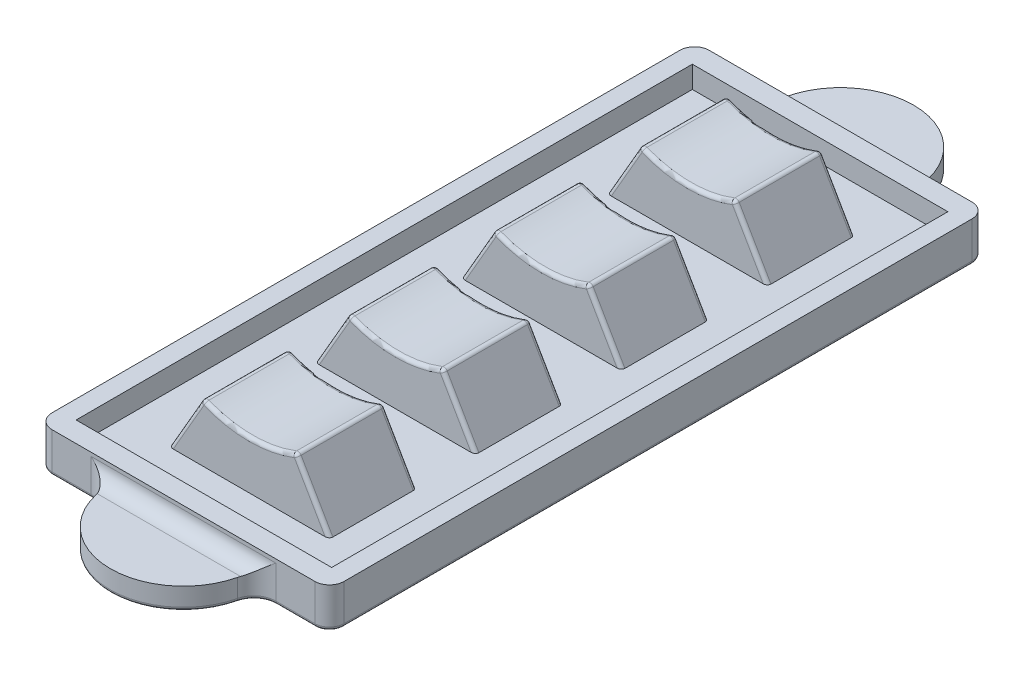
ISO-10303-21;
HEADER;
FILE_DESCRIPTION(('STEP AP214'),'2;1');
FILE_NAME('part.step','',(''),(''),'','','');
FILE_SCHEMA(('AUTOMOTIVE_DESIGN { 1 0 10303 214 1 1 1 1 }'));
ENDSEC;
DATA;
#1=APPLICATION_CONTEXT('core data for automotive mechanical design processes');
#2=APPLICATION_PROTOCOL_DEFINITION('international standard','automotive_design',2000,#1);
#3=PRODUCT_CONTEXT('',#1,'mechanical');
#4=PRODUCT('Part','Part','',(#3));
#5=PRODUCT_RELATED_PRODUCT_CATEGORY('part','',(#4));
#6=PRODUCT_DEFINITION_FORMATION('','',#4);
#7=PRODUCT_DEFINITION_CONTEXT('part definition',#1,'design');
#8=PRODUCT_DEFINITION('design','',#6,#7);
#9=PRODUCT_DEFINITION_SHAPE('','',#8);
#10=(LENGTH_UNIT() NAMED_UNIT(*) SI_UNIT(.MILLI.,.METRE.));
#11=(NAMED_UNIT(*) PLANE_ANGLE_UNIT() SI_UNIT($,.RADIAN.));
#12=(NAMED_UNIT(*) SI_UNIT($,.STERADIAN.) SOLID_ANGLE_UNIT());
#13=UNCERTAINTY_MEASURE_WITH_UNIT(LENGTH_MEASURE(1.E-05),#10,'distance_accuracy_value','');
#14=(GEOMETRIC_REPRESENTATION_CONTEXT(3) GLOBAL_UNCERTAINTY_ASSIGNED_CONTEXT((#13)) GLOBAL_UNIT_ASSIGNED_CONTEXT((#10,
#11,#12)) REPRESENTATION_CONTEXT('',''));
#15=CARTESIAN_POINT('',(0.,0.,0.));
#16=DIRECTION('',(0.,0.,1.));
#17=DIRECTION('',(1.,0.,0.));
#18=AXIS2_PLACEMENT_3D('',#15,#16,#17);
#19=CARTESIAN_POINT('',(0.,0.,6.));
#20=DIRECTION('',(0.,0.,-1.));
#21=DIRECTION('',(-1.,0.,0.));
#22=AXIS2_PLACEMENT_3D('',#19,#20,#21);
#23=CYLINDRICAL_SURFACE('',#22,16.4);
#24=CARTESIAN_POINT('',(0.,0.,5.5));
#25=DIRECTION('',(0.,0.,1.));
#26=DIRECTION('',(1.,0.,0.));
#27=AXIS2_PLACEMENT_3D('',#24,#25,#26);
#28=CIRCLE('',#27,16.4);
#29=CARTESIAN_POINT('',(-6.0087750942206,-15.2595747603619,5.5));
#30=VERTEX_POINT('',#29);
#31=CARTESIAN_POINT('',(6.00877509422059,-15.2595747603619,5.5));
#32=VERTEX_POINT('',#31);
#33=EDGE_CURVE('E821',#30,#32,#28,.T.);
#34=ORIENTED_EDGE('',*,*,#33,.T.);
#35=DIRECTION('',(0.,0.,-1.));
#36=VECTOR('',#35,1.);
#37=CARTESIAN_POINT('',(6.00877509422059,-15.2595747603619,6.));
#38=LINE('',#37,#36);
#39=CARTESIAN_POINT('',(6.00877509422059,-15.2595747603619,-5.5));
#40=VERTEX_POINT('',#39);
#41=EDGE_CURVE('E823',#32,#40,#38,.T.);
#42=ORIENTED_EDGE('',*,*,#41,.T.);
#43=CARTESIAN_POINT('',(0.,0.,-5.5));
#44=DIRECTION('',(0.,0.,1.));
#45=DIRECTION('',(1.,0.,0.));
#46=AXIS2_PLACEMENT_3D('',#43,#44,#45);
#47=CIRCLE('',#46,16.4);
#48=CARTESIAN_POINT('',(-6.0087750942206,-15.2595747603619,-5.5));
#49=VERTEX_POINT('',#48);
#50=EDGE_CURVE('E817',#40,#49,#47,.F.);
#51=ORIENTED_EDGE('',*,*,#50,.T.);
#52=DIRECTION('',(0.,0.,-1.));
#53=VECTOR('',#52,1.);
#54=CARTESIAN_POINT('',(-6.0087750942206,-15.2595747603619,6.));
#55=LINE('',#54,#53);
#56=EDGE_CURVE('E819',#49,#30,#55,.F.);
#57=ORIENTED_EDGE('',*,*,#56,.T.);
#58=EDGE_LOOP('',(#34,#42,#51,#57));
#59=FACE_BOUND('',#58,.T.);
#60=ADVANCED_FACE('F39',(#59),#23,.F.);
#61=CARTESIAN_POINT('',(1.73205080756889,-0.99999999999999,6.));
#62=DIRECTION('',(0.866025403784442,-0.499999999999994,0.));
#63=DIRECTION('',(0.499999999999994,0.866025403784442,0.));
#64=AXIS2_PLACEMENT_3D('',#61,#62,#63);
#65=PLANE('',#64);
#66=DIRECTION('',(0.,0.,1.));
#67=VECTOR('',#66,1.);
#68=CARTESIAN_POINT('',(-6.62498215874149,-15.4748056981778,-6.));
#69=LINE('',#68,#67);
#70=CARTESIAN_POINT('',(-6.62498215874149,-15.4748056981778,5.5));
#71=VERTEX_POINT('',#70);
#72=CARTESIAN_POINT('',(-6.62498215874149,-15.4748056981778,-5.5));
#73=VERTEX_POINT('',#72);
#74=EDGE_CURVE('E841',#71,#73,#69,.F.);
#75=ORIENTED_EDGE('',*,*,#74,.T.);
#76=DIRECTION('',(-0.499999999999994,-0.866025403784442,0.));
#77=VECTOR('',#76,1.);
#78=CARTESIAN_POINT('',(1.73205080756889,-0.99999999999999,-5.5));
#79=LINE('',#78,#77);
#80=CARTESIAN_POINT('',(-10.9696551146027,-23.,-5.5));
#81=VERTEX_POINT('',#80);
#82=EDGE_CURVE('E843',#73,#81,#79,.T.);
#83=ORIENTED_EDGE('',*,*,#82,.T.);
#84=DIRECTION('',(0.,0.,-1.));
#85=VECTOR('',#84,1.);
#86=CARTESIAN_POINT('',(-10.9696551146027,-23.,6.));
#87=LINE('',#86,#85);
#88=CARTESIAN_POINT('',(-10.9696551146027,-23.,5.5));
#89=VERTEX_POINT('',#88);
#90=EDGE_CURVE('E814',#89,#81,#87,.T.);
#91=ORIENTED_EDGE('',*,*,#90,.F.);
#92=DIRECTION('',(-0.499999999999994,-0.866025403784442,0.));
#93=VECTOR('',#92,1.);
#94=CARTESIAN_POINT('',(-6.40674517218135,-15.0968081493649,5.5));
#95=LINE('',#94,#93);
#96=EDGE_CURVE('E839',#89,#71,#95,.F.);
#97=ORIENTED_EDGE('',*,*,#96,.T.);
#98=EDGE_LOOP('',(#75,#83,#91,#97));
#99=FACE_BOUND('',#98,.T.);
#100=ADVANCED_FACE('F1002',(#99),#65,.F.);
#101=CARTESIAN_POINT('',(-1.73205080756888,-0.999999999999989,6.));
#102=DIRECTION('',(-0.866025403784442,-0.499999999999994,0.));
#103=DIRECTION('',(0.499999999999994,-0.866025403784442,0.));
#104=AXIS2_PLACEMENT_3D('',#101,#102,#103);
#105=PLANE('',#104);
#106=DIRECTION('',(0.,0.,-1.));
#107=VECTOR('',#106,1.);
#108=CARTESIAN_POINT('',(10.9696551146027,-23.,6.));
#109=LINE('',#108,#107);
#110=CARTESIAN_POINT('',(10.9696551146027,-23.,5.5));
#111=VERTEX_POINT('',#110);
#112=CARTESIAN_POINT('',(10.9696551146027,-23.,-5.5));
#113=VERTEX_POINT('',#112);
#114=EDGE_CURVE('E808',#111,#113,#109,.T.);
#115=ORIENTED_EDGE('',*,*,#114,.T.);
#116=DIRECTION('',(-0.499999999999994,0.866025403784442,0.));
#117=VECTOR('',#116,1.);
#118=CARTESIAN_POINT('',(-1.73205080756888,-0.999999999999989,-5.5));
#119=LINE('',#118,#117);
#120=CARTESIAN_POINT('',(6.62498215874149,-15.4748056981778,-5.5));
#121=VERTEX_POINT('',#120);
#122=EDGE_CURVE('E831',#113,#121,#119,.T.);
#123=ORIENTED_EDGE('',*,*,#122,.T.);
#124=DIRECTION('',(0.,0.,1.));
#125=VECTOR('',#124,1.);
#126=CARTESIAN_POINT('',(6.62498215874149,-15.4748056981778,6.));
#127=LINE('',#126,#125);
#128=CARTESIAN_POINT('',(6.62498215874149,-15.4748056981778,5.5));
#129=VERTEX_POINT('',#128);
#130=EDGE_CURVE('E828',#121,#129,#127,.T.);
#131=ORIENTED_EDGE('',*,*,#130,.T.);
#132=DIRECTION('',(-0.499999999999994,0.866025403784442,0.));
#133=VECTOR('',#132,1.);
#134=CARTESIAN_POINT('',(10.9696551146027,-23.,5.5));
#135=LINE('',#134,#133);
#136=EDGE_CURVE('E826',#129,#111,#135,.F.);
#137=ORIENTED_EDGE('',*,*,#136,.T.);
#138=EDGE_LOOP('',(#115,#123,#131,#137));
#139=FACE_BOUND('',#138,.T.);
#140=ADVANCED_FACE('F1008',(#139),#105,.F.);
#141=CARTESIAN_POINT('',(0.,0.,6.));
#142=DIRECTION('',(0.,0.,1.));
#143=DIRECTION('',(1.,0.,0.));
#144=AXIS2_PLACEMENT_3D('',#141,#142,#143);
#145=PLANE('',#144);
#146=CARTESIAN_POINT('',(0.,0.,6.));
#147=DIRECTION('',(0.,0.,1.));
#148=DIRECTION('',(1.,0.,0.));
#149=AXIS2_PLACEMENT_3D('',#146,#147,#148);
#150=CIRCLE('',#149,16.9);
#151=CARTESIAN_POINT('',(6.19196945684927,-15.7248056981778,6.));
#152=VERTEX_POINT('',#151);
#153=CARTESIAN_POINT('',(-6.19196945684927,-15.7248056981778,6.));
#154=VERTEX_POINT('',#153);
#155=EDGE_CURVE('E835',#152,#154,#150,.F.);
#156=ORIENTED_EDGE('',*,*,#155,.T.);
#157=DIRECTION('',(-0.499999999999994,-0.866025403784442,0.));
#158=VECTOR('',#157,1.);
#159=CARTESIAN_POINT('',(-10.5366424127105,-23.25,6.));
#160=LINE('',#159,#158);
#161=CARTESIAN_POINT('',(-10.3923048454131,-23.,6.));
#162=VERTEX_POINT('',#161);
#163=EDGE_CURVE('E837',#154,#162,#160,.T.);
#164=ORIENTED_EDGE('',*,*,#163,.T.);
#165=DIRECTION('',(1.,0.,0.));
#166=VECTOR('',#165,1.);
#167=CARTESIAN_POINT('',(0.,-23.,6.));
#168=LINE('',#167,#166);
#169=CARTESIAN_POINT('',(10.3923048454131,-23.,6.));
#170=VERTEX_POINT('',#169);
#171=EDGE_CURVE('E806',#162,#170,#168,.T.);
#172=ORIENTED_EDGE('',*,*,#171,.T.);
#173=DIRECTION('',(-0.499999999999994,0.866025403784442,0.));
#174=VECTOR('',#173,1.);
#175=CARTESIAN_POINT('',(5.97373247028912,-15.3468081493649,6.));
#176=LINE('',#175,#174);
#177=EDGE_CURVE('E833',#170,#152,#176,.T.);
#178=ORIENTED_EDGE('',*,*,#177,.T.);
#179=EDGE_LOOP('',(#156,#164,#172,#178));
#180=FACE_BOUND('',#179,.T.);
#181=ADVANCED_FACE('F1064',(#180),#145,.T.);
#182=CARTESIAN_POINT('',(0.,0.,-6.));
#183=DIRECTION('',(0.,0.,1.));
#184=DIRECTION('',(1.,0.,0.));
#185=AXIS2_PLACEMENT_3D('',#182,#183,#184);
#186=PLANE('',#185);
#187=DIRECTION('',(1.,0.,0.));
#188=VECTOR('',#187,1.);
#189=CARTESIAN_POINT('',(0.,-23.,-6.));
#190=LINE('',#189,#188);
#191=CARTESIAN_POINT('',(-10.3923048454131,-23.,-6.));
#192=VERTEX_POINT('',#191);
#193=CARTESIAN_POINT('',(10.3923048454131,-23.,-6.));
#194=VERTEX_POINT('',#193);
#195=EDGE_CURVE('E809',#192,#194,#190,.T.);
#196=ORIENTED_EDGE('',*,*,#195,.F.);
#197=DIRECTION('',(-0.499999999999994,-0.866025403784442,0.));
#198=VECTOR('',#197,1.);
#199=CARTESIAN_POINT('',(2.16506350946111,-1.24999999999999,-6.));
#200=LINE('',#199,#198);
#201=CARTESIAN_POINT('',(-6.19196945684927,-15.7248056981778,-6.));
#202=VERTEX_POINT('',#201);
#203=EDGE_CURVE('E849',#192,#202,#200,.F.);
#204=ORIENTED_EDGE('',*,*,#203,.T.);
#205=CARTESIAN_POINT('',(0.,0.,-6.));
#206=DIRECTION('',(0.,0.,1.));
#207=DIRECTION('',(1.,0.,0.));
#208=AXIS2_PLACEMENT_3D('',#205,#206,#207);
#209=CIRCLE('',#208,16.9);
#210=CARTESIAN_POINT('',(6.19196945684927,-15.7248056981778,-6.));
#211=VERTEX_POINT('',#210);
#212=EDGE_CURVE('E847',#202,#211,#209,.T.);
#213=ORIENTED_EDGE('',*,*,#212,.T.);
#214=DIRECTION('',(-0.499999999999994,0.866025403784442,0.));
#215=VECTOR('',#214,1.);
#216=CARTESIAN_POINT('',(-2.16506350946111,-1.24999999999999,-6.));
#217=LINE('',#216,#215);
#218=EDGE_CURVE('E845',#211,#194,#217,.F.);
#219=ORIENTED_EDGE('',*,*,#218,.T.);
#220=EDGE_LOOP('',(#196,#204,#213,#219));
#221=FACE_BOUND('',#220,.T.);
#222=ADVANCED_FACE('F1059',(#221),#186,.F.);
#223=CARTESIAN_POINT('',(2.16506350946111,-1.24999999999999,5.5));
#224=DIRECTION('',(0.499999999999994,0.866025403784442,0.));
#225=DIRECTION('',(-0.866025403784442,0.499999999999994,0.));
#226=AXIS2_PLACEMENT_3D('',#223,#224,#225);
#227=CYLINDRICAL_SURFACE('',#226,0.5);
#228=CARTESIAN_POINT('',(-10.3923048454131,-23.,5.5));
#229=DIRECTION('',(0.,1.,0.));
#230=DIRECTION('',(1.,0.,0.));
#231=AXIS2_PLACEMENT_3D('',#228,#229,#230);
#232=ELLIPSE('',#231,0.577350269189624,0.5);
#233=EDGE_CURVE('E854',#162,#89,#232,.F.);
#234=ORIENTED_EDGE('',*,*,#233,.F.);
#235=ORIENTED_EDGE('',*,*,#163,.F.);
#236=CARTESIAN_POINT('',(-6.19196945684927,-15.7248056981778,5.5));
#237=DIRECTION('',(0.499999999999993,0.866025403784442,0.));
#238=DIRECTION('',(-0.866025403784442,0.499999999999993,0.));
#239=AXIS2_PLACEMENT_3D('',#236,#237,#238);
#240=CIRCLE('',#239,0.5);
#241=EDGE_CURVE('E812',#71,#154,#240,.T.);
#242=ORIENTED_EDGE('',*,*,#241,.F.);
#243=ORIENTED_EDGE('',*,*,#96,.F.);
#244=EDGE_LOOP('',(#234,#235,#242,#243));
#245=FACE_BOUND('',#244,.T.);
#246=ADVANCED_FACE('F1056',(#245),#227,.T.);
#247=CARTESIAN_POINT('',(-6.19196945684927,-15.7248056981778,6.));
#248=DIRECTION('',(0.,0.,-1.));
#249=DIRECTION('',(-1.,0.,0.));
#250=AXIS2_PLACEMENT_3D('',#247,#248,#249);
#251=CYLINDRICAL_SURFACE('',#250,0.5);
#252=CARTESIAN_POINT('',(-6.19196945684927,-15.7248056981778,-5.5));
#253=DIRECTION('',(0.,0.,-1.));
#254=DIRECTION('',(-1.,0.,0.));
#255=AXIS2_PLACEMENT_3D('',#252,#253,#254);
#256=CIRCLE('',#255,0.5);
#257=EDGE_CURVE('E888',#73,#49,#256,.T.);
#258=ORIENTED_EDGE('',*,*,#257,.F.);
#259=ORIENTED_EDGE('',*,*,#74,.F.);
#260=CARTESIAN_POINT('',(-6.19196945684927,-15.7248056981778,5.5));
#261=DIRECTION('',(0.,0.,1.));
#262=DIRECTION('',(1.,0.,0.));
#263=AXIS2_PLACEMENT_3D('',#260,#261,#262);
#264=CIRCLE('',#263,0.5);
#265=EDGE_CURVE('E891',#30,#71,#264,.T.);
#266=ORIENTED_EDGE('',*,*,#265,.F.);
#267=ORIENTED_EDGE('',*,*,#56,.F.);
#268=EDGE_LOOP('',(#258,#259,#266,#267));
#269=FACE_BOUND('',#268,.T.);
#270=ADVANCED_FACE('F1053',(#269),#251,.T.);
#271=CARTESIAN_POINT('',(2.16506350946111,-1.24999999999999,-5.5));
#272=DIRECTION('',(-0.499999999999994,-0.866025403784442,0.));
#273=DIRECTION('',(0.866025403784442,-0.499999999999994,0.));
#274=AXIS2_PLACEMENT_3D('',#271,#272,#273);
#275=CYLINDRICAL_SURFACE('',#274,0.5);
#276=CARTESIAN_POINT('',(-10.3923048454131,-23.,-5.5));
#277=DIRECTION('',(0.,1.,0.));
#278=DIRECTION('',(-1.,0.,0.));
#279=AXIS2_PLACEMENT_3D('',#276,#277,#278);
#280=ELLIPSE('',#279,0.577350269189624,0.5);
#281=EDGE_CURVE('E860',#81,#192,#280,.F.);
#282=ORIENTED_EDGE('',*,*,#281,.F.);
#283=ORIENTED_EDGE('',*,*,#82,.F.);
#284=CARTESIAN_POINT('',(-6.19196945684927,-15.7248056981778,-5.5));
#285=DIRECTION('',(0.500000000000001,0.866025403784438,0.));
#286=DIRECTION('',(-0.866025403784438,0.500000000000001,0.));
#287=AXIS2_PLACEMENT_3D('',#284,#285,#286);
#288=CIRCLE('',#287,0.5);
#289=EDGE_CURVE('E885',#202,#73,#288,.T.);
#290=ORIENTED_EDGE('',*,*,#289,.F.);
#291=ORIENTED_EDGE('',*,*,#203,.F.);
#292=EDGE_LOOP('',(#282,#283,#290,#291));
#293=FACE_BOUND('',#292,.T.);
#294=ADVANCED_FACE('F1049',(#293),#275,.T.);
#295=CARTESIAN_POINT('',(-6.19196945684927,-15.7248056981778,5.5));
#296=DIRECTION('',(0.,0.,1.));
#297=DIRECTION('',(1.,0.,0.));
#298=AXIS2_PLACEMENT_3D('',#295,#296,#297);
#299=SPHERICAL_SURFACE('',#298,0.5);
#300=ORIENTED_EDGE('',*,*,#265,.T.);
#301=ORIENTED_EDGE('',*,*,#241,.T.);
#302=CARTESIAN_POINT('',(-6.19196945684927,-15.7248056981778,5.5));
#303=DIRECTION('',(-0.930461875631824,0.366388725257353,0.));
#304=DIRECTION('',(-0.366388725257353,-0.930461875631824,0.));
#305=AXIS2_PLACEMENT_3D('',#302,#303,#304);
#306=CIRCLE('',#305,0.5);
#307=EDGE_CURVE('E882',#30,#154,#306,.F.);
#308=ORIENTED_EDGE('',*,*,#307,.F.);
#309=EDGE_LOOP('',(#300,#301,#308));
#310=FACE_BOUND('',#309,.T.);
#311=ADVANCED_FACE('F1045',(#310),#299,.T.);
#312=CARTESIAN_POINT('',(-6.19196945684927,-15.7248056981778,-5.5));
#313=DIRECTION('',(0.,0.,-1.));
#314=DIRECTION('',(-1.,0.,0.));
#315=AXIS2_PLACEMENT_3D('',#312,#313,#314);
#316=SPHERICAL_SURFACE('',#315,0.5);
#317=ORIENTED_EDGE('',*,*,#289,.T.);
#318=ORIENTED_EDGE('',*,*,#257,.T.);
#319=CARTESIAN_POINT('',(-6.19196945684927,-15.7248056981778,-5.5));
#320=DIRECTION('',(-0.930461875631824,0.366388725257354,0.));
#321=DIRECTION('',(-0.366388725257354,-0.930461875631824,0.));
#322=AXIS2_PLACEMENT_3D('',#319,#320,#321);
#323=CIRCLE('',#322,0.5);
#324=EDGE_CURVE('E879',#202,#49,#323,.F.);
#325=ORIENTED_EDGE('',*,*,#324,.F.);
#326=EDGE_LOOP('',(#317,#318,#325));
#327=FACE_BOUND('',#326,.T.);
#328=ADVANCED_FACE('F1041',(#327),#316,.T.);
#329=CARTESIAN_POINT('',(-2.1650635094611,-1.24999999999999,5.5));
#330=DIRECTION('',(0.499999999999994,-0.866025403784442,0.));
#331=DIRECTION('',(0.866025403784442,0.499999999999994,0.));
#332=AXIS2_PLACEMENT_3D('',#329,#330,#331);
#333=CYLINDRICAL_SURFACE('',#332,0.5);
#334=CARTESIAN_POINT('',(10.3923048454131,-23.,5.5));
#335=DIRECTION('',(0.,1.,0.));
#336=DIRECTION('',(1.,0.,0.));
#337=AXIS2_PLACEMENT_3D('',#334,#335,#336);
#338=ELLIPSE('',#337,0.577350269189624,0.5);
#339=EDGE_CURVE('E851',#111,#170,#338,.F.);
#340=ORIENTED_EDGE('',*,*,#339,.F.);
#341=ORIENTED_EDGE('',*,*,#136,.F.);
#342=CARTESIAN_POINT('',(6.19196945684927,-15.7248056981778,5.5));
#343=DIRECTION('',(-0.499999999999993,0.866025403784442,0.));
#344=DIRECTION('',(-0.866025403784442,-0.499999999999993,0.));
#345=AXIS2_PLACEMENT_3D('',#342,#343,#344);
#346=CIRCLE('',#345,0.5);
#347=EDGE_CURVE('E876',#152,#129,#346,.T.);
#348=ORIENTED_EDGE('',*,*,#347,.F.);
#349=ORIENTED_EDGE('',*,*,#177,.F.);
#350=EDGE_LOOP('',(#340,#341,#348,#349));
#351=FACE_BOUND('',#350,.T.);
#352=ADVANCED_FACE('F1037',(#351),#333,.T.);
#353=CARTESIAN_POINT('',(0.,0.,5.5));
#354=DIRECTION('',(0.,0.,1.));
#355=DIRECTION('',(1.,0.,0.));
#356=AXIS2_PLACEMENT_3D('',#353,#354,#355);
#357=TOROIDAL_SURFACE('',#356,16.9,0.5);
#358=ORIENTED_EDGE('',*,*,#307,.T.);
#359=ORIENTED_EDGE('',*,*,#155,.F.);
#360=CARTESIAN_POINT('',(6.19196945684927,-15.7248056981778,5.5));
#361=DIRECTION('',(0.930461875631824,0.366388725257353,0.));
#362=DIRECTION('',(-0.366388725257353,0.930461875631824,0.));
#363=AXIS2_PLACEMENT_3D('',#360,#361,#362);
#364=CIRCLE('',#363,0.5);
#365=EDGE_CURVE('E873',#32,#152,#364,.T.);
#366=ORIENTED_EDGE('',*,*,#365,.F.);
#367=ORIENTED_EDGE('',*,*,#33,.F.);
#368=EDGE_LOOP('',(#358,#359,#366,#367));
#369=FACE_BOUND('',#368,.T.);
#370=ADVANCED_FACE('F1033',(#369),#357,.T.);
#371=CARTESIAN_POINT('',(0.,0.,-5.5));
#372=DIRECTION('',(0.,0.,1.));
#373=DIRECTION('',(1.,0.,0.));
#374=AXIS2_PLACEMENT_3D('',#371,#372,#373);
#375=TOROIDAL_SURFACE('',#374,16.9,0.5);
#376=ORIENTED_EDGE('',*,*,#324,.T.);
#377=ORIENTED_EDGE('',*,*,#50,.F.);
#378=CARTESIAN_POINT('',(6.19196945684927,-15.7248056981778,-5.5));
#379=DIRECTION('',(0.930461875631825,0.36638872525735,0.));
#380=DIRECTION('',(-0.36638872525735,0.930461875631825,0.));
#381=AXIS2_PLACEMENT_3D('',#378,#379,#380);
#382=CIRCLE('',#381,0.5);
#383=EDGE_CURVE('E870',#211,#40,#382,.T.);
#384=ORIENTED_EDGE('',*,*,#383,.F.);
#385=ORIENTED_EDGE('',*,*,#212,.F.);
#386=EDGE_LOOP('',(#376,#377,#384,#385));
#387=FACE_BOUND('',#386,.T.);
#388=ADVANCED_FACE('F1029',(#387),#375,.T.);
#389=CARTESIAN_POINT('',(-2.1650635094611,-1.24999999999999,-5.5));
#390=DIRECTION('',(-0.499999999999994,0.866025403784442,0.));
#391=DIRECTION('',(-0.866025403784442,-0.499999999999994,0.));
#392=AXIS2_PLACEMENT_3D('',#389,#390,#391);
#393=CYLINDRICAL_SURFACE('',#392,0.5);
#394=CARTESIAN_POINT('',(10.3923048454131,-23.,-5.5));
#395=DIRECTION('',(0.,1.,0.));
#396=DIRECTION('',(-1.,0.,0.));
#397=AXIS2_PLACEMENT_3D('',#394,#395,#396);
#398=ELLIPSE('',#397,0.577350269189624,0.5);
#399=EDGE_CURVE('E857',#194,#113,#398,.F.);
#400=ORIENTED_EDGE('',*,*,#399,.F.);
#401=ORIENTED_EDGE('',*,*,#218,.F.);
#402=CARTESIAN_POINT('',(6.19196945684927,-15.7248056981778,-5.5));
#403=DIRECTION('',(-0.499999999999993,0.866025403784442,0.));
#404=DIRECTION('',(-0.866025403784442,-0.499999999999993,0.));
#405=AXIS2_PLACEMENT_3D('',#402,#403,#404);
#406=CIRCLE('',#405,0.5);
#407=EDGE_CURVE('E867',#121,#211,#406,.T.);
#408=ORIENTED_EDGE('',*,*,#407,.F.);
#409=ORIENTED_EDGE('',*,*,#122,.F.);
#410=EDGE_LOOP('',(#400,#401,#408,#409));
#411=FACE_BOUND('',#410,.T.);
#412=ADVANCED_FACE('F1025',(#411),#393,.T.);
#413=CARTESIAN_POINT('',(6.19196945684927,-15.7248056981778,5.5));
#414=DIRECTION('',(0.,0.,1.));
#415=DIRECTION('',(1.,0.,0.));
#416=AXIS2_PLACEMENT_3D('',#413,#414,#415);
#417=SPHERICAL_SURFACE('',#416,0.5);
#418=ORIENTED_EDGE('',*,*,#365,.T.);
#419=ORIENTED_EDGE('',*,*,#347,.T.);
#420=CARTESIAN_POINT('',(6.19196945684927,-15.7248056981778,5.5));
#421=DIRECTION('',(0.,0.,1.));
#422=DIRECTION('',(1.,0.,0.));
#423=AXIS2_PLACEMENT_3D('',#420,#421,#422);
#424=CIRCLE('',#423,0.5);
#425=EDGE_CURVE('E865',#32,#129,#424,.F.);
#426=ORIENTED_EDGE('',*,*,#425,.F.);
#427=EDGE_LOOP('',(#418,#419,#426));
#428=FACE_BOUND('',#427,.T.);
#429=ADVANCED_FACE('F1021',(#428),#417,.T.);
#430=CARTESIAN_POINT('',(6.19196945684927,-15.7248056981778,-5.5));
#431=DIRECTION('',(0.,0.,-1.));
#432=DIRECTION('',(-1.,0.,0.));
#433=AXIS2_PLACEMENT_3D('',#430,#431,#432);
#434=SPHERICAL_SURFACE('',#433,0.5);
#435=ORIENTED_EDGE('',*,*,#407,.T.);
#436=ORIENTED_EDGE('',*,*,#383,.T.);
#437=CARTESIAN_POINT('',(6.19196945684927,-15.7248056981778,-5.5));
#438=DIRECTION('',(0.,0.,-1.));
#439=DIRECTION('',(-1.,0.,0.));
#440=AXIS2_PLACEMENT_3D('',#437,#438,#439);
#441=CIRCLE('',#440,0.5);
#442=EDGE_CURVE('E773',#121,#40,#441,.F.);
#443=ORIENTED_EDGE('',*,*,#442,.F.);
#444=EDGE_LOOP('',(#435,#436,#443));
#445=FACE_BOUND('',#444,.T.);
#446=ADVANCED_FACE('F1017',(#445),#434,.T.);
#447=CARTESIAN_POINT('',(6.19196945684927,-15.7248056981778,6.));
#448=DIRECTION('',(0.,0.,-1.));
#449=DIRECTION('',(-1.,0.,0.));
#450=AXIS2_PLACEMENT_3D('',#447,#448,#449);
#451=CYLINDRICAL_SURFACE('',#450,0.5);
#452=ORIENTED_EDGE('',*,*,#425,.T.);
#453=ORIENTED_EDGE('',*,*,#130,.F.);
#454=ORIENTED_EDGE('',*,*,#442,.T.);
#455=ORIENTED_EDGE('',*,*,#41,.F.);
#456=EDGE_LOOP('',(#452,#453,#454,#455));
#457=FACE_BOUND('',#456,.T.);
#458=ADVANCED_FACE('F1013',(#457),#451,.T.);
#459=CARTESIAN_POINT('',(0.,-23.,0.));
#460=DIRECTION('',(0.,1.,0.));
#461=DIRECTION('',(0.,0.,1.));
#462=AXIS2_PLACEMENT_3D('',#459,#460,#461);
#463=PLANE('',#462);
#464=DIRECTION('',(0.,0.,-1.));
#465=VECTOR('',#464,1.);
#466=CARTESIAN_POINT('',(17.5,-23.,0.));
#467=LINE('',#466,#465);
#468=CARTESIAN_POINT('',(17.5,-23.,12.2));
#469=VERTEX_POINT('',#468);
#470=CARTESIAN_POINT('',(17.5,-23.,-72.2));
#471=VERTEX_POINT('',#470);
#472=EDGE_CURVE('E484',#469,#471,#467,.T.);
#473=ORIENTED_EDGE('',*,*,#472,.T.);
#474=DIRECTION('',(1.,0.,0.));
#475=VECTOR('',#474,1.);
#476=CARTESIAN_POINT('',(0.,-23.,-72.2));
#477=LINE('',#476,#475);
#478=CARTESIAN_POINT('',(-17.5,-23.,-72.2));
#479=VERTEX_POINT('',#478);
#480=EDGE_CURVE('E500',#479,#471,#477,.T.);
#481=ORIENTED_EDGE('',*,*,#480,.F.);
#482=DIRECTION('',(0.,0.,-1.));
#483=VECTOR('',#482,1.);
#484=CARTESIAN_POINT('',(-17.5,-23.,0.));
#485=LINE('',#484,#483);
#486=CARTESIAN_POINT('',(-17.5,-23.,12.2));
#487=VERTEX_POINT('',#486);
#488=EDGE_CURVE('E527',#487,#479,#485,.T.);
#489=ORIENTED_EDGE('',*,*,#488,.F.);
#490=DIRECTION('',(1.,0.,0.));
#491=VECTOR('',#490,1.);
#492=CARTESIAN_POINT('',(0.,-23.,12.2));
#493=LINE('',#492,#491);
#494=EDGE_CURVE('E524',#487,#469,#493,.T.);
#495=ORIENTED_EDGE('',*,*,#494,.T.);
#496=EDGE_LOOP('',(#473,#481,#489,#495));
#497=FACE_BOUND('',#496,.T.);
#498=ORIENTED_EDGE('',*,*,#233,.T.);
#499=ORIENTED_EDGE('',*,*,#90,.T.);
#500=ORIENTED_EDGE('',*,*,#281,.T.);
#501=ORIENTED_EDGE('',*,*,#195,.T.);
#502=ORIENTED_EDGE('',*,*,#399,.T.);
#503=ORIENTED_EDGE('',*,*,#114,.F.);
#504=ORIENTED_EDGE('',*,*,#339,.T.);
#505=ORIENTED_EDGE('',*,*,#171,.F.);
#506=EDGE_LOOP('',(#498,#499,#500,#501,#502,#503,#504,#505));
#507=FACE_BOUND('',#506,.T.);
#508=CARTESIAN_POINT('',(-10.3923048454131,-23.,-14.5));
#509=DIRECTION('',(0.,1.,0.));
#510=DIRECTION('',(1.,0.,0.));
#511=AXIS2_PLACEMENT_3D('',#508,#509,#510);
#512=ELLIPSE('',#511,0.577350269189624,0.5);
#513=CARTESIAN_POINT('',(-10.3923048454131,-23.,-14.));
#514=VERTEX_POINT('',#513);
#515=CARTESIAN_POINT('',(-10.9696551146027,-23.,-14.5));
#516=VERTEX_POINT('',#515);
#517=EDGE_CURVE('E764',#514,#516,#512,.F.);
#518=ORIENTED_EDGE('',*,*,#517,.T.);
#519=DIRECTION('',(0.,0.,-1.));
#520=VECTOR('',#519,1.);
#521=CARTESIAN_POINT('',(-10.9696551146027,-23.,-14.));
#522=LINE('',#521,#520);
#523=CARTESIAN_POINT('',(-10.9696551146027,-23.,-25.5));
#524=VERTEX_POINT('',#523);
#525=EDGE_CURVE('E724',#516,#524,#522,.T.);
#526=ORIENTED_EDGE('',*,*,#525,.T.);
#527=CARTESIAN_POINT('',(-10.3923048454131,-23.,-25.5));
#528=DIRECTION('',(0.,1.,0.));
#529=DIRECTION('',(-1.,0.,0.));
#530=AXIS2_PLACEMENT_3D('',#527,#528,#529);
#531=ELLIPSE('',#530,0.577350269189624,0.5);
#532=CARTESIAN_POINT('',(-10.3923048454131,-23.,-26.));
#533=VERTEX_POINT('',#532);
#534=EDGE_CURVE('E770',#524,#533,#531,.F.);
#535=ORIENTED_EDGE('',*,*,#534,.T.);
#536=DIRECTION('',(1.,0.,0.));
#537=VECTOR('',#536,1.);
#538=CARTESIAN_POINT('',(0.,-23.,-26.));
#539=LINE('',#538,#537);
#540=CARTESIAN_POINT('',(10.3923048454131,-23.,-26.));
#541=VERTEX_POINT('',#540);
#542=EDGE_CURVE('E719',#533,#541,#539,.T.);
#543=ORIENTED_EDGE('',*,*,#542,.T.);
#544=CARTESIAN_POINT('',(10.3923048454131,-23.,-25.5));
#545=DIRECTION('',(0.,1.,0.));
#546=DIRECTION('',(-1.,0.,0.));
#547=AXIS2_PLACEMENT_3D('',#544,#545,#546);
#548=ELLIPSE('',#547,0.577350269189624,0.5);
#549=CARTESIAN_POINT('',(10.9696551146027,-23.,-25.5));
#550=VERTEX_POINT('',#549);
#551=EDGE_CURVE('E767',#541,#550,#548,.F.);
#552=ORIENTED_EDGE('',*,*,#551,.T.);
#553=DIRECTION('',(0.,0.,-1.));
#554=VECTOR('',#553,1.);
#555=CARTESIAN_POINT('',(10.9696551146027,-23.,-14.));
#556=LINE('',#555,#554);
#557=CARTESIAN_POINT('',(10.9696551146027,-23.,-14.5));
#558=VERTEX_POINT('',#557);
#559=EDGE_CURVE('E718',#558,#550,#556,.T.);
#560=ORIENTED_EDGE('',*,*,#559,.F.);
#561=CARTESIAN_POINT('',(10.3923048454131,-23.,-14.5));
#562=DIRECTION('',(0.,1.,0.));
#563=DIRECTION('',(1.,0.,0.));
#564=AXIS2_PLACEMENT_3D('',#561,#562,#563);
#565=ELLIPSE('',#564,0.577350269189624,0.5);
#566=CARTESIAN_POINT('',(10.3923048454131,-23.,-14.));
#567=VERTEX_POINT('',#566);
#568=EDGE_CURVE('E761',#558,#567,#565,.F.);
#569=ORIENTED_EDGE('',*,*,#568,.T.);
#570=DIRECTION('',(1.,0.,0.));
#571=VECTOR('',#570,1.);
#572=CARTESIAN_POINT('',(0.,-23.,-14.));
#573=LINE('',#572,#571);
#574=EDGE_CURVE('E716',#514,#567,#573,.T.);
#575=ORIENTED_EDGE('',*,*,#574,.F.);
#576=EDGE_LOOP('',(#518,#526,#535,#543,#552,#560,#569,#575));
#577=FACE_BOUND('',#576,.T.);
#578=CARTESIAN_POINT('',(-10.3923048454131,-23.,-34.5));
#579=DIRECTION('',(0.,1.,0.));
#580=DIRECTION('',(1.,0.,0.));
#581=AXIS2_PLACEMENT_3D('',#578,#579,#580);
#582=ELLIPSE('',#581,0.577350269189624,0.5);
#583=CARTESIAN_POINT('',(-10.3923048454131,-23.,-34.));
#584=VERTEX_POINT('',#583);
#585=CARTESIAN_POINT('',(-10.9696551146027,-23.,-34.5));
#586=VERTEX_POINT('',#585);
#587=EDGE_CURVE('E674',#584,#586,#582,.F.);
#588=ORIENTED_EDGE('',*,*,#587,.T.);
#589=DIRECTION('',(0.,0.,-1.));
#590=VECTOR('',#589,1.);
#591=CARTESIAN_POINT('',(-10.9696551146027,-23.,-34.));
#592=LINE('',#591,#590);
#593=CARTESIAN_POINT('',(-10.9696551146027,-23.,-45.5));
#594=VERTEX_POINT('',#593);
#595=EDGE_CURVE('E634',#586,#594,#592,.T.);
#596=ORIENTED_EDGE('',*,*,#595,.T.);
#597=CARTESIAN_POINT('',(-10.3923048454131,-23.,-45.5));
#598=DIRECTION('',(0.,1.,0.));
#599=DIRECTION('',(-1.,0.,0.));
#600=AXIS2_PLACEMENT_3D('',#597,#598,#599);
#601=ELLIPSE('',#600,0.577350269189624,0.5);
#602=CARTESIAN_POINT('',(-10.3923048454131,-23.,-46.));
#603=VERTEX_POINT('',#602);
#604=EDGE_CURVE('E680',#594,#603,#601,.F.);
#605=ORIENTED_EDGE('',*,*,#604,.T.);
#606=DIRECTION('',(1.,0.,0.));
#607=VECTOR('',#606,1.);
#608=CARTESIAN_POINT('',(0.,-23.,-46.));
#609=LINE('',#608,#607);
#610=CARTESIAN_POINT('',(10.3923048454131,-23.,-46.));
#611=VERTEX_POINT('',#610);
#612=EDGE_CURVE('E629',#603,#611,#609,.T.);
#613=ORIENTED_EDGE('',*,*,#612,.T.);
#614=CARTESIAN_POINT('',(10.3923048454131,-23.,-45.5));
#615=DIRECTION('',(0.,1.,0.));
#616=DIRECTION('',(-1.,0.,0.));
#617=AXIS2_PLACEMENT_3D('',#614,#615,#616);
#618=ELLIPSE('',#617,0.577350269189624,0.5);
#619=CARTESIAN_POINT('',(10.9696551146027,-23.,-45.5));
#620=VERTEX_POINT('',#619);
#621=EDGE_CURVE('E677',#611,#620,#618,.F.);
#622=ORIENTED_EDGE('',*,*,#621,.T.);
#623=DIRECTION('',(0.,0.,-1.));
#624=VECTOR('',#623,1.);
#625=CARTESIAN_POINT('',(10.9696551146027,-23.,-34.));
#626=LINE('',#625,#624);
#627=CARTESIAN_POINT('',(10.9696551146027,-23.,-34.5));
#628=VERTEX_POINT('',#627);
#629=EDGE_CURVE('E628',#628,#620,#626,.T.);
#630=ORIENTED_EDGE('',*,*,#629,.F.);
#631=CARTESIAN_POINT('',(10.3923048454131,-23.,-34.5));
#632=DIRECTION('',(0.,1.,0.));
#633=DIRECTION('',(1.,0.,0.));
#634=AXIS2_PLACEMENT_3D('',#631,#632,#633);
#635=ELLIPSE('',#634,0.577350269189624,0.5);
#636=CARTESIAN_POINT('',(10.3923048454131,-23.,-34.));
#637=VERTEX_POINT('',#636);
#638=EDGE_CURVE('E671',#628,#637,#635,.F.);
#639=ORIENTED_EDGE('',*,*,#638,.T.);
#640=DIRECTION('',(1.,0.,0.));
#641=VECTOR('',#640,1.);
#642=CARTESIAN_POINT('',(0.,-23.,-34.));
#643=LINE('',#642,#641);
#644=EDGE_CURVE('E626',#584,#637,#643,.T.);
#645=ORIENTED_EDGE('',*,*,#644,.F.);
#646=EDGE_LOOP('',(#588,#596,#605,#613,#622,#630,#639,#645));
#647=FACE_BOUND('',#646,.T.);
#648=CARTESIAN_POINT('',(-10.3923048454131,-23.,-54.5));
#649=DIRECTION('',(0.,1.,0.));
#650=DIRECTION('',(1.,0.,0.));
#651=AXIS2_PLACEMENT_3D('',#648,#649,#650);
#652=ELLIPSE('',#651,0.577350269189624,0.5);
#653=CARTESIAN_POINT('',(-10.3923048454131,-23.,-54.));
#654=VERTEX_POINT('',#653);
#655=CARTESIAN_POINT('',(-10.9696551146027,-23.,-54.5));
#656=VERTEX_POINT('',#655);
#657=EDGE_CURVE('E584',#654,#656,#652,.F.);
#658=ORIENTED_EDGE('',*,*,#657,.T.);
#659=DIRECTION('',(0.,0.,-1.));
#660=VECTOR('',#659,1.);
#661=CARTESIAN_POINT('',(-10.9696551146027,-23.,-54.));
#662=LINE('',#661,#660);
#663=CARTESIAN_POINT('',(-10.9696551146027,-23.,-65.5));
#664=VERTEX_POINT('',#663);
#665=EDGE_CURVE('E544',#656,#664,#662,.T.);
#666=ORIENTED_EDGE('',*,*,#665,.T.);
#667=CARTESIAN_POINT('',(-10.3923048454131,-23.,-65.5));
#668=DIRECTION('',(0.,1.,0.));
#669=DIRECTION('',(-1.,0.,0.));
#670=AXIS2_PLACEMENT_3D('',#667,#668,#669);
#671=ELLIPSE('',#670,0.577350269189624,0.5);
#672=CARTESIAN_POINT('',(-10.3923048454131,-23.,-66.));
#673=VERTEX_POINT('',#672);
#674=EDGE_CURVE('E590',#664,#673,#671,.F.);
#675=ORIENTED_EDGE('',*,*,#674,.T.);
#676=DIRECTION('',(1.,0.,0.));
#677=VECTOR('',#676,1.);
#678=CARTESIAN_POINT('',(0.,-23.,-66.));
#679=LINE('',#678,#677);
#680=CARTESIAN_POINT('',(10.3923048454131,-23.,-66.));
#681=VERTEX_POINT('',#680);
#682=EDGE_CURVE('E539',#673,#681,#679,.T.);
#683=ORIENTED_EDGE('',*,*,#682,.T.);
#684=CARTESIAN_POINT('',(10.3923048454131,-23.,-65.5));
#685=DIRECTION('',(0.,1.,0.));
#686=DIRECTION('',(-1.,0.,0.));
#687=AXIS2_PLACEMENT_3D('',#684,#685,#686);
#688=ELLIPSE('',#687,0.577350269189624,0.5);
#689=CARTESIAN_POINT('',(10.9696551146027,-23.,-65.5));
#690=VERTEX_POINT('',#689);
#691=EDGE_CURVE('E587',#681,#690,#688,.F.);
#692=ORIENTED_EDGE('',*,*,#691,.T.);
#693=DIRECTION('',(0.,0.,-1.));
#694=VECTOR('',#693,1.);
#695=CARTESIAN_POINT('',(10.9696551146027,-23.,-54.));
#696=LINE('',#695,#694);
#697=CARTESIAN_POINT('',(10.9696551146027,-23.,-54.5));
#698=VERTEX_POINT('',#697);
#699=EDGE_CURVE('E538',#698,#690,#696,.T.);
#700=ORIENTED_EDGE('',*,*,#699,.F.);
#701=CARTESIAN_POINT('',(10.3923048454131,-23.,-54.5));
#702=DIRECTION('',(0.,1.,0.));
#703=DIRECTION('',(1.,0.,0.));
#704=AXIS2_PLACEMENT_3D('',#701,#702,#703);
#705=ELLIPSE('',#704,0.577350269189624,0.5);
#706=CARTESIAN_POINT('',(10.3923048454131,-23.,-54.));
#707=VERTEX_POINT('',#706);
#708=EDGE_CURVE('E581',#698,#707,#705,.F.);
#709=ORIENTED_EDGE('',*,*,#708,.T.);
#710=DIRECTION('',(1.,0.,0.));
#711=VECTOR('',#710,1.);
#712=CARTESIAN_POINT('',(0.,-23.,-54.));
#713=LINE('',#712,#711);
#714=EDGE_CURVE('E536',#654,#707,#713,.T.);
#715=ORIENTED_EDGE('',*,*,#714,.F.);
#716=EDGE_LOOP('',(#658,#666,#675,#683,#692,#700,#709,#715));
#717=FACE_BOUND('',#716,.T.);
#718=ADVANCED_FACE('F1016',(#497,#507,#577,#647,#717),#463,.T.);
#719=CARTESIAN_POINT('',(0.,0.,-14.));
#720=DIRECTION('',(0.,0.,-1.));
#721=DIRECTION('',(-1.,0.,0.));
#722=AXIS2_PLACEMENT_3D('',#719,#720,#721);
#723=CYLINDRICAL_SURFACE('',#722,16.4);
#724=CARTESIAN_POINT('',(0.,0.,-14.5));
#725=DIRECTION('',(0.,0.,1.));
#726=DIRECTION('',(1.,0.,0.));
#727=AXIS2_PLACEMENT_3D('',#724,#725,#726);
#728=CIRCLE('',#727,16.4);
#729=CARTESIAN_POINT('',(-6.0087750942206,-15.2595747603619,-14.5));
#730=VERTEX_POINT('',#729);
#731=CARTESIAN_POINT('',(6.00877509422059,-15.2595747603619,-14.5));
#732=VERTEX_POINT('',#731);
#733=EDGE_CURVE('E731',#730,#732,#728,.T.);
#734=ORIENTED_EDGE('',*,*,#733,.T.);
#735=DIRECTION('',(0.,0.,-1.));
#736=VECTOR('',#735,1.);
#737=CARTESIAN_POINT('',(6.00877509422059,-15.2595747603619,-14.));
#738=LINE('',#737,#736);
#739=CARTESIAN_POINT('',(6.00877509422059,-15.2595747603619,-25.5));
#740=VERTEX_POINT('',#739);
#741=EDGE_CURVE('E733',#732,#740,#738,.T.);
#742=ORIENTED_EDGE('',*,*,#741,.T.);
#743=CARTESIAN_POINT('',(0.,0.,-25.5));
#744=DIRECTION('',(0.,0.,1.));
#745=DIRECTION('',(1.,0.,0.));
#746=AXIS2_PLACEMENT_3D('',#743,#744,#745);
#747=CIRCLE('',#746,16.4);
#748=CARTESIAN_POINT('',(-6.0087750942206,-15.2595747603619,-25.5));
#749=VERTEX_POINT('',#748);
#750=EDGE_CURVE('E727',#740,#749,#747,.F.);
#751=ORIENTED_EDGE('',*,*,#750,.T.);
#752=DIRECTION('',(0.,0.,-1.));
#753=VECTOR('',#752,1.);
#754=CARTESIAN_POINT('',(-6.0087750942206,-15.2595747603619,-14.));
#755=LINE('',#754,#753);
#756=EDGE_CURVE('E729',#749,#730,#755,.F.);
#757=ORIENTED_EDGE('',*,*,#756,.T.);
#758=EDGE_LOOP('',(#734,#742,#751,#757));
#759=FACE_BOUND('',#758,.T.);
#760=ADVANCED_FACE('F1123',(#759),#723,.F.);
#761=CARTESIAN_POINT('',(1.73205080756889,-0.99999999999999,-14.));
#762=DIRECTION('',(0.866025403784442,-0.499999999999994,0.));
#763=DIRECTION('',(0.499999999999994,0.866025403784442,0.));
#764=AXIS2_PLACEMENT_3D('',#761,#762,#763);
#765=PLANE('',#764);
#766=DIRECTION('',(0.,0.,1.));
#767=VECTOR('',#766,1.);
#768=CARTESIAN_POINT('',(-6.62498215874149,-15.4748056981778,-26.));
#769=LINE('',#768,#767);
#770=CARTESIAN_POINT('',(-6.62498215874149,-15.4748056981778,-14.5));
#771=VERTEX_POINT('',#770);
#772=CARTESIAN_POINT('',(-6.62498215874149,-15.4748056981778,-25.5));
#773=VERTEX_POINT('',#772);
#774=EDGE_CURVE('E751',#771,#773,#769,.F.);
#775=ORIENTED_EDGE('',*,*,#774,.T.);
#776=DIRECTION('',(-0.499999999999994,-0.866025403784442,0.));
#777=VECTOR('',#776,1.);
#778=CARTESIAN_POINT('',(1.73205080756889,-0.99999999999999,-25.5));
#779=LINE('',#778,#777);
#780=EDGE_CURVE('E753',#773,#524,#779,.T.);
#781=ORIENTED_EDGE('',*,*,#780,.T.);
#782=ORIENTED_EDGE('',*,*,#525,.F.);
#783=DIRECTION('',(-0.499999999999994,-0.866025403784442,0.));
#784=VECTOR('',#783,1.);
#785=CARTESIAN_POINT('',(-6.40674517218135,-15.0968081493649,-14.5));
#786=LINE('',#785,#784);
#787=EDGE_CURVE('E749',#516,#771,#786,.F.);
#788=ORIENTED_EDGE('',*,*,#787,.T.);
#789=EDGE_LOOP('',(#775,#781,#782,#788));
#790=FACE_BOUND('',#789,.T.);
#791=ADVANCED_FACE('F1182',(#790),#765,.F.);
#792=CARTESIAN_POINT('',(-1.73205080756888,-0.999999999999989,-14.));
#793=DIRECTION('',(-0.866025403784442,-0.499999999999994,0.));
#794=DIRECTION('',(0.499999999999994,-0.866025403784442,0.));
#795=AXIS2_PLACEMENT_3D('',#792,#793,#794);
#796=PLANE('',#795);
#797=ORIENTED_EDGE('',*,*,#559,.T.);
#798=DIRECTION('',(-0.499999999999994,0.866025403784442,0.));
#799=VECTOR('',#798,1.);
#800=CARTESIAN_POINT('',(-1.73205080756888,-0.999999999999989,-25.5));
#801=LINE('',#800,#799);
#802=CARTESIAN_POINT('',(6.62498215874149,-15.4748056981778,-25.5));
#803=VERTEX_POINT('',#802);
#804=EDGE_CURVE('E741',#550,#803,#801,.T.);
#805=ORIENTED_EDGE('',*,*,#804,.T.);
#806=DIRECTION('',(0.,0.,1.));
#807=VECTOR('',#806,1.);
#808=CARTESIAN_POINT('',(6.62498215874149,-15.4748056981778,-14.));
#809=LINE('',#808,#807);
#810=CARTESIAN_POINT('',(6.62498215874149,-15.4748056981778,-14.5));
#811=VERTEX_POINT('',#810);
#812=EDGE_CURVE('E738',#803,#811,#809,.T.);
#813=ORIENTED_EDGE('',*,*,#812,.T.);
#814=DIRECTION('',(-0.499999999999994,0.866025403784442,0.));
#815=VECTOR('',#814,1.);
#816=CARTESIAN_POINT('',(10.9696551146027,-23.,-14.5));
#817=LINE('',#816,#815);
#818=EDGE_CURVE('E736',#811,#558,#817,.F.);
#819=ORIENTED_EDGE('',*,*,#818,.T.);
#820=EDGE_LOOP('',(#797,#805,#813,#819));
#821=FACE_BOUND('',#820,.T.);
#822=ADVANCED_FACE('F1186',(#821),#796,.F.);
#823=CARTESIAN_POINT('',(0.,0.,-14.));
#824=DIRECTION('',(0.,0.,1.));
#825=DIRECTION('',(1.,0.,0.));
#826=AXIS2_PLACEMENT_3D('',#823,#824,#825);
#827=PLANE('',#826);
#828=CARTESIAN_POINT('',(0.,0.,-14.));
#829=DIRECTION('',(0.,0.,1.));
#830=DIRECTION('',(1.,0.,0.));
#831=AXIS2_PLACEMENT_3D('',#828,#829,#830);
#832=CIRCLE('',#831,16.9);
#833=CARTESIAN_POINT('',(6.19196945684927,-15.7248056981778,-14.));
#834=VERTEX_POINT('',#833);
#835=CARTESIAN_POINT('',(-6.19196945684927,-15.7248056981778,-14.));
#836=VERTEX_POINT('',#835);
#837=EDGE_CURVE('E745',#834,#836,#832,.F.);
#838=ORIENTED_EDGE('',*,*,#837,.T.);
#839=DIRECTION('',(-0.499999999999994,-0.866025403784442,0.));
#840=VECTOR('',#839,1.);
#841=CARTESIAN_POINT('',(-10.5366424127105,-23.25,-14.));
#842=LINE('',#841,#840);
#843=EDGE_CURVE('E747',#836,#514,#842,.T.);
#844=ORIENTED_EDGE('',*,*,#843,.T.);
#845=ORIENTED_EDGE('',*,*,#574,.T.);
#846=DIRECTION('',(-0.499999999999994,0.866025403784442,0.));
#847=VECTOR('',#846,1.);
#848=CARTESIAN_POINT('',(5.97373247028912,-15.3468081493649,-14.));
#849=LINE('',#848,#847);
#850=EDGE_CURVE('E743',#567,#834,#849,.T.);
#851=ORIENTED_EDGE('',*,*,#850,.T.);
#852=EDGE_LOOP('',(#838,#844,#845,#851));
#853=FACE_BOUND('',#852,.T.);
#854=ADVANCED_FACE('F1190',(#853),#827,.T.);
#855=CARTESIAN_POINT('',(0.,0.,-26.));
#856=DIRECTION('',(0.,0.,1.));
#857=DIRECTION('',(1.,0.,0.));
#858=AXIS2_PLACEMENT_3D('',#855,#856,#857);
#859=PLANE('',#858);
#860=ORIENTED_EDGE('',*,*,#542,.F.);
#861=DIRECTION('',(-0.499999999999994,-0.866025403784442,0.));
#862=VECTOR('',#861,1.);
#863=CARTESIAN_POINT('',(2.16506350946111,-1.24999999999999,-26.));
#864=LINE('',#863,#862);
#865=CARTESIAN_POINT('',(-6.19196945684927,-15.7248056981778,-26.));
#866=VERTEX_POINT('',#865);
#867=EDGE_CURVE('E759',#533,#866,#864,.F.);
#868=ORIENTED_EDGE('',*,*,#867,.T.);
#869=CARTESIAN_POINT('',(0.,0.,-26.));
#870=DIRECTION('',(0.,0.,1.));
#871=DIRECTION('',(1.,0.,0.));
#872=AXIS2_PLACEMENT_3D('',#869,#870,#871);
#873=CIRCLE('',#872,16.9);
#874=CARTESIAN_POINT('',(6.19196945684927,-15.7248056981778,-26.));
#875=VERTEX_POINT('',#874);
#876=EDGE_CURVE('E757',#866,#875,#873,.T.);
#877=ORIENTED_EDGE('',*,*,#876,.T.);
#878=DIRECTION('',(-0.499999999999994,0.866025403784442,0.));
#879=VECTOR('',#878,1.);
#880=CARTESIAN_POINT('',(-2.16506350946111,-1.24999999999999,-26.));
#881=LINE('',#880,#879);
#882=EDGE_CURVE('E755',#875,#541,#881,.F.);
#883=ORIENTED_EDGE('',*,*,#882,.T.);
#884=EDGE_LOOP('',(#860,#868,#877,#883));
#885=FACE_BOUND('',#884,.T.);
#886=ADVANCED_FACE('F1134',(#885),#859,.F.);
#887=CARTESIAN_POINT('',(2.16506350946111,-1.24999999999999,-14.5));
#888=DIRECTION('',(0.499999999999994,0.866025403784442,0.));
#889=DIRECTION('',(-0.866025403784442,0.499999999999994,0.));
#890=AXIS2_PLACEMENT_3D('',#887,#888,#889);
#891=CYLINDRICAL_SURFACE('',#890,0.5);
#892=ORIENTED_EDGE('',*,*,#517,.F.);
#893=ORIENTED_EDGE('',*,*,#843,.F.);
#894=CARTESIAN_POINT('',(-6.19196945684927,-15.7248056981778,-14.5));
#895=DIRECTION('',(0.499999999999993,0.866025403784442,0.));
#896=DIRECTION('',(-0.866025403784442,0.499999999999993,0.));
#897=AXIS2_PLACEMENT_3D('',#894,#895,#896);
#898=CIRCLE('',#897,0.5);
#899=EDGE_CURVE('E722',#771,#836,#898,.T.);
#900=ORIENTED_EDGE('',*,*,#899,.F.);
#901=ORIENTED_EDGE('',*,*,#787,.F.);
#902=EDGE_LOOP('',(#892,#893,#900,#901));
#903=FACE_BOUND('',#902,.T.);
#904=ADVANCED_FACE('F1130',(#903),#891,.T.);
#905=CARTESIAN_POINT('',(-6.19196945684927,-15.7248056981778,-14.));
#906=DIRECTION('',(0.,0.,-1.));
#907=DIRECTION('',(-1.,0.,0.));
#908=AXIS2_PLACEMENT_3D('',#905,#906,#907);
#909=CYLINDRICAL_SURFACE('',#908,0.5);
#910=CARTESIAN_POINT('',(-6.19196945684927,-15.7248056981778,-25.5));
#911=DIRECTION('',(0.,0.,-1.));
#912=DIRECTION('',(-1.,0.,0.));
#913=AXIS2_PLACEMENT_3D('',#910,#911,#912);
#914=CIRCLE('',#913,0.5);
#915=EDGE_CURVE('E798',#773,#749,#914,.T.);
#916=ORIENTED_EDGE('',*,*,#915,.F.);
#917=ORIENTED_EDGE('',*,*,#774,.F.);
#918=CARTESIAN_POINT('',(-6.19196945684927,-15.7248056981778,-14.5));
#919=DIRECTION('',(0.,0.,1.));
#920=DIRECTION('',(1.,0.,0.));
#921=AXIS2_PLACEMENT_3D('',#918,#919,#920);
#922=CIRCLE('',#921,0.5);
#923=EDGE_CURVE('E801',#730,#771,#922,.T.);
#924=ORIENTED_EDGE('',*,*,#923,.F.);
#925=ORIENTED_EDGE('',*,*,#756,.F.);
#926=EDGE_LOOP('',(#916,#917,#924,#925));
#927=FACE_BOUND('',#926,.T.);
#928=ADVANCED_FACE('F1133',(#927),#909,.T.);
#929=CARTESIAN_POINT('',(2.16506350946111,-1.24999999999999,-25.5));
#930=DIRECTION('',(-0.499999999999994,-0.866025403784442,0.));
#931=DIRECTION('',(0.866025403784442,-0.499999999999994,0.));
#932=AXIS2_PLACEMENT_3D('',#929,#930,#931);
#933=CYLINDRICAL_SURFACE('',#932,0.5);
#934=ORIENTED_EDGE('',*,*,#534,.F.);
#935=ORIENTED_EDGE('',*,*,#780,.F.);
#936=CARTESIAN_POINT('',(-6.19196945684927,-15.7248056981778,-25.5));
#937=DIRECTION('',(0.500000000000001,0.866025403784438,0.));
#938=DIRECTION('',(-0.866025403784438,0.500000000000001,0.));
#939=AXIS2_PLACEMENT_3D('',#936,#937,#938);
#940=CIRCLE('',#939,0.5);
#941=EDGE_CURVE('E795',#866,#773,#940,.T.);
#942=ORIENTED_EDGE('',*,*,#941,.F.);
#943=ORIENTED_EDGE('',*,*,#867,.F.);
#944=EDGE_LOOP('',(#934,#935,#942,#943));
#945=FACE_BOUND('',#944,.T.);
#946=ADVANCED_FACE('F1138',(#945),#933,.T.);
#947=CARTESIAN_POINT('',(-6.19196945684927,-15.7248056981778,-14.5));
#948=DIRECTION('',(0.,0.,1.));
#949=DIRECTION('',(1.,0.,0.));
#950=AXIS2_PLACEMENT_3D('',#947,#948,#949);
#951=SPHERICAL_SURFACE('',#950,0.5);
#952=ORIENTED_EDGE('',*,*,#923,.T.);
#953=ORIENTED_EDGE('',*,*,#899,.T.);
#954=CARTESIAN_POINT('',(-6.19196945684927,-15.7248056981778,-14.5));
#955=DIRECTION('',(-0.930461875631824,0.366388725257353,0.));
#956=DIRECTION('',(-0.366388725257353,-0.930461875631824,0.));
#957=AXIS2_PLACEMENT_3D('',#954,#955,#956);
#958=CIRCLE('',#957,0.5);
#959=EDGE_CURVE('E792',#730,#836,#958,.F.);
#960=ORIENTED_EDGE('',*,*,#959,.F.);
#961=EDGE_LOOP('',(#952,#953,#960));
#962=FACE_BOUND('',#961,.T.);
#963=ADVANCED_FACE('F1142',(#962),#951,.T.);
#964=CARTESIAN_POINT('',(-6.19196945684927,-15.7248056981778,-25.5));
#965=DIRECTION('',(0.,0.,-1.));
#966=DIRECTION('',(-1.,0.,0.));
#967=AXIS2_PLACEMENT_3D('',#964,#965,#966);
#968=SPHERICAL_SURFACE('',#967,0.5);
#969=ORIENTED_EDGE('',*,*,#941,.T.);
#970=ORIENTED_EDGE('',*,*,#915,.T.);
#971=CARTESIAN_POINT('',(-6.19196945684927,-15.7248056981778,-25.5));
#972=DIRECTION('',(-0.930461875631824,0.366388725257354,0.));
#973=DIRECTION('',(-0.366388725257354,-0.930461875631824,0.));
#974=AXIS2_PLACEMENT_3D('',#971,#972,#973);
#975=CIRCLE('',#974,0.5);
#976=EDGE_CURVE('E789',#866,#749,#975,.F.);
#977=ORIENTED_EDGE('',*,*,#976,.F.);
#978=EDGE_LOOP('',(#969,#970,#977));
#979=FACE_BOUND('',#978,.T.);
#980=ADVANCED_FACE('F1146',(#979),#968,.T.);
#981=CARTESIAN_POINT('',(-2.1650635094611,-1.24999999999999,-14.5));
#982=DIRECTION('',(0.499999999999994,-0.866025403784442,0.));
#983=DIRECTION('',(0.866025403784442,0.499999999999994,0.));
#984=AXIS2_PLACEMENT_3D('',#981,#982,#983);
#985=CYLINDRICAL_SURFACE('',#984,0.5);
#986=ORIENTED_EDGE('',*,*,#568,.F.);
#987=ORIENTED_EDGE('',*,*,#818,.F.);
#988=CARTESIAN_POINT('',(6.19196945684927,-15.7248056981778,-14.5));
#989=DIRECTION('',(-0.499999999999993,0.866025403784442,0.));
#990=DIRECTION('',(-0.866025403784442,-0.499999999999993,0.));
#991=AXIS2_PLACEMENT_3D('',#988,#989,#990);
#992=CIRCLE('',#991,0.5);
#993=EDGE_CURVE('E786',#834,#811,#992,.T.);
#994=ORIENTED_EDGE('',*,*,#993,.F.);
#995=ORIENTED_EDGE('',*,*,#850,.F.);
#996=EDGE_LOOP('',(#986,#987,#994,#995));
#997=FACE_BOUND('',#996,.T.);
#998=ADVANCED_FACE('F1150',(#997),#985,.T.);
#999=CARTESIAN_POINT('',(0.,0.,-14.5));
#1000=DIRECTION('',(0.,0.,1.));
#1001=DIRECTION('',(1.,0.,0.));
#1002=AXIS2_PLACEMENT_3D('',#999,#1000,#1001);
#1003=TOROIDAL_SURFACE('',#1002,16.9,0.5);
#1004=ORIENTED_EDGE('',*,*,#959,.T.);
#1005=ORIENTED_EDGE('',*,*,#837,.F.);
#1006=CARTESIAN_POINT('',(6.19196945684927,-15.7248056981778,-14.5));
#1007=DIRECTION('',(0.930461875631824,0.366388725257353,0.));
#1008=DIRECTION('',(-0.366388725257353,0.930461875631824,0.));
#1009=AXIS2_PLACEMENT_3D('',#1006,#1007,#1008);
#1010=CIRCLE('',#1009,0.5);
#1011=EDGE_CURVE('E783',#732,#834,#1010,.T.);
#1012=ORIENTED_EDGE('',*,*,#1011,.F.);
#1013=ORIENTED_EDGE('',*,*,#733,.F.);
#1014=EDGE_LOOP('',(#1004,#1005,#1012,#1013));
#1015=FACE_BOUND('',#1014,.T.);
#1016=ADVANCED_FACE('F1154',(#1015),#1003,.T.);
#1017=CARTESIAN_POINT('',(0.,0.,-25.5));
#1018=DIRECTION('',(0.,0.,1.));
#1019=DIRECTION('',(1.,0.,0.));
#1020=AXIS2_PLACEMENT_3D('',#1017,#1018,#1019);
#1021=TOROIDAL_SURFACE('',#1020,16.9,0.5);
#1022=ORIENTED_EDGE('',*,*,#976,.T.);
#1023=ORIENTED_EDGE('',*,*,#750,.F.);
#1024=CARTESIAN_POINT('',(6.19196945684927,-15.7248056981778,-25.5));
#1025=DIRECTION('',(0.930461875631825,0.36638872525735,0.));
#1026=DIRECTION('',(-0.36638872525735,0.930461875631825,0.));
#1027=AXIS2_PLACEMENT_3D('',#1024,#1025,#1026);
#1028=CIRCLE('',#1027,0.5);
#1029=EDGE_CURVE('E780',#875,#740,#1028,.T.);
#1030=ORIENTED_EDGE('',*,*,#1029,.F.);
#1031=ORIENTED_EDGE('',*,*,#876,.F.);
#1032=EDGE_LOOP('',(#1022,#1023,#1030,#1031));
#1033=FACE_BOUND('',#1032,.T.);
#1034=ADVANCED_FACE('F1158',(#1033),#1021,.T.);
#1035=CARTESIAN_POINT('',(-2.1650635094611,-1.24999999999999,-25.5));
#1036=DIRECTION('',(-0.499999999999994,0.866025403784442,0.));
#1037=DIRECTION('',(-0.866025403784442,-0.499999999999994,0.));
#1038=AXIS2_PLACEMENT_3D('',#1035,#1036,#1037);
#1039=CYLINDRICAL_SURFACE('',#1038,0.5);
#1040=ORIENTED_EDGE('',*,*,#551,.F.);
#1041=ORIENTED_EDGE('',*,*,#882,.F.);
#1042=CARTESIAN_POINT('',(6.19196945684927,-15.7248056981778,-25.5));
#1043=DIRECTION('',(-0.499999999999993,0.866025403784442,0.));
#1044=DIRECTION('',(-0.866025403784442,-0.499999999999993,0.));
#1045=AXIS2_PLACEMENT_3D('',#1042,#1043,#1044);
#1046=CIRCLE('',#1045,0.5);
#1047=EDGE_CURVE('E777',#803,#875,#1046,.T.);
#1048=ORIENTED_EDGE('',*,*,#1047,.F.);
#1049=ORIENTED_EDGE('',*,*,#804,.F.);
#1050=EDGE_LOOP('',(#1040,#1041,#1048,#1049));
#1051=FACE_BOUND('',#1050,.T.);
#1052=ADVANCED_FACE('F1162',(#1051),#1039,.T.);
#1053=CARTESIAN_POINT('',(6.19196945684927,-15.7248056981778,-14.5));
#1054=DIRECTION('',(0.,0.,1.));
#1055=DIRECTION('',(1.,0.,0.));
#1056=AXIS2_PLACEMENT_3D('',#1053,#1054,#1055);
#1057=SPHERICAL_SURFACE('',#1056,0.5);
#1058=ORIENTED_EDGE('',*,*,#1011,.T.);
#1059=ORIENTED_EDGE('',*,*,#993,.T.);
#1060=CARTESIAN_POINT('',(6.19196945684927,-15.7248056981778,-14.5));
#1061=DIRECTION('',(0.,0.,1.));
#1062=DIRECTION('',(1.,0.,0.));
#1063=AXIS2_PLACEMENT_3D('',#1060,#1061,#1062);
#1064=CIRCLE('',#1063,0.5);
#1065=EDGE_CURVE('E775',#732,#811,#1064,.F.);
#1066=ORIENTED_EDGE('',*,*,#1065,.F.);
#1067=EDGE_LOOP('',(#1058,#1059,#1066));
#1068=FACE_BOUND('',#1067,.T.);
#1069=ADVANCED_FACE('F1166',(#1068),#1057,.T.);
#1070=CARTESIAN_POINT('',(6.19196945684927,-15.7248056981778,-25.5));
#1071=DIRECTION('',(0.,0.,-1.));
#1072=DIRECTION('',(-1.,0.,0.));
#1073=AXIS2_PLACEMENT_3D('',#1070,#1071,#1072);
#1074=SPHERICAL_SURFACE('',#1073,0.5);
#1075=ORIENTED_EDGE('',*,*,#1047,.T.);
#1076=ORIENTED_EDGE('',*,*,#1029,.T.);
#1077=CARTESIAN_POINT('',(6.19196945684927,-15.7248056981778,-25.5));
#1078=DIRECTION('',(0.,0.,-1.));
#1079=DIRECTION('',(-1.,0.,0.));
#1080=AXIS2_PLACEMENT_3D('',#1077,#1078,#1079);
#1081=CIRCLE('',#1080,0.5);
#1082=EDGE_CURVE('E683',#803,#740,#1081,.F.);
#1083=ORIENTED_EDGE('',*,*,#1082,.F.);
#1084=EDGE_LOOP('',(#1075,#1076,#1083));
#1085=FACE_BOUND('',#1084,.T.);
#1086=ADVANCED_FACE('F1170',(#1085),#1074,.T.);
#1087=CARTESIAN_POINT('',(6.19196945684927,-15.7248056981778,-14.));
#1088=DIRECTION('',(0.,0.,-1.));
#1089=DIRECTION('',(-1.,0.,0.));
#1090=AXIS2_PLACEMENT_3D('',#1087,#1088,#1089);
#1091=CYLINDRICAL_SURFACE('',#1090,0.5);
#1092=ORIENTED_EDGE('',*,*,#1065,.T.);
#1093=ORIENTED_EDGE('',*,*,#812,.F.);
#1094=ORIENTED_EDGE('',*,*,#1082,.T.);
#1095=ORIENTED_EDGE('',*,*,#741,.F.);
#1096=EDGE_LOOP('',(#1092,#1093,#1094,#1095));
#1097=FACE_BOUND('',#1096,.T.);
#1098=ADVANCED_FACE('F1174',(#1097),#1091,.T.);
#1099=CARTESIAN_POINT('',(0.,0.,-34.));
#1100=DIRECTION('',(0.,0.,-1.));
#1101=DIRECTION('',(-1.,0.,0.));
#1102=AXIS2_PLACEMENT_3D('',#1099,#1100,#1101);
#1103=CYLINDRICAL_SURFACE('',#1102,16.4);
#1104=CARTESIAN_POINT('',(0.,0.,-34.5));
#1105=DIRECTION('',(0.,0.,1.));
#1106=DIRECTION('',(1.,0.,0.));
#1107=AXIS2_PLACEMENT_3D('',#1104,#1105,#1106);
#1108=CIRCLE('',#1107,16.4);
#1109=CARTESIAN_POINT('',(-6.0087750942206,-15.2595747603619,-34.5));
#1110=VERTEX_POINT('',#1109);
#1111=CARTESIAN_POINT('',(6.00877509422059,-15.2595747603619,-34.5));
#1112=VERTEX_POINT('',#1111);
#1113=EDGE_CURVE('E641',#1110,#1112,#1108,.T.);
#1114=ORIENTED_EDGE('',*,*,#1113,.T.);
#1115=DIRECTION('',(0.,0.,-1.));
#1116=VECTOR('',#1115,1.);
#1117=CARTESIAN_POINT('',(6.00877509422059,-15.2595747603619,-34.));
#1118=LINE('',#1117,#1116);
#1119=CARTESIAN_POINT('',(6.00877509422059,-15.2595747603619,-45.5));
#1120=VERTEX_POINT('',#1119);
#1121=EDGE_CURVE('E643',#1112,#1120,#1118,.T.);
#1122=ORIENTED_EDGE('',*,*,#1121,.T.);
#1123=CARTESIAN_POINT('',(0.,0.,-45.5));
#1124=DIRECTION('',(0.,0.,1.));
#1125=DIRECTION('',(1.,0.,0.));
#1126=AXIS2_PLACEMENT_3D('',#1123,#1124,#1125);
#1127=CIRCLE('',#1126,16.4);
#1128=CARTESIAN_POINT('',(-6.0087750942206,-15.2595747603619,-45.5));
#1129=VERTEX_POINT('',#1128);
#1130=EDGE_CURVE('E637',#1120,#1129,#1127,.F.);
#1131=ORIENTED_EDGE('',*,*,#1130,.T.);
#1132=DIRECTION('',(0.,0.,-1.));
#1133=VECTOR('',#1132,1.);
#1134=CARTESIAN_POINT('',(-6.0087750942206,-15.2595747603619,-34.));
#1135=LINE('',#1134,#1133);
#1136=EDGE_CURVE('E639',#1129,#1110,#1135,.F.);
#1137=ORIENTED_EDGE('',*,*,#1136,.T.);
#1138=EDGE_LOOP('',(#1114,#1122,#1131,#1137));
#1139=FACE_BOUND('',#1138,.T.);
#1140=ADVANCED_FACE('F1178',(#1139),#1103,.F.);
#1141=CARTESIAN_POINT('',(1.73205080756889,-0.99999999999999,-34.));
#1142=DIRECTION('',(0.866025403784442,-0.499999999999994,0.));
#1143=DIRECTION('',(0.499999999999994,0.866025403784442,0.));
#1144=AXIS2_PLACEMENT_3D('',#1141,#1142,#1143);
#1145=PLANE('',#1144);
#1146=DIRECTION('',(0.,0.,1.));
#1147=VECTOR('',#1146,1.);
#1148=CARTESIAN_POINT('',(-6.62498215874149,-15.4748056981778,-46.));
#1149=LINE('',#1148,#1147);
#1150=CARTESIAN_POINT('',(-6.62498215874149,-15.4748056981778,-34.5));
#1151=VERTEX_POINT('',#1150);
#1152=CARTESIAN_POINT('',(-6.62498215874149,-15.4748056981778,-45.5));
#1153=VERTEX_POINT('',#1152);
#1154=EDGE_CURVE('E661',#1151,#1153,#1149,.F.);
#1155=ORIENTED_EDGE('',*,*,#1154,.T.);
#1156=DIRECTION('',(-0.499999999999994,-0.866025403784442,0.));
#1157=VECTOR('',#1156,1.);
#1158=CARTESIAN_POINT('',(1.73205080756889,-0.99999999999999,-45.5));
#1159=LINE('',#1158,#1157);
#1160=EDGE_CURVE('E663',#1153,#594,#1159,.T.);
#1161=ORIENTED_EDGE('',*,*,#1160,.T.);
#1162=ORIENTED_EDGE('',*,*,#595,.F.);
#1163=DIRECTION('',(-0.499999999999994,-0.866025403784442,0.));
#1164=VECTOR('',#1163,1.);
#1165=CARTESIAN_POINT('',(-6.40674517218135,-15.0968081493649,-34.5));
#1166=LINE('',#1165,#1164);
#1167=EDGE_CURVE('E659',#586,#1151,#1166,.F.);
#1168=ORIENTED_EDGE('',*,*,#1167,.T.);
#1169=EDGE_LOOP('',(#1155,#1161,#1162,#1168));
#1170=FACE_BOUND('',#1169,.T.);
#1171=ADVANCED_FACE('F1250',(#1170),#1145,.F.);
#1172=CARTESIAN_POINT('',(-1.73205080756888,-0.999999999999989,-34.));
#1173=DIRECTION('',(-0.866025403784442,-0.499999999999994,0.));
#1174=DIRECTION('',(0.499999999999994,-0.866025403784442,0.));
#1175=AXIS2_PLACEMENT_3D('',#1172,#1173,#1174);
#1176=PLANE('',#1175);
#1177=ORIENTED_EDGE('',*,*,#629,.T.);
#1178=DIRECTION('',(-0.499999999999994,0.866025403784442,0.));
#1179=VECTOR('',#1178,1.);
#1180=CARTESIAN_POINT('',(-1.73205080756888,-0.999999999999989,-45.5));
#1181=LINE('',#1180,#1179);
#1182=CARTESIAN_POINT('',(6.62498215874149,-15.4748056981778,-45.5));
#1183=VERTEX_POINT('',#1182);
#1184=EDGE_CURVE('E651',#620,#1183,#1181,.T.);
#1185=ORIENTED_EDGE('',*,*,#1184,.T.);
#1186=DIRECTION('',(0.,0.,1.));
#1187=VECTOR('',#1186,1.);
#1188=CARTESIAN_POINT('',(6.62498215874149,-15.4748056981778,-34.));
#1189=LINE('',#1188,#1187);
#1190=CARTESIAN_POINT('',(6.62498215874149,-15.4748056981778,-34.5));
#1191=VERTEX_POINT('',#1190);
#1192=EDGE_CURVE('E648',#1183,#1191,#1189,.T.);
#1193=ORIENTED_EDGE('',*,*,#1192,.T.);
#1194=DIRECTION('',(-0.499999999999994,0.866025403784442,0.));
#1195=VECTOR('',#1194,1.);
#1196=CARTESIAN_POINT('',(10.9696551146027,-23.,-34.5));
#1197=LINE('',#1196,#1195);
#1198=EDGE_CURVE('E646',#1191,#628,#1197,.F.);
#1199=ORIENTED_EDGE('',*,*,#1198,.T.);
#1200=EDGE_LOOP('',(#1177,#1185,#1193,#1199));
#1201=FACE_BOUND('',#1200,.T.);
#1202=ADVANCED_FACE('F1254',(#1201),#1176,.F.);
#1203=CARTESIAN_POINT('',(0.,0.,-34.));
#1204=DIRECTION('',(0.,0.,1.));
#1205=DIRECTION('',(1.,0.,0.));
#1206=AXIS2_PLACEMENT_3D('',#1203,#1204,#1205);
#1207=PLANE('',#1206);
#1208=CARTESIAN_POINT('',(0.,0.,-34.));
#1209=DIRECTION('',(0.,0.,1.));
#1210=DIRECTION('',(1.,0.,0.));
#1211=AXIS2_PLACEMENT_3D('',#1208,#1209,#1210);
#1212=CIRCLE('',#1211,16.9);
#1213=CARTESIAN_POINT('',(6.19196945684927,-15.7248056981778,-34.));
#1214=VERTEX_POINT('',#1213);
#1215=CARTESIAN_POINT('',(-6.19196945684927,-15.7248056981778,-34.));
#1216=VERTEX_POINT('',#1215);
#1217=EDGE_CURVE('E655',#1214,#1216,#1212,.F.);
#1218=ORIENTED_EDGE('',*,*,#1217,.T.);
#1219=DIRECTION('',(-0.499999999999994,-0.866025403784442,0.));
#1220=VECTOR('',#1219,1.);
#1221=CARTESIAN_POINT('',(-10.5366424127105,-23.25,-34.));
#1222=LINE('',#1221,#1220);
#1223=EDGE_CURVE('E657',#1216,#584,#1222,.T.);
#1224=ORIENTED_EDGE('',*,*,#1223,.T.);
#1225=ORIENTED_EDGE('',*,*,#644,.T.);
#1226=DIRECTION('',(-0.499999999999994,0.866025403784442,0.));
#1227=VECTOR('',#1226,1.);
#1228=CARTESIAN_POINT('',(5.97373247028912,-15.3468081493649,-34.));
#1229=LINE('',#1228,#1227);
#1230=EDGE_CURVE('E653',#637,#1214,#1229,.T.);
#1231=ORIENTED_EDGE('',*,*,#1230,.T.);
#1232=EDGE_LOOP('',(#1218,#1224,#1225,#1231));
#1233=FACE_BOUND('',#1232,.T.);
#1234=ADVANCED_FACE('F1258',(#1233),#1207,.T.);
#1235=CARTESIAN_POINT('',(0.,0.,-46.));
#1236=DIRECTION('',(0.,0.,1.));
#1237=DIRECTION('',(1.,0.,0.));
#1238=AXIS2_PLACEMENT_3D('',#1235,#1236,#1237);
#1239=PLANE('',#1238);
#1240=ORIENTED_EDGE('',*,*,#612,.F.);
#1241=DIRECTION('',(-0.499999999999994,-0.866025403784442,0.));
#1242=VECTOR('',#1241,1.);
#1243=CARTESIAN_POINT('',(2.16506350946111,-1.24999999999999,-46.));
#1244=LINE('',#1243,#1242);
#1245=CARTESIAN_POINT('',(-6.19196945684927,-15.7248056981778,-46.));
#1246=VERTEX_POINT('',#1245);
#1247=EDGE_CURVE('E669',#603,#1246,#1244,.F.);
#1248=ORIENTED_EDGE('',*,*,#1247,.T.);
#1249=CARTESIAN_POINT('',(0.,0.,-46.));
#1250=DIRECTION('',(0.,0.,1.));
#1251=DIRECTION('',(1.,0.,0.));
#1252=AXIS2_PLACEMENT_3D('',#1249,#1250,#1251);
#1253=CIRCLE('',#1252,16.9);
#1254=CARTESIAN_POINT('',(6.19196945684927,-15.7248056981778,-46.));
#1255=VERTEX_POINT('',#1254);
#1256=EDGE_CURVE('E667',#1246,#1255,#1253,.T.);
#1257=ORIENTED_EDGE('',*,*,#1256,.T.);
#1258=DIRECTION('',(-0.499999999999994,0.866025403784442,0.));
#1259=VECTOR('',#1258,1.);
#1260=CARTESIAN_POINT('',(-2.16506350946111,-1.24999999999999,-46.));
#1261=LINE('',#1260,#1259);
#1262=EDGE_CURVE('E665',#1255,#611,#1261,.F.);
#1263=ORIENTED_EDGE('',*,*,#1262,.T.);
#1264=EDGE_LOOP('',(#1240,#1248,#1257,#1263));
#1265=FACE_BOUND('',#1264,.T.);
#1266=ADVANCED_FACE('F1202',(#1265),#1239,.F.);
#1267=CARTESIAN_POINT('',(2.16506350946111,-1.24999999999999,-34.5));
#1268=DIRECTION('',(0.499999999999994,0.866025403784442,0.));
#1269=DIRECTION('',(-0.866025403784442,0.499999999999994,0.));
#1270=AXIS2_PLACEMENT_3D('',#1267,#1268,#1269);
#1271=CYLINDRICAL_SURFACE('',#1270,0.5);
#1272=ORIENTED_EDGE('',*,*,#587,.F.);
#1273=ORIENTED_EDGE('',*,*,#1223,.F.);
#1274=CARTESIAN_POINT('',(-6.19196945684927,-15.7248056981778,-34.5));
#1275=DIRECTION('',(0.499999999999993,0.866025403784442,0.));
#1276=DIRECTION('',(-0.866025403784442,0.499999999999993,0.));
#1277=AXIS2_PLACEMENT_3D('',#1274,#1275,#1276);
#1278=CIRCLE('',#1277,0.5);
#1279=EDGE_CURVE('E632',#1151,#1216,#1278,.T.);
#1280=ORIENTED_EDGE('',*,*,#1279,.F.);
#1281=ORIENTED_EDGE('',*,*,#1167,.F.);
#1282=EDGE_LOOP('',(#1272,#1273,#1280,#1281));
#1283=FACE_BOUND('',#1282,.T.);
#1284=ADVANCED_FACE('F1198',(#1283),#1271,.T.);
#1285=CARTESIAN_POINT('',(-6.19196945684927,-15.7248056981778,-34.));
#1286=DIRECTION('',(0.,0.,-1.));
#1287=DIRECTION('',(-1.,0.,0.));
#1288=AXIS2_PLACEMENT_3D('',#1285,#1286,#1287);
#1289=CYLINDRICAL_SURFACE('',#1288,0.5);
#1290=CARTESIAN_POINT('',(-6.19196945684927,-15.7248056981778,-45.5));
#1291=DIRECTION('',(0.,0.,-1.));
#1292=DIRECTION('',(-1.,0.,0.));
#1293=AXIS2_PLACEMENT_3D('',#1290,#1291,#1292);
#1294=CIRCLE('',#1293,0.5);
#1295=EDGE_CURVE('E708',#1153,#1129,#1294,.T.);
#1296=ORIENTED_EDGE('',*,*,#1295,.F.);
#1297=ORIENTED_EDGE('',*,*,#1154,.F.);
#1298=CARTESIAN_POINT('',(-6.19196945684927,-15.7248056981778,-34.5));
#1299=DIRECTION('',(0.,0.,1.));
#1300=DIRECTION('',(1.,0.,0.));
#1301=AXIS2_PLACEMENT_3D('',#1298,#1299,#1300);
#1302=CIRCLE('',#1301,0.5);
#1303=EDGE_CURVE('E711',#1110,#1151,#1302,.T.);
#1304=ORIENTED_EDGE('',*,*,#1303,.F.);
#1305=ORIENTED_EDGE('',*,*,#1136,.F.);
#1306=EDGE_LOOP('',(#1296,#1297,#1304,#1305));
#1307=FACE_BOUND('',#1306,.T.);
#1308=ADVANCED_FACE('F1201',(#1307),#1289,.T.);
#1309=CARTESIAN_POINT('',(2.16506350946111,-1.24999999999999,-45.5));
#1310=DIRECTION('',(-0.499999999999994,-0.866025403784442,0.));
#1311=DIRECTION('',(0.866025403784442,-0.499999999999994,0.));
#1312=AXIS2_PLACEMENT_3D('',#1309,#1310,#1311);
#1313=CYLINDRICAL_SURFACE('',#1312,0.5);
#1314=ORIENTED_EDGE('',*,*,#604,.F.);
#1315=ORIENTED_EDGE('',*,*,#1160,.F.);
#1316=CARTESIAN_POINT('',(-6.19196945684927,-15.7248056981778,-45.5));
#1317=DIRECTION('',(0.500000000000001,0.866025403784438,0.));
#1318=DIRECTION('',(-0.866025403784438,0.500000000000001,0.));
#1319=AXIS2_PLACEMENT_3D('',#1316,#1317,#1318);
#1320=CIRCLE('',#1319,0.5);
#1321=EDGE_CURVE('E705',#1246,#1153,#1320,.T.);
#1322=ORIENTED_EDGE('',*,*,#1321,.F.);
#1323=ORIENTED_EDGE('',*,*,#1247,.F.);
#1324=EDGE_LOOP('',(#1314,#1315,#1322,#1323));
#1325=FACE_BOUND('',#1324,.T.);
#1326=ADVANCED_FACE('F1206',(#1325),#1313,.T.);
#1327=CARTESIAN_POINT('',(-6.19196945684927,-15.7248056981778,-34.5));
#1328=DIRECTION('',(0.,0.,1.));
#1329=DIRECTION('',(1.,0.,0.));
#1330=AXIS2_PLACEMENT_3D('',#1327,#1328,#1329);
#1331=SPHERICAL_SURFACE('',#1330,0.5);
#1332=ORIENTED_EDGE('',*,*,#1303,.T.);
#1333=ORIENTED_EDGE('',*,*,#1279,.T.);
#1334=CARTESIAN_POINT('',(-6.19196945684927,-15.7248056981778,-34.5));
#1335=DIRECTION('',(-0.930461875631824,0.366388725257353,0.));
#1336=DIRECTION('',(-0.366388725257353,-0.930461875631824,0.));
#1337=AXIS2_PLACEMENT_3D('',#1334,#1335,#1336);
#1338=CIRCLE('',#1337,0.5);
#1339=EDGE_CURVE('E702',#1110,#1216,#1338,.F.);
#1340=ORIENTED_EDGE('',*,*,#1339,.F.);
#1341=EDGE_LOOP('',(#1332,#1333,#1340));
#1342=FACE_BOUND('',#1341,.T.);
#1343=ADVANCED_FACE('F1210',(#1342),#1331,.T.);
#1344=CARTESIAN_POINT('',(-6.19196945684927,-15.7248056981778,-45.5));
#1345=DIRECTION('',(0.,0.,-1.));
#1346=DIRECTION('',(-1.,0.,0.));
#1347=AXIS2_PLACEMENT_3D('',#1344,#1345,#1346);
#1348=SPHERICAL_SURFACE('',#1347,0.5);
#1349=ORIENTED_EDGE('',*,*,#1321,.T.);
#1350=ORIENTED_EDGE('',*,*,#1295,.T.);
#1351=CARTESIAN_POINT('',(-6.19196945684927,-15.7248056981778,-45.5));
#1352=DIRECTION('',(-0.930461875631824,0.366388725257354,0.));
#1353=DIRECTION('',(-0.366388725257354,-0.930461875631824,0.));
#1354=AXIS2_PLACEMENT_3D('',#1351,#1352,#1353);
#1355=CIRCLE('',#1354,0.5);
#1356=EDGE_CURVE('E699',#1246,#1129,#1355,.F.);
#1357=ORIENTED_EDGE('',*,*,#1356,.F.);
#1358=EDGE_LOOP('',(#1349,#1350,#1357));
#1359=FACE_BOUND('',#1358,.T.);
#1360=ADVANCED_FACE('F1214',(#1359),#1348,.T.);
#1361=CARTESIAN_POINT('',(-2.1650635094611,-1.24999999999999,-34.5));
#1362=DIRECTION('',(0.499999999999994,-0.866025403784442,0.));
#1363=DIRECTION('',(0.866025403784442,0.499999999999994,0.));
#1364=AXIS2_PLACEMENT_3D('',#1361,#1362,#1363);
#1365=CYLINDRICAL_SURFACE('',#1364,0.5);
#1366=ORIENTED_EDGE('',*,*,#638,.F.);
#1367=ORIENTED_EDGE('',*,*,#1198,.F.);
#1368=CARTESIAN_POINT('',(6.19196945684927,-15.7248056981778,-34.5));
#1369=DIRECTION('',(-0.499999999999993,0.866025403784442,0.));
#1370=DIRECTION('',(-0.866025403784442,-0.499999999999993,0.));
#1371=AXIS2_PLACEMENT_3D('',#1368,#1369,#1370);
#1372=CIRCLE('',#1371,0.5);
#1373=EDGE_CURVE('E696',#1214,#1191,#1372,.T.);
#1374=ORIENTED_EDGE('',*,*,#1373,.F.);
#1375=ORIENTED_EDGE('',*,*,#1230,.F.);
#1376=EDGE_LOOP('',(#1366,#1367,#1374,#1375));
#1377=FACE_BOUND('',#1376,.T.);
#1378=ADVANCED_FACE('F1218',(#1377),#1365,.T.);
#1379=CARTESIAN_POINT('',(0.,0.,-34.5));
#1380=DIRECTION('',(0.,0.,1.));
#1381=DIRECTION('',(1.,0.,0.));
#1382=AXIS2_PLACEMENT_3D('',#1379,#1380,#1381);
#1383=TOROIDAL_SURFACE('',#1382,16.9,0.5);
#1384=ORIENTED_EDGE('',*,*,#1339,.T.);
#1385=ORIENTED_EDGE('',*,*,#1217,.F.);
#1386=CARTESIAN_POINT('',(6.19196945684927,-15.7248056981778,-34.5));
#1387=DIRECTION('',(0.930461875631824,0.366388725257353,0.));
#1388=DIRECTION('',(-0.366388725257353,0.930461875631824,0.));
#1389=AXIS2_PLACEMENT_3D('',#1386,#1387,#1388);
#1390=CIRCLE('',#1389,0.5);
#1391=EDGE_CURVE('E693',#1112,#1214,#1390,.T.);
#1392=ORIENTED_EDGE('',*,*,#1391,.F.);
#1393=ORIENTED_EDGE('',*,*,#1113,.F.);
#1394=EDGE_LOOP('',(#1384,#1385,#1392,#1393));
#1395=FACE_BOUND('',#1394,.T.);
#1396=ADVANCED_FACE('F1222',(#1395),#1383,.T.);
#1397=CARTESIAN_POINT('',(0.,0.,-45.5));
#1398=DIRECTION('',(0.,0.,1.));
#1399=DIRECTION('',(1.,0.,0.));
#1400=AXIS2_PLACEMENT_3D('',#1397,#1398,#1399);
#1401=TOROIDAL_SURFACE('',#1400,16.9,0.5);
#1402=ORIENTED_EDGE('',*,*,#1356,.T.);
#1403=ORIENTED_EDGE('',*,*,#1130,.F.);
#1404=CARTESIAN_POINT('',(6.19196945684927,-15.7248056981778,-45.5));
#1405=DIRECTION('',(0.930461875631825,0.36638872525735,0.));
#1406=DIRECTION('',(-0.36638872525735,0.930461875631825,0.));
#1407=AXIS2_PLACEMENT_3D('',#1404,#1405,#1406);
#1408=CIRCLE('',#1407,0.5);
#1409=EDGE_CURVE('E690',#1255,#1120,#1408,.T.);
#1410=ORIENTED_EDGE('',*,*,#1409,.F.);
#1411=ORIENTED_EDGE('',*,*,#1256,.F.);
#1412=EDGE_LOOP('',(#1402,#1403,#1410,#1411));
#1413=FACE_BOUND('',#1412,.T.);
#1414=ADVANCED_FACE('F1226',(#1413),#1401,.T.);
#1415=CARTESIAN_POINT('',(-2.1650635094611,-1.24999999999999,-45.5));
#1416=DIRECTION('',(-0.499999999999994,0.866025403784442,0.));
#1417=DIRECTION('',(-0.866025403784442,-0.499999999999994,0.));
#1418=AXIS2_PLACEMENT_3D('',#1415,#1416,#1417);
#1419=CYLINDRICAL_SURFACE('',#1418,0.5);
#1420=ORIENTED_EDGE('',*,*,#621,.F.);
#1421=ORIENTED_EDGE('',*,*,#1262,.F.);
#1422=CARTESIAN_POINT('',(6.19196945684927,-15.7248056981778,-45.5));
#1423=DIRECTION('',(-0.499999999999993,0.866025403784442,0.));
#1424=DIRECTION('',(-0.866025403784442,-0.499999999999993,0.));
#1425=AXIS2_PLACEMENT_3D('',#1422,#1423,#1424);
#1426=CIRCLE('',#1425,0.5);
#1427=EDGE_CURVE('E687',#1183,#1255,#1426,.T.);
#1428=ORIENTED_EDGE('',*,*,#1427,.F.);
#1429=ORIENTED_EDGE('',*,*,#1184,.F.);
#1430=EDGE_LOOP('',(#1420,#1421,#1428,#1429));
#1431=FACE_BOUND('',#1430,.T.);
#1432=ADVANCED_FACE('F1230',(#1431),#1419,.T.);
#1433=CARTESIAN_POINT('',(6.19196945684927,-15.7248056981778,-34.5));
#1434=DIRECTION('',(0.,0.,1.));
#1435=DIRECTION('',(1.,0.,0.));
#1436=AXIS2_PLACEMENT_3D('',#1433,#1434,#1435);
#1437=SPHERICAL_SURFACE('',#1436,0.5);
#1438=ORIENTED_EDGE('',*,*,#1391,.T.);
#1439=ORIENTED_EDGE('',*,*,#1373,.T.);
#1440=CARTESIAN_POINT('',(6.19196945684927,-15.7248056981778,-34.5));
#1441=DIRECTION('',(0.,0.,1.));
#1442=DIRECTION('',(1.,0.,0.));
#1443=AXIS2_PLACEMENT_3D('',#1440,#1441,#1442);
#1444=CIRCLE('',#1443,0.5);
#1445=EDGE_CURVE('E685',#1112,#1191,#1444,.F.);
#1446=ORIENTED_EDGE('',*,*,#1445,.F.);
#1447=EDGE_LOOP('',(#1438,#1439,#1446));
#1448=FACE_BOUND('',#1447,.T.);
#1449=ADVANCED_FACE('F1234',(#1448),#1437,.T.);
#1450=CARTESIAN_POINT('',(6.19196945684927,-15.7248056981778,-45.5));
#1451=DIRECTION('',(0.,0.,-1.));
#1452=DIRECTION('',(-1.,0.,0.));
#1453=AXIS2_PLACEMENT_3D('',#1450,#1451,#1452);
#1454=SPHERICAL_SURFACE('',#1453,0.5);
#1455=ORIENTED_EDGE('',*,*,#1427,.T.);
#1456=ORIENTED_EDGE('',*,*,#1409,.T.);
#1457=CARTESIAN_POINT('',(6.19196945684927,-15.7248056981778,-45.5));
#1458=DIRECTION('',(0.,0.,-1.));
#1459=DIRECTION('',(-1.,0.,0.));
#1460=AXIS2_PLACEMENT_3D('',#1457,#1458,#1459);
#1461=CIRCLE('',#1460,0.5);
#1462=EDGE_CURVE('E593',#1183,#1120,#1461,.F.);
#1463=ORIENTED_EDGE('',*,*,#1462,.F.);
#1464=EDGE_LOOP('',(#1455,#1456,#1463));
#1465=FACE_BOUND('',#1464,.T.);
#1466=ADVANCED_FACE('F1238',(#1465),#1454,.T.);
#1467=CARTESIAN_POINT('',(6.19196945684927,-15.7248056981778,-34.));
#1468=DIRECTION('',(0.,0.,-1.));
#1469=DIRECTION('',(-1.,0.,0.));
#1470=AXIS2_PLACEMENT_3D('',#1467,#1468,#1469);
#1471=CYLINDRICAL_SURFACE('',#1470,0.5);
#1472=ORIENTED_EDGE('',*,*,#1445,.T.);
#1473=ORIENTED_EDGE('',*,*,#1192,.F.);
#1474=ORIENTED_EDGE('',*,*,#1462,.T.);
#1475=ORIENTED_EDGE('',*,*,#1121,.F.);
#1476=EDGE_LOOP('',(#1472,#1473,#1474,#1475));
#1477=FACE_BOUND('',#1476,.T.);
#1478=ADVANCED_FACE('F1242',(#1477),#1471,.T.);
#1479=CARTESIAN_POINT('',(0.,0.,-54.));
#1480=DIRECTION('',(0.,0.,-1.));
#1481=DIRECTION('',(-1.,0.,0.));
#1482=AXIS2_PLACEMENT_3D('',#1479,#1480,#1481);
#1483=CYLINDRICAL_SURFACE('',#1482,16.4);
#1484=CARTESIAN_POINT('',(0.,0.,-54.5));
#1485=DIRECTION('',(0.,0.,1.));
#1486=DIRECTION('',(1.,0.,0.));
#1487=AXIS2_PLACEMENT_3D('',#1484,#1485,#1486);
#1488=CIRCLE('',#1487,16.4);
#1489=CARTESIAN_POINT('',(-6.0087750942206,-15.2595747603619,-54.5));
#1490=VERTEX_POINT('',#1489);
#1491=CARTESIAN_POINT('',(6.00877509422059,-15.2595747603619,-54.5));
#1492=VERTEX_POINT('',#1491);
#1493=EDGE_CURVE('E551',#1490,#1492,#1488,.T.);
#1494=ORIENTED_EDGE('',*,*,#1493,.T.);
#1495=DIRECTION('',(0.,0.,-1.));
#1496=VECTOR('',#1495,1.);
#1497=CARTESIAN_POINT('',(6.00877509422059,-15.2595747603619,-54.));
#1498=LINE('',#1497,#1496);
#1499=CARTESIAN_POINT('',(6.00877509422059,-15.2595747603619,-65.5));
#1500=VERTEX_POINT('',#1499);
#1501=EDGE_CURVE('E553',#1492,#1500,#1498,.T.);
#1502=ORIENTED_EDGE('',*,*,#1501,.T.);
#1503=CARTESIAN_POINT('',(0.,0.,-65.5));
#1504=DIRECTION('',(0.,0.,1.));
#1505=DIRECTION('',(1.,0.,0.));
#1506=AXIS2_PLACEMENT_3D('',#1503,#1504,#1505);
#1507=CIRCLE('',#1506,16.4);
#1508=CARTESIAN_POINT('',(-6.0087750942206,-15.2595747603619,-65.5));
#1509=VERTEX_POINT('',#1508);
#1510=EDGE_CURVE('E547',#1500,#1509,#1507,.F.);
#1511=ORIENTED_EDGE('',*,*,#1510,.T.);
#1512=DIRECTION('',(0.,0.,-1.));
#1513=VECTOR('',#1512,1.);
#1514=CARTESIAN_POINT('',(-6.0087750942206,-15.2595747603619,-54.));
#1515=LINE('',#1514,#1513);
#1516=EDGE_CURVE('E549',#1509,#1490,#1515,.F.);
#1517=ORIENTED_EDGE('',*,*,#1516,.T.);
#1518=EDGE_LOOP('',(#1494,#1502,#1511,#1517));
#1519=FACE_BOUND('',#1518,.T.);
#1520=ADVANCED_FACE('F1246',(#1519),#1483,.F.);
#1521=CARTESIAN_POINT('',(1.73205080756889,-0.99999999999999,-54.));
#1522=DIRECTION('',(0.866025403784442,-0.499999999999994,0.));
#1523=DIRECTION('',(0.499999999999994,0.866025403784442,0.));
#1524=AXIS2_PLACEMENT_3D('',#1521,#1522,#1523);
#1525=PLANE('',#1524);
#1526=DIRECTION('',(0.,0.,1.));
#1527=VECTOR('',#1526,1.);
#1528=CARTESIAN_POINT('',(-6.62498215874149,-15.4748056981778,-66.));
#1529=LINE('',#1528,#1527);
#1530=CARTESIAN_POINT('',(-6.62498215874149,-15.4748056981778,-54.5));
#1531=VERTEX_POINT('',#1530);
#1532=CARTESIAN_POINT('',(-6.62498215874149,-15.4748056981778,-65.5));
#1533=VERTEX_POINT('',#1532);
#1534=EDGE_CURVE('E571',#1531,#1533,#1529,.F.);
#1535=ORIENTED_EDGE('',*,*,#1534,.T.);
#1536=DIRECTION('',(-0.499999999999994,-0.866025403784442,0.));
#1537=VECTOR('',#1536,1.);
#1538=CARTESIAN_POINT('',(1.73205080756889,-0.99999999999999,-65.5));
#1539=LINE('',#1538,#1537);
#1540=EDGE_CURVE('E573',#1533,#664,#1539,.T.);
#1541=ORIENTED_EDGE('',*,*,#1540,.T.);
#1542=ORIENTED_EDGE('',*,*,#665,.F.);
#1543=DIRECTION('',(-0.499999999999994,-0.866025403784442,0.));
#1544=VECTOR('',#1543,1.);
#1545=CARTESIAN_POINT('',(-6.40674517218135,-15.0968081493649,-54.5));
#1546=LINE('',#1545,#1544);
#1547=EDGE_CURVE('E569',#656,#1531,#1546,.F.);
#1548=ORIENTED_EDGE('',*,*,#1547,.T.);
#1549=EDGE_LOOP('',(#1535,#1541,#1542,#1548));
#1550=FACE_BOUND('',#1549,.T.);
#1551=ADVANCED_FACE('F1317',(#1550),#1525,.F.);
#1552=CARTESIAN_POINT('',(-1.73205080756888,-0.999999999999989,-54.));
#1553=DIRECTION('',(-0.866025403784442,-0.499999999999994,0.));
#1554=DIRECTION('',(0.499999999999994,-0.866025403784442,0.));
#1555=AXIS2_PLACEMENT_3D('',#1552,#1553,#1554);
#1556=PLANE('',#1555);
#1557=ORIENTED_EDGE('',*,*,#699,.T.);
#1558=DIRECTION('',(-0.499999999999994,0.866025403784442,0.));
#1559=VECTOR('',#1558,1.);
#1560=CARTESIAN_POINT('',(-1.73205080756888,-0.999999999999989,-65.5));
#1561=LINE('',#1560,#1559);
#1562=CARTESIAN_POINT('',(6.62498215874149,-15.4748056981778,-65.5));
#1563=VERTEX_POINT('',#1562);
#1564=EDGE_CURVE('E561',#690,#1563,#1561,.T.);
#1565=ORIENTED_EDGE('',*,*,#1564,.T.);
#1566=DIRECTION('',(0.,0.,1.));
#1567=VECTOR('',#1566,1.);
#1568=CARTESIAN_POINT('',(6.62498215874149,-15.4748056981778,-54.));
#1569=LINE('',#1568,#1567);
#1570=CARTESIAN_POINT('',(6.62498215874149,-15.4748056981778,-54.5));
#1571=VERTEX_POINT('',#1570);
#1572=EDGE_CURVE('E558',#1563,#1571,#1569,.T.);
#1573=ORIENTED_EDGE('',*,*,#1572,.T.);
#1574=DIRECTION('',(-0.499999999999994,0.866025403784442,0.));
#1575=VECTOR('',#1574,1.);
#1576=CARTESIAN_POINT('',(10.9696551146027,-23.,-54.5));
#1577=LINE('',#1576,#1575);
#1578=EDGE_CURVE('E556',#1571,#698,#1577,.F.);
#1579=ORIENTED_EDGE('',*,*,#1578,.T.);
#1580=EDGE_LOOP('',(#1557,#1565,#1573,#1579));
#1581=FACE_BOUND('',#1580,.T.);
#1582=ADVANCED_FACE('F1321',(#1581),#1556,.F.);
#1583=CARTESIAN_POINT('',(0.,0.,-54.));
#1584=DIRECTION('',(0.,0.,1.));
#1585=DIRECTION('',(1.,0.,0.));
#1586=AXIS2_PLACEMENT_3D('',#1583,#1584,#1585);
#1587=PLANE('',#1586);
#1588=CARTESIAN_POINT('',(0.,0.,-54.));
#1589=DIRECTION('',(0.,0.,1.));
#1590=DIRECTION('',(1.,0.,0.));
#1591=AXIS2_PLACEMENT_3D('',#1588,#1589,#1590);
#1592=CIRCLE('',#1591,16.9);
#1593=CARTESIAN_POINT('',(6.19196945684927,-15.7248056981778,-54.));
#1594=VERTEX_POINT('',#1593);
#1595=CARTESIAN_POINT('',(-6.19196945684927,-15.7248056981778,-54.));
#1596=VERTEX_POINT('',#1595);
#1597=EDGE_CURVE('E565',#1594,#1596,#1592,.F.);
#1598=ORIENTED_EDGE('',*,*,#1597,.T.);
#1599=DIRECTION('',(-0.499999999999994,-0.866025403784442,0.));
#1600=VECTOR('',#1599,1.);
#1601=CARTESIAN_POINT('',(-10.5366424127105,-23.25,-54.));
#1602=LINE('',#1601,#1600);
#1603=EDGE_CURVE('E567',#1596,#654,#1602,.T.);
#1604=ORIENTED_EDGE('',*,*,#1603,.T.);
#1605=ORIENTED_EDGE('',*,*,#714,.T.);
#1606=DIRECTION('',(-0.499999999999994,0.866025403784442,0.));
#1607=VECTOR('',#1606,1.);
#1608=CARTESIAN_POINT('',(5.97373247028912,-15.3468081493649,-54.));
#1609=LINE('',#1608,#1607);
#1610=EDGE_CURVE('E563',#707,#1594,#1609,.T.);
#1611=ORIENTED_EDGE('',*,*,#1610,.T.);
#1612=EDGE_LOOP('',(#1598,#1604,#1605,#1611));
#1613=FACE_BOUND('',#1612,.T.);
#1614=ADVANCED_FACE('F1325',(#1613),#1587,.T.);
#1615=CARTESIAN_POINT('',(0.,0.,-66.));
#1616=DIRECTION('',(0.,0.,1.));
#1617=DIRECTION('',(1.,0.,0.));
#1618=AXIS2_PLACEMENT_3D('',#1615,#1616,#1617);
#1619=PLANE('',#1618);
#1620=ORIENTED_EDGE('',*,*,#682,.F.);
#1621=DIRECTION('',(-0.499999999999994,-0.866025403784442,0.));
#1622=VECTOR('',#1621,1.);
#1623=CARTESIAN_POINT('',(2.16506350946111,-1.24999999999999,-66.));
#1624=LINE('',#1623,#1622);
#1625=CARTESIAN_POINT('',(-6.19196945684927,-15.7248056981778,-66.));
#1626=VERTEX_POINT('',#1625);
#1627=EDGE_CURVE('E579',#673,#1626,#1624,.F.);
#1628=ORIENTED_EDGE('',*,*,#1627,.T.);
#1629=CARTESIAN_POINT('',(0.,0.,-66.));
#1630=DIRECTION('',(0.,0.,1.));
#1631=DIRECTION('',(1.,0.,0.));
#1632=AXIS2_PLACEMENT_3D('',#1629,#1630,#1631);
#1633=CIRCLE('',#1632,16.9);
#1634=CARTESIAN_POINT('',(6.19196945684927,-15.7248056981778,-66.));
#1635=VERTEX_POINT('',#1634);
#1636=EDGE_CURVE('E577',#1626,#1635,#1633,.T.);
#1637=ORIENTED_EDGE('',*,*,#1636,.T.);
#1638=DIRECTION('',(-0.499999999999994,0.866025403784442,0.));
#1639=VECTOR('',#1638,1.);
#1640=CARTESIAN_POINT('',(-2.16506350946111,-1.24999999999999,-66.));
#1641=LINE('',#1640,#1639);
#1642=EDGE_CURVE('E575',#1635,#681,#1641,.F.);
#1643=ORIENTED_EDGE('',*,*,#1642,.T.);
#1644=EDGE_LOOP('',(#1620,#1628,#1637,#1643));
#1645=FACE_BOUND('',#1644,.T.);
#1646=ADVANCED_FACE('F1270',(#1645),#1619,.F.);
#1647=CARTESIAN_POINT('',(2.16506350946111,-1.24999999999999,-54.5));
#1648=DIRECTION('',(0.499999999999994,0.866025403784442,0.));
#1649=DIRECTION('',(-0.866025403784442,0.499999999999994,0.));
#1650=AXIS2_PLACEMENT_3D('',#1647,#1648,#1649);
#1651=CYLINDRICAL_SURFACE('',#1650,0.5);
#1652=ORIENTED_EDGE('',*,*,#657,.F.);
#1653=ORIENTED_EDGE('',*,*,#1603,.F.);
#1654=CARTESIAN_POINT('',(-6.19196945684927,-15.7248056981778,-54.5));
#1655=DIRECTION('',(0.499999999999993,0.866025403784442,0.));
#1656=DIRECTION('',(-0.866025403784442,0.499999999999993,0.));
#1657=AXIS2_PLACEMENT_3D('',#1654,#1655,#1656);
#1658=CIRCLE('',#1657,0.5);
#1659=EDGE_CURVE('E542',#1531,#1596,#1658,.T.);
#1660=ORIENTED_EDGE('',*,*,#1659,.F.);
#1661=ORIENTED_EDGE('',*,*,#1547,.F.);
#1662=EDGE_LOOP('',(#1652,#1653,#1660,#1661));
#1663=FACE_BOUND('',#1662,.T.);
#1664=ADVANCED_FACE('F1266',(#1663),#1651,.T.);
#1665=CARTESIAN_POINT('',(-6.19196945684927,-15.7248056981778,-54.));
#1666=DIRECTION('',(0.,0.,-1.));
#1667=DIRECTION('',(-1.,0.,0.));
#1668=AXIS2_PLACEMENT_3D('',#1665,#1666,#1667);
#1669=CYLINDRICAL_SURFACE('',#1668,0.5);
#1670=CARTESIAN_POINT('',(-6.19196945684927,-15.7248056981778,-65.5));
#1671=DIRECTION('',(0.,0.,-1.));
#1672=DIRECTION('',(-1.,0.,0.));
#1673=AXIS2_PLACEMENT_3D('',#1670,#1671,#1672);
#1674=CIRCLE('',#1673,0.5);
#1675=EDGE_CURVE('E618',#1533,#1509,#1674,.T.);
#1676=ORIENTED_EDGE('',*,*,#1675,.F.);
#1677=ORIENTED_EDGE('',*,*,#1534,.F.);
#1678=CARTESIAN_POINT('',(-6.19196945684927,-15.7248056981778,-54.5));
#1679=DIRECTION('',(0.,0.,1.));
#1680=DIRECTION('',(1.,0.,0.));
#1681=AXIS2_PLACEMENT_3D('',#1678,#1679,#1680);
#1682=CIRCLE('',#1681,0.5);
#1683=EDGE_CURVE('E621',#1490,#1531,#1682,.T.);
#1684=ORIENTED_EDGE('',*,*,#1683,.F.);
#1685=ORIENTED_EDGE('',*,*,#1516,.F.);
#1686=EDGE_LOOP('',(#1676,#1677,#1684,#1685));
#1687=FACE_BOUND('',#1686,.T.);
#1688=ADVANCED_FACE('F1269',(#1687),#1669,.T.);
#1689=CARTESIAN_POINT('',(2.16506350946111,-1.24999999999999,-65.5));
#1690=DIRECTION('',(-0.499999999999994,-0.866025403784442,0.));
#1691=DIRECTION('',(0.866025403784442,-0.499999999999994,0.));
#1692=AXIS2_PLACEMENT_3D('',#1689,#1690,#1691);
#1693=CYLINDRICAL_SURFACE('',#1692,0.5);
#1694=ORIENTED_EDGE('',*,*,#674,.F.);
#1695=ORIENTED_EDGE('',*,*,#1540,.F.);
#1696=CARTESIAN_POINT('',(-6.19196945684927,-15.7248056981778,-65.5));
#1697=DIRECTION('',(0.500000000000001,0.866025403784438,0.));
#1698=DIRECTION('',(-0.866025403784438,0.500000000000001,0.));
#1699=AXIS2_PLACEMENT_3D('',#1696,#1697,#1698);
#1700=CIRCLE('',#1699,0.5);
#1701=EDGE_CURVE('E615',#1626,#1533,#1700,.T.);
#1702=ORIENTED_EDGE('',*,*,#1701,.F.);
#1703=ORIENTED_EDGE('',*,*,#1627,.F.);
#1704=EDGE_LOOP('',(#1694,#1695,#1702,#1703));
#1705=FACE_BOUND('',#1704,.T.);
#1706=ADVANCED_FACE('F1274',(#1705),#1693,.T.);
#1707=CARTESIAN_POINT('',(-6.19196945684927,-15.7248056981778,-54.5));
#1708=DIRECTION('',(0.,0.,1.));
#1709=DIRECTION('',(1.,0.,0.));
#1710=AXIS2_PLACEMENT_3D('',#1707,#1708,#1709);
#1711=SPHERICAL_SURFACE('',#1710,0.5);
#1712=ORIENTED_EDGE('',*,*,#1683,.T.);
#1713=ORIENTED_EDGE('',*,*,#1659,.T.);
#1714=CARTESIAN_POINT('',(-6.19196945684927,-15.7248056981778,-54.5));
#1715=DIRECTION('',(-0.930461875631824,0.366388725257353,0.));
#1716=DIRECTION('',(-0.366388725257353,-0.930461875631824,0.));
#1717=AXIS2_PLACEMENT_3D('',#1714,#1715,#1716);
#1718=CIRCLE('',#1717,0.5);
#1719=EDGE_CURVE('E612',#1490,#1596,#1718,.F.);
#1720=ORIENTED_EDGE('',*,*,#1719,.F.);
#1721=EDGE_LOOP('',(#1712,#1713,#1720));
#1722=FACE_BOUND('',#1721,.T.);
#1723=ADVANCED_FACE('F1278',(#1722),#1711,.T.);
#1724=CARTESIAN_POINT('',(-6.19196945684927,-15.7248056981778,-65.5));
#1725=DIRECTION('',(0.,0.,-1.));
#1726=DIRECTION('',(-1.,0.,0.));
#1727=AXIS2_PLACEMENT_3D('',#1724,#1725,#1726);
#1728=SPHERICAL_SURFACE('',#1727,0.5);
#1729=ORIENTED_EDGE('',*,*,#1701,.T.);
#1730=ORIENTED_EDGE('',*,*,#1675,.T.);
#1731=CARTESIAN_POINT('',(-6.19196945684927,-15.7248056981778,-65.5));
#1732=DIRECTION('',(-0.930461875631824,0.366388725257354,0.));
#1733=DIRECTION('',(-0.366388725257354,-0.930461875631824,0.));
#1734=AXIS2_PLACEMENT_3D('',#1731,#1732,#1733);
#1735=CIRCLE('',#1734,0.5);
#1736=EDGE_CURVE('E609',#1626,#1509,#1735,.F.);
#1737=ORIENTED_EDGE('',*,*,#1736,.F.);
#1738=EDGE_LOOP('',(#1729,#1730,#1737));
#1739=FACE_BOUND('',#1738,.T.);
#1740=ADVANCED_FACE('F1282',(#1739),#1728,.T.);
#1741=CARTESIAN_POINT('',(-2.1650635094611,-1.24999999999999,-54.5));
#1742=DIRECTION('',(0.499999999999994,-0.866025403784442,0.));
#1743=DIRECTION('',(0.866025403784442,0.499999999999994,0.));
#1744=AXIS2_PLACEMENT_3D('',#1741,#1742,#1743);
#1745=CYLINDRICAL_SURFACE('',#1744,0.5);
#1746=ORIENTED_EDGE('',*,*,#708,.F.);
#1747=ORIENTED_EDGE('',*,*,#1578,.F.);
#1748=CARTESIAN_POINT('',(6.19196945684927,-15.7248056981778,-54.5));
#1749=DIRECTION('',(-0.499999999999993,0.866025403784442,0.));
#1750=DIRECTION('',(-0.866025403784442,-0.499999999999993,0.));
#1751=AXIS2_PLACEMENT_3D('',#1748,#1749,#1750);
#1752=CIRCLE('',#1751,0.5);
#1753=EDGE_CURVE('E606',#1594,#1571,#1752,.T.);
#1754=ORIENTED_EDGE('',*,*,#1753,.F.);
#1755=ORIENTED_EDGE('',*,*,#1610,.F.);
#1756=EDGE_LOOP('',(#1746,#1747,#1754,#1755));
#1757=FACE_BOUND('',#1756,.T.);
#1758=ADVANCED_FACE('F1286',(#1757),#1745,.T.);
#1759=CARTESIAN_POINT('',(0.,0.,-54.5));
#1760=DIRECTION('',(0.,0.,1.));
#1761=DIRECTION('',(1.,0.,0.));
#1762=AXIS2_PLACEMENT_3D('',#1759,#1760,#1761);
#1763=TOROIDAL_SURFACE('',#1762,16.9,0.5);
#1764=ORIENTED_EDGE('',*,*,#1719,.T.);
#1765=ORIENTED_EDGE('',*,*,#1597,.F.);
#1766=CARTESIAN_POINT('',(6.19196945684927,-15.7248056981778,-54.5));
#1767=DIRECTION('',(0.930461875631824,0.366388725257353,0.));
#1768=DIRECTION('',(-0.366388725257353,0.930461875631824,0.));
#1769=AXIS2_PLACEMENT_3D('',#1766,#1767,#1768);
#1770=CIRCLE('',#1769,0.5);
#1771=EDGE_CURVE('E603',#1492,#1594,#1770,.T.);
#1772=ORIENTED_EDGE('',*,*,#1771,.F.);
#1773=ORIENTED_EDGE('',*,*,#1493,.F.);
#1774=EDGE_LOOP('',(#1764,#1765,#1772,#1773));
#1775=FACE_BOUND('',#1774,.T.);
#1776=ADVANCED_FACE('F1290',(#1775),#1763,.T.);
#1777=CARTESIAN_POINT('',(0.,0.,-65.5));
#1778=DIRECTION('',(0.,0.,1.));
#1779=DIRECTION('',(1.,0.,0.));
#1780=AXIS2_PLACEMENT_3D('',#1777,#1778,#1779);
#1781=TOROIDAL_SURFACE('',#1780,16.9,0.5);
#1782=ORIENTED_EDGE('',*,*,#1736,.T.);
#1783=ORIENTED_EDGE('',*,*,#1510,.F.);
#1784=CARTESIAN_POINT('',(6.19196945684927,-15.7248056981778,-65.5));
#1785=DIRECTION('',(0.930461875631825,0.36638872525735,0.));
#1786=DIRECTION('',(-0.36638872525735,0.930461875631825,0.));
#1787=AXIS2_PLACEMENT_3D('',#1784,#1785,#1786);
#1788=CIRCLE('',#1787,0.5);
#1789=EDGE_CURVE('E600',#1635,#1500,#1788,.T.);
#1790=ORIENTED_EDGE('',*,*,#1789,.F.);
#1791=ORIENTED_EDGE('',*,*,#1636,.F.);
#1792=EDGE_LOOP('',(#1782,#1783,#1790,#1791));
#1793=FACE_BOUND('',#1792,.T.);
#1794=ADVANCED_FACE('F1294',(#1793),#1781,.T.);
#1795=CARTESIAN_POINT('',(-2.1650635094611,-1.24999999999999,-65.5));
#1796=DIRECTION('',(-0.499999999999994,0.866025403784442,0.));
#1797=DIRECTION('',(-0.866025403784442,-0.499999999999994,0.));
#1798=AXIS2_PLACEMENT_3D('',#1795,#1796,#1797);
#1799=CYLINDRICAL_SURFACE('',#1798,0.5);
#1800=ORIENTED_EDGE('',*,*,#691,.F.);
#1801=ORIENTED_EDGE('',*,*,#1642,.F.);
#1802=CARTESIAN_POINT('',(6.19196945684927,-15.7248056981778,-65.5));
#1803=DIRECTION('',(-0.499999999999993,0.866025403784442,0.));
#1804=DIRECTION('',(-0.866025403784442,-0.499999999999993,0.));
#1805=AXIS2_PLACEMENT_3D('',#1802,#1803,#1804);
#1806=CIRCLE('',#1805,0.5);
#1807=EDGE_CURVE('E597',#1563,#1635,#1806,.T.);
#1808=ORIENTED_EDGE('',*,*,#1807,.F.);
#1809=ORIENTED_EDGE('',*,*,#1564,.F.);
#1810=EDGE_LOOP('',(#1800,#1801,#1808,#1809));
#1811=FACE_BOUND('',#1810,.T.);
#1812=ADVANCED_FACE('F1298',(#1811),#1799,.T.);
#1813=CARTESIAN_POINT('',(6.19196945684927,-15.7248056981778,-54.5));
#1814=DIRECTION('',(0.,0.,1.));
#1815=DIRECTION('',(1.,0.,0.));
#1816=AXIS2_PLACEMENT_3D('',#1813,#1814,#1815);
#1817=SPHERICAL_SURFACE('',#1816,0.5);
#1818=ORIENTED_EDGE('',*,*,#1771,.T.);
#1819=ORIENTED_EDGE('',*,*,#1753,.T.);
#1820=CARTESIAN_POINT('',(6.19196945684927,-15.7248056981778,-54.5));
#1821=DIRECTION('',(0.,0.,1.));
#1822=DIRECTION('',(1.,0.,0.));
#1823=AXIS2_PLACEMENT_3D('',#1820,#1821,#1822);
#1824=CIRCLE('',#1823,0.5);
#1825=EDGE_CURVE('E595',#1492,#1571,#1824,.F.);
#1826=ORIENTED_EDGE('',*,*,#1825,.F.);
#1827=EDGE_LOOP('',(#1818,#1819,#1826));
#1828=FACE_BOUND('',#1827,.T.);
#1829=ADVANCED_FACE('F1302',(#1828),#1817,.T.);
#1830=CARTESIAN_POINT('',(6.19196945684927,-15.7248056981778,-65.5));
#1831=DIRECTION('',(0.,0.,-1.));
#1832=DIRECTION('',(-1.,0.,0.));
#1833=AXIS2_PLACEMENT_3D('',#1830,#1831,#1832);
#1834=SPHERICAL_SURFACE('',#1833,0.5);
#1835=ORIENTED_EDGE('',*,*,#1807,.T.);
#1836=ORIENTED_EDGE('',*,*,#1789,.T.);
#1837=CARTESIAN_POINT('',(6.19196945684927,-15.7248056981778,-65.5));
#1838=DIRECTION('',(0.,0.,-1.));
#1839=DIRECTION('',(-1.,0.,0.));
#1840=AXIS2_PLACEMENT_3D('',#1837,#1838,#1839);
#1841=CIRCLE('',#1840,0.5);
#1842=EDGE_CURVE('E489',#1563,#1500,#1841,.F.);
#1843=ORIENTED_EDGE('',*,*,#1842,.F.);
#1844=EDGE_LOOP('',(#1835,#1836,#1843));
#1845=FACE_BOUND('',#1844,.T.);
#1846=ADVANCED_FACE('F1306',(#1845),#1834,.T.);
#1847=CARTESIAN_POINT('',(6.19196945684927,-15.7248056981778,-54.));
#1848=DIRECTION('',(0.,0.,-1.));
#1849=DIRECTION('',(-1.,0.,0.));
#1850=AXIS2_PLACEMENT_3D('',#1847,#1848,#1849);
#1851=CYLINDRICAL_SURFACE('',#1850,0.5);
#1852=ORIENTED_EDGE('',*,*,#1825,.T.);
#1853=ORIENTED_EDGE('',*,*,#1572,.F.);
#1854=ORIENTED_EDGE('',*,*,#1842,.T.);
#1855=ORIENTED_EDGE('',*,*,#1501,.F.);
#1856=EDGE_LOOP('',(#1852,#1853,#1854,#1855));
#1857=FACE_BOUND('',#1856,.T.);
#1858=ADVANCED_FACE('F1310',(#1857),#1851,.T.);
#1859=CARTESIAN_POINT('',(17.5,-20.,0.));
#1860=DIRECTION('',(-1.,0.,0.));
#1861=DIRECTION('',(0.,0.,1.));
#1862=AXIS2_PLACEMENT_3D('',#1859,#1860,#1861);
#1863=PLANE('',#1862);
#1864=ORIENTED_EDGE('',*,*,#472,.F.);
#1865=DIRECTION('',(0.,-1.,0.));
#1866=VECTOR('',#1865,1.);
#1867=CARTESIAN_POINT('',(17.5,-20.,12.2));
#1868=LINE('',#1867,#1866);
#1869=CARTESIAN_POINT('',(17.5,-20.,12.2));
#1870=VERTEX_POINT('',#1869);
#1871=EDGE_CURVE('E479',#1870,#469,#1868,.T.);
#1872=ORIENTED_EDGE('',*,*,#1871,.F.);
#1873=DIRECTION('',(0.,0.,-1.));
#1874=VECTOR('',#1873,1.);
#1875=CARTESIAN_POINT('',(17.5,-20.,0.));
#1876=LINE('',#1875,#1874);
#1877=CARTESIAN_POINT('',(17.5,-20.,-72.2));
#1878=VERTEX_POINT('',#1877);
#1879=EDGE_CURVE('E482',#1870,#1878,#1876,.T.);
#1880=ORIENTED_EDGE('',*,*,#1879,.T.);
#1881=DIRECTION('',(0.,-1.,0.));
#1882=VECTOR('',#1881,1.);
#1883=CARTESIAN_POINT('',(17.5,-20.,-72.2));
#1884=LINE('',#1883,#1882);
#1885=EDGE_CURVE('E522',#1878,#471,#1884,.T.);
#1886=ORIENTED_EDGE('',*,*,#1885,.T.);
#1887=EDGE_LOOP('',(#1864,#1872,#1880,#1886));
#1888=FACE_BOUND('',#1887,.T.);
#1889=ADVANCED_FACE('F481',(#1888),#1863,.T.);
#1890=CARTESIAN_POINT('',(0.,-20.,12.2));
#1891=DIRECTION('',(0.,0.,-1.));
#1892=DIRECTION('',(-1.,0.,0.));
#1893=AXIS2_PLACEMENT_3D('',#1890,#1891,#1892);
#1894=PLANE('',#1893);
#1895=ORIENTED_EDGE('',*,*,#494,.F.);
#1896=DIRECTION('',(0.,-1.,0.));
#1897=VECTOR('',#1896,1.);
#1898=CARTESIAN_POINT('',(-17.5,-20.,12.2));
#1899=LINE('',#1898,#1897);
#1900=CARTESIAN_POINT('',(-17.5,-20.,12.2));
#1901=VERTEX_POINT('',#1900);
#1902=EDGE_CURVE('E490',#1901,#487,#1899,.T.);
#1903=ORIENTED_EDGE('',*,*,#1902,.F.);
#1904=DIRECTION('',(1.,0.,0.));
#1905=VECTOR('',#1904,1.);
#1906=CARTESIAN_POINT('',(0.,-20.,12.2));
#1907=LINE('',#1906,#1905);
#1908=EDGE_CURVE('E496',#1901,#1870,#1907,.T.);
#1909=ORIENTED_EDGE('',*,*,#1908,.T.);
#1910=ORIENTED_EDGE('',*,*,#1871,.T.);
#1911=EDGE_LOOP('',(#1895,#1903,#1909,#1910));
#1912=FACE_BOUND('',#1911,.T.);
#1913=ADVANCED_FACE('F502',(#1912),#1894,.T.);
#1914=CARTESIAN_POINT('',(-17.5,-20.,0.));
#1915=DIRECTION('',(-1.,0.,0.));
#1916=DIRECTION('',(0.,0.,1.));
#1917=AXIS2_PLACEMENT_3D('',#1914,#1915,#1916);
#1918=PLANE('',#1917);
#1919=ORIENTED_EDGE('',*,*,#488,.T.);
#1920=DIRECTION('',(0.,-1.,0.));
#1921=VECTOR('',#1920,1.);
#1922=CARTESIAN_POINT('',(-17.5,-20.,-72.2));
#1923=LINE('',#1922,#1921);
#1924=CARTESIAN_POINT('',(-17.5,-20.,-72.2));
#1925=VERTEX_POINT('',#1924);
#1926=EDGE_CURVE('E533',#1925,#479,#1923,.T.);
#1927=ORIENTED_EDGE('',*,*,#1926,.F.);
#1928=DIRECTION('',(0.,0.,-1.));
#1929=VECTOR('',#1928,1.);
#1930=CARTESIAN_POINT('',(-17.5,-20.,0.));
#1931=LINE('',#1930,#1929);
#1932=EDGE_CURVE('E504',#1901,#1925,#1931,.T.);
#1933=ORIENTED_EDGE('',*,*,#1932,.F.);
#1934=ORIENTED_EDGE('',*,*,#1902,.T.);
#1935=EDGE_LOOP('',(#1919,#1927,#1933,#1934));
#1936=FACE_BOUND('',#1935,.T.);
#1937=ADVANCED_FACE('F1343',(#1936),#1918,.F.);
#1938=CARTESIAN_POINT('',(0.,-20.,-72.2));
#1939=DIRECTION('',(0.,0.,-1.));
#1940=DIRECTION('',(-1.,0.,0.));
#1941=AXIS2_PLACEMENT_3D('',#1938,#1939,#1940);
#1942=PLANE('',#1941);
#1943=ORIENTED_EDGE('',*,*,#480,.T.);
#1944=ORIENTED_EDGE('',*,*,#1885,.F.);
#1945=DIRECTION('',(1.,0.,0.));
#1946=VECTOR('',#1945,1.);
#1947=CARTESIAN_POINT('',(0.,-20.,-72.2));
#1948=LINE('',#1947,#1946);
#1949=EDGE_CURVE('E498',#1925,#1878,#1948,.T.);
#1950=ORIENTED_EDGE('',*,*,#1949,.F.);
#1951=ORIENTED_EDGE('',*,*,#1926,.T.);
#1952=EDGE_LOOP('',(#1943,#1944,#1950,#1951));
#1953=FACE_BOUND('',#1952,.T.);
#1954=ADVANCED_FACE('F1346',(#1953),#1942,.F.);
#1955=CARTESIAN_POINT('',(0.,-20.,0.));
#1956=DIRECTION('',(0.,1.,0.));
#1957=DIRECTION('',(0.,0.,1.));
#1958=AXIS2_PLACEMENT_3D('',#1955,#1956,#1957);
#1959=PLANE('',#1958);
#1960=ORIENTED_EDGE('',*,*,#1879,.F.);
#1961=ORIENTED_EDGE('',*,*,#1908,.F.);
#1962=ORIENTED_EDGE('',*,*,#1932,.T.);
#1963=ORIENTED_EDGE('',*,*,#1949,.T.);
#1964=EDGE_LOOP('',(#1960,#1961,#1962,#1963));
#1965=FACE_BOUND('',#1964,.T.);
#1966=DIRECTION('',(1.,0.,0.));
#1967=VECTOR('',#1966,1.);
#1968=CARTESIAN_POINT('',(0.,-20.,15.));
#1969=LINE('',#1968,#1967);
#1970=CARTESIAN_POINT('',(-18.,-20.,15.));
#1971=VERTEX_POINT('',#1970);
#1972=CARTESIAN_POINT('',(18.,-20.,15.));
#1973=VERTEX_POINT('',#1972);
#1974=EDGE_CURVE('E510',#1971,#1973,#1969,.T.);
#1975=ORIENTED_EDGE('',*,*,#1974,.T.);
#1976=CARTESIAN_POINT('',(18.,-20.,13.));
#1977=DIRECTION('',(0.,1.,0.));
#1978=DIRECTION('',(0.,0.,1.));
#1979=AXIS2_PLACEMENT_3D('',#1976,#1977,#1978);
#1980=CIRCLE('',#1979,2.);
#1981=CARTESIAN_POINT('',(20.,-20.,13.));
#1982=VERTEX_POINT('',#1981);
#1983=EDGE_CURVE('E1517',#1973,#1982,#1980,.T.);
#1984=ORIENTED_EDGE('',*,*,#1983,.T.);
#1985=DIRECTION('',(0.,0.,-1.));
#1986=VECTOR('',#1985,1.);
#1987=CARTESIAN_POINT('',(20.,-20.,0.));
#1988=LINE('',#1987,#1986);
#1989=CARTESIAN_POINT('',(20.,-20.,-73.));
#1990=VERTEX_POINT('',#1989);
#1991=EDGE_CURVE('E513',#1982,#1990,#1988,.T.);
#1992=ORIENTED_EDGE('',*,*,#1991,.T.);
#1993=CARTESIAN_POINT('',(18.,-20.,-73.));
#1994=DIRECTION('',(0.,1.,0.));
#1995=DIRECTION('',(0.,0.,1.));
#1996=AXIS2_PLACEMENT_3D('',#1993,#1994,#1995);
#1997=CIRCLE('',#1996,2.);
#1998=CARTESIAN_POINT('',(18.,-20.,-75.));
#1999=VERTEX_POINT('',#1998);
#2000=EDGE_CURVE('E1523',#1990,#1999,#1997,.T.);
#2001=ORIENTED_EDGE('',*,*,#2000,.T.);
#2002=DIRECTION('',(-1.,0.,0.));
#2003=VECTOR('',#2002,1.);
#2004=CARTESIAN_POINT('',(0.,-20.,-75.));
#2005=LINE('',#2004,#2003);
#2006=CARTESIAN_POINT('',(-18.,-20.,-75.));
#2007=VERTEX_POINT('',#2006);
#2008=EDGE_CURVE('E516',#1999,#2007,#2005,.T.);
#2009=ORIENTED_EDGE('',*,*,#2008,.T.);
#2010=CARTESIAN_POINT('',(-18.,-20.,-73.));
#2011=DIRECTION('',(0.,1.,0.));
#2012=DIRECTION('',(0.,0.,1.));
#2013=AXIS2_PLACEMENT_3D('',#2010,#2011,#2012);
#2014=CIRCLE('',#2013,2.);
#2015=CARTESIAN_POINT('',(-20.,-20.,-73.));
#2016=VERTEX_POINT('',#2015);
#2017=EDGE_CURVE('E1521',#2007,#2016,#2014,.T.);
#2018=ORIENTED_EDGE('',*,*,#2017,.T.);
#2019=DIRECTION('',(0.,0.,1.));
#2020=VECTOR('',#2019,1.);
#2021=CARTESIAN_POINT('',(-20.,-20.,0.));
#2022=LINE('',#2021,#2020);
#2023=CARTESIAN_POINT('',(-20.,-20.,13.));
#2024=VERTEX_POINT('',#2023);
#2025=EDGE_CURVE('E519',#2016,#2024,#2022,.T.);
#2026=ORIENTED_EDGE('',*,*,#2025,.T.);
#2027=CARTESIAN_POINT('',(-18.,-20.,13.));
#2028=DIRECTION('',(0.,1.,0.));
#2029=DIRECTION('',(0.,0.,1.));
#2030=AXIS2_PLACEMENT_3D('',#2027,#2028,#2029);
#2031=CIRCLE('',#2030,2.);
#2032=EDGE_CURVE('E1519',#2024,#1971,#2031,.T.);
#2033=ORIENTED_EDGE('',*,*,#2032,.T.);
#2034=EDGE_LOOP('',(#1975,#1984,#1992,#2001,#2009,#2018,#2026,#2033));
#2035=FACE_BOUND('',#2034,.T.);
#2036=ADVANCED_FACE('F494',(#1965,#2035),#1959,.T.);
#2037=CARTESIAN_POINT('',(0.,-25.5,0.));
#2038=DIRECTION('',(0.,1.,0.));
#2039=DIRECTION('',(0.,0.,1.));
#2040=AXIS2_PLACEMENT_3D('',#2037,#2038,#2039);
#2041=PLANE('',#2040);
#2042=DIRECTION('',(1.,0.,0.));
#2043=VECTOR('',#2042,1.);
#2044=CARTESIAN_POINT('',(18.,-25.5,-74.5));
#2045=LINE('',#2044,#2043);
#2046=CARTESIAN_POINT('',(12.6491106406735,-25.5,-74.5));
#2047=VERTEX_POINT('',#2046);
#2048=CARTESIAN_POINT('',(18.,-25.5,-74.5));
#2049=VERTEX_POINT('',#2048);
#2050=EDGE_CURVE('E1477',#2047,#2049,#2045,.T.);
#2051=ORIENTED_EDGE('',*,*,#2050,.T.);
#2052=CARTESIAN_POINT('',(18.,-25.5,-73.));
#2053=DIRECTION('',(0.,1.,0.));
#2054=DIRECTION('',(0.,0.,1.));
#2055=AXIS2_PLACEMENT_3D('',#2052,#2053,#2054);
#2056=CIRCLE('',#2055,1.5);
#2057=CARTESIAN_POINT('',(19.5,-25.5,-73.));
#2058=VERTEX_POINT('',#2057);
#2059=EDGE_CURVE('E1474',#2049,#2058,#2056,.F.);
#2060=ORIENTED_EDGE('',*,*,#2059,.T.);
#2061=DIRECTION('',(0.,0.,1.));
#2062=VECTOR('',#2061,1.);
#2063=CARTESIAN_POINT('',(19.5,-25.5,0.));
#2064=LINE('',#2063,#2062);
#2065=CARTESIAN_POINT('',(19.5,-25.5,13.));
#2066=VERTEX_POINT('',#2065);
#2067=EDGE_CURVE('E1505',#2058,#2066,#2064,.T.);
#2068=ORIENTED_EDGE('',*,*,#2067,.T.);
#2069=CARTESIAN_POINT('',(18.,-25.5,13.));
#2070=DIRECTION('',(0.,1.,0.));
#2071=DIRECTION('',(0.,0.,1.));
#2072=AXIS2_PLACEMENT_3D('',#2069,#2070,#2071);
#2073=CIRCLE('',#2072,1.5);
#2074=CARTESIAN_POINT('',(18.,-25.5,14.5));
#2075=VERTEX_POINT('',#2074);
#2076=EDGE_CURVE('E1503',#2066,#2075,#2073,.F.);
#2077=ORIENTED_EDGE('',*,*,#2076,.T.);
#2078=DIRECTION('',(-1.,0.,0.));
#2079=VECTOR('',#2078,1.);
#2080=CARTESIAN_POINT('',(12.6491106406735,-25.5,14.5));
#2081=LINE('',#2080,#2079);
#2082=CARTESIAN_POINT('',(12.6491106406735,-25.5,14.5));
#2083=VERTEX_POINT('',#2082);
#2084=EDGE_CURVE('E1501',#2075,#2083,#2081,.T.);
#2085=ORIENTED_EDGE('',*,*,#2084,.T.);
#2086=CARTESIAN_POINT('',(12.6491106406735,-25.5,18.));
#2087=DIRECTION('',(0.,1.,0.));
#2088=DIRECTION('',(0.,0.,1.));
#2089=AXIS2_PLACEMENT_3D('',#2086,#2087,#2088);
#2090=CIRCLE('',#2089,3.5);
#2091=CARTESIAN_POINT('',(9.24358085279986,-25.5,17.1923076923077));
#2092=VERTEX_POINT('',#2091);
#2093=EDGE_CURVE('E1499',#2083,#2092,#2090,.T.);
#2094=ORIENTED_EDGE('',*,*,#2093,.T.);
#2095=CARTESIAN_POINT('',(0.,-25.5,15.));
#2096=DIRECTION('',(0.,1.,0.));
#2097=DIRECTION('',(0.,0.,1.));
#2098=AXIS2_PLACEMENT_3D('',#2095,#2096,#2097);
#2099=CIRCLE('',#2098,9.49999999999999);
#2100=CARTESIAN_POINT('',(-9.24358085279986,-25.5,17.1923076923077));
#2101=VERTEX_POINT('',#2100);
#2102=EDGE_CURVE('E1497',#2092,#2101,#2099,.F.);
#2103=ORIENTED_EDGE('',*,*,#2102,.T.);
#2104=CARTESIAN_POINT('',(-12.6491106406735,-25.5,18.));
#2105=DIRECTION('',(0.,1.,0.));
#2106=DIRECTION('',(0.,0.,1.));
#2107=AXIS2_PLACEMENT_3D('',#2104,#2105,#2106);
#2108=CIRCLE('',#2107,3.5);
#2109=CARTESIAN_POINT('',(-12.6491106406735,-25.5,14.5));
#2110=VERTEX_POINT('',#2109);
#2111=EDGE_CURVE('E1495',#2101,#2110,#2108,.T.);
#2112=ORIENTED_EDGE('',*,*,#2111,.T.);
#2113=DIRECTION('',(-1.,0.,0.));
#2114=VECTOR('',#2113,1.);
#2115=CARTESIAN_POINT('',(-18.,-25.5,14.5));
#2116=LINE('',#2115,#2114);
#2117=CARTESIAN_POINT('',(-18.,-25.5,14.5));
#2118=VERTEX_POINT('',#2117);
#2119=EDGE_CURVE('E1493',#2110,#2118,#2116,.T.);
#2120=ORIENTED_EDGE('',*,*,#2119,.T.);
#2121=CARTESIAN_POINT('',(-18.,-25.5,13.));
#2122=DIRECTION('',(0.,1.,0.));
#2123=DIRECTION('',(0.,0.,1.));
#2124=AXIS2_PLACEMENT_3D('',#2121,#2122,#2123);
#2125=CIRCLE('',#2124,1.5);
#2126=CARTESIAN_POINT('',(-19.5,-25.5,13.));
#2127=VERTEX_POINT('',#2126);
#2128=EDGE_CURVE('E1491',#2118,#2127,#2125,.F.);
#2129=ORIENTED_EDGE('',*,*,#2128,.T.);
#2130=DIRECTION('',(0.,0.,-1.));
#2131=VECTOR('',#2130,1.);
#2132=CARTESIAN_POINT('',(-19.5,-25.5,0.));
#2133=LINE('',#2132,#2131);
#2134=CARTESIAN_POINT('',(-19.5,-25.5,-73.));
#2135=VERTEX_POINT('',#2134);
#2136=EDGE_CURVE('E1489',#2127,#2135,#2133,.T.);
#2137=ORIENTED_EDGE('',*,*,#2136,.T.);
#2138=CARTESIAN_POINT('',(-18.,-25.5,-73.));
#2139=DIRECTION('',(0.,1.,0.));
#2140=DIRECTION('',(0.,0.,1.));
#2141=AXIS2_PLACEMENT_3D('',#2138,#2139,#2140);
#2142=CIRCLE('',#2141,1.5);
#2143=CARTESIAN_POINT('',(-18.,-25.5,-74.5));
#2144=VERTEX_POINT('',#2143);
#2145=EDGE_CURVE('E1487',#2135,#2144,#2142,.F.);
#2146=ORIENTED_EDGE('',*,*,#2145,.T.);
#2147=DIRECTION('',(1.,0.,0.));
#2148=VECTOR('',#2147,1.);
#2149=CARTESIAN_POINT('',(-12.6491106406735,-25.5,-74.5));
#2150=LINE('',#2149,#2148);
#2151=CARTESIAN_POINT('',(-12.6491106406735,-25.5,-74.5));
#2152=VERTEX_POINT('',#2151);
#2153=EDGE_CURVE('E1485',#2144,#2152,#2150,.T.);
#2154=ORIENTED_EDGE('',*,*,#2153,.T.);
#2155=CARTESIAN_POINT('',(-12.6491106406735,-25.5,-78.));
#2156=DIRECTION('',(0.,1.,0.));
#2157=DIRECTION('',(0.,0.,1.));
#2158=AXIS2_PLACEMENT_3D('',#2155,#2156,#2157);
#2159=CIRCLE('',#2158,3.5);
#2160=CARTESIAN_POINT('',(-9.24358085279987,-25.5,-77.1923076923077));
#2161=VERTEX_POINT('',#2160);
#2162=EDGE_CURVE('E1483',#2152,#2161,#2159,.T.);
#2163=ORIENTED_EDGE('',*,*,#2162,.T.);
#2164=CARTESIAN_POINT('',(0.,-25.5,-75.));
#2165=DIRECTION('',(0.,1.,0.));
#2166=DIRECTION('',(0.,0.,1.));
#2167=AXIS2_PLACEMENT_3D('',#2164,#2165,#2166);
#2168=CIRCLE('',#2167,9.49999999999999);
#2169=CARTESIAN_POINT('',(9.24358085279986,-25.5,-77.1923076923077));
#2170=VERTEX_POINT('',#2169);
#2171=EDGE_CURVE('E1481',#2161,#2170,#2168,.F.);
#2172=ORIENTED_EDGE('',*,*,#2171,.T.);
#2173=CARTESIAN_POINT('',(12.6491106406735,-25.5,-78.));
#2174=DIRECTION('',(0.,1.,0.));
#2175=DIRECTION('',(0.,0.,1.));
#2176=AXIS2_PLACEMENT_3D('',#2173,#2174,#2175);
#2177=CIRCLE('',#2176,3.5);
#2178=EDGE_CURVE('E1479',#2170,#2047,#2177,.T.);
#2179=ORIENTED_EDGE('',*,*,#2178,.T.);
#2180=EDGE_LOOP('',(#2051,#2060,#2068,#2077,#2085,#2094,#2103,#2112,#2120,#2129,#2137,#2146,
#2154,#2163,#2172,#2179));
#2181=FACE_BOUND('',#2180,.T.);
#2182=ADVANCED_FACE('F1125',(#2181),#2041,.F.);
#2183=CARTESIAN_POINT('',(-20.,-23.,15.));
#2184=DIRECTION('',(0.,0.,1.));
#2185=DIRECTION('',(1.,0.,0.));
#2186=AXIS2_PLACEMENT_3D('',#2183,#2184,#2185);
#2187=PLANE('',#2186);
#2188=DIRECTION('',(0.,-1.,0.));
#2189=VECTOR('',#2188,1.);
#2190=CARTESIAN_POINT('',(-18.,-25.5,15.));
#2191=LINE('',#2190,#2189);
#2192=CARTESIAN_POINT('',(-18.,-25.,15.));
#2193=VERTEX_POINT('',#2192);
#2194=EDGE_CURVE('E1527',#1971,#2193,#2191,.T.);
#2195=ORIENTED_EDGE('',*,*,#2194,.T.);
#2196=DIRECTION('',(-1.,0.,0.));
#2197=VECTOR('',#2196,1.);
#2198=CARTESIAN_POINT('',(-12.6491106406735,-25.,15.));
#2199=LINE('',#2198,#2197);
#2200=CARTESIAN_POINT('',(-12.6491106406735,-25.,15.));
#2201=VERTEX_POINT('',#2200);
#2202=EDGE_CURVE('E1451',#2193,#2201,#2199,.F.);
#2203=ORIENTED_EDGE('',*,*,#2202,.T.);
#2204=DIRECTION('',(0.,1.,0.));
#2205=VECTOR('',#2204,1.);
#2206=CARTESIAN_POINT('',(-12.6491106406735,-22.5,15.));
#2207=LINE('',#2206,#2205);
#2208=CARTESIAN_POINT('',(-12.6491106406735,-20.5,15.));
#2209=VERTEX_POINT('',#2208);
#2210=EDGE_CURVE('E905',#2201,#2209,#2207,.T.);
#2211=ORIENTED_EDGE('',*,*,#2210,.T.);
#2212=DIRECTION('',(-1.,0.,0.));
#2213=VECTOR('',#2212,1.);
#2214=CARTESIAN_POINT('',(-20.,-20.5,15.));
#2215=LINE('',#2214,#2213);
#2216=CARTESIAN_POINT('',(12.6491106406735,-20.5,15.));
#2217=VERTEX_POINT('',#2216);
#2218=EDGE_CURVE('E933',#2209,#2217,#2215,.F.);
#2219=ORIENTED_EDGE('',*,*,#2218,.T.);
#2220=DIRECTION('',(0.,1.,0.));
#2221=VECTOR('',#2220,1.);
#2222=CARTESIAN_POINT('',(12.6491106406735,-25.5,15.));
#2223=LINE('',#2222,#2221);
#2224=CARTESIAN_POINT('',(12.6491106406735,-25.,15.));
#2225=VERTEX_POINT('',#2224);
#2226=EDGE_CURVE('E907',#2217,#2225,#2223,.F.);
#2227=ORIENTED_EDGE('',*,*,#2226,.T.);
#2228=DIRECTION('',(-1.,0.,0.));
#2229=VECTOR('',#2228,1.);
#2230=CARTESIAN_POINT('',(18.,-25.,15.));
#2231=LINE('',#2230,#2229);
#2232=CARTESIAN_POINT('',(18.,-25.,15.));
#2233=VERTEX_POINT('',#2232);
#2234=EDGE_CURVE('E1453',#2225,#2233,#2231,.F.);
#2235=ORIENTED_EDGE('',*,*,#2234,.T.);
#2236=DIRECTION('',(0.,-1.,0.));
#2237=VECTOR('',#2236,1.);
#2238=CARTESIAN_POINT('',(18.,-20.,15.));
#2239=LINE('',#2238,#2237);
#2240=EDGE_CURVE('E1525',#2233,#1973,#2239,.F.);
#2241=ORIENTED_EDGE('',*,*,#2240,.T.);
#2242=ORIENTED_EDGE('',*,*,#1974,.F.);
#2243=EDGE_LOOP('',(#2195,#2203,#2211,#2219,#2227,#2235,#2241,#2242));
#2244=FACE_BOUND('',#2243,.T.);
#2245=ADVANCED_FACE('F1128',(#2244),#2187,.T.);
#2246=CARTESIAN_POINT('',(-20.,-23.,-75.));
#2247=DIRECTION('',(0.,0.,-1.));
#2248=DIRECTION('',(-1.,0.,0.));
#2249=AXIS2_PLACEMENT_3D('',#2246,#2247,#2248);
#2250=PLANE('',#2249);
#2251=DIRECTION('',(0.,-1.,0.));
#2252=VECTOR('',#2251,1.);
#2253=CARTESIAN_POINT('',(18.,-25.5,-75.));
#2254=LINE('',#2253,#2252);
#2255=CARTESIAN_POINT('',(18.,-25.,-75.));
#2256=VERTEX_POINT('',#2255);
#2257=EDGE_CURVE('E1509',#1999,#2256,#2254,.T.);
#2258=ORIENTED_EDGE('',*,*,#2257,.T.);
#2259=DIRECTION('',(1.,0.,0.));
#2260=VECTOR('',#2259,1.);
#2261=CARTESIAN_POINT('',(12.6491106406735,-25.,-75.));
#2262=LINE('',#2261,#2260);
#2263=CARTESIAN_POINT('',(12.6491106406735,-25.,-75.));
#2264=VERTEX_POINT('',#2263);
#2265=EDGE_CURVE('E1467',#2256,#2264,#2262,.F.);
#2266=ORIENTED_EDGE('',*,*,#2265,.T.);
#2267=DIRECTION('',(0.,1.,0.));
#2268=VECTOR('',#2267,1.);
#2269=CARTESIAN_POINT('',(12.6491106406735,-22.5,-75.));
#2270=LINE('',#2269,#2268);
#2271=CARTESIAN_POINT('',(12.6491106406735,-20.5,-75.));
#2272=VERTEX_POINT('',#2271);
#2273=EDGE_CURVE('E903',#2264,#2272,#2270,.T.);
#2274=ORIENTED_EDGE('',*,*,#2273,.T.);
#2275=DIRECTION('',(1.,0.,0.));
#2276=VECTOR('',#2275,1.);
#2277=CARTESIAN_POINT('',(-20.,-20.5,-75.));
#2278=LINE('',#2277,#2276);
#2279=CARTESIAN_POINT('',(-12.6491106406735,-20.5,-75.));
#2280=VERTEX_POINT('',#2279);
#2281=EDGE_CURVE('E927',#2272,#2280,#2278,.F.);
#2282=ORIENTED_EDGE('',*,*,#2281,.T.);
#2283=DIRECTION('',(0.,1.,0.));
#2284=VECTOR('',#2283,1.);
#2285=CARTESIAN_POINT('',(-12.6491106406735,-25.5,-75.));
#2286=LINE('',#2285,#2284);
#2287=CARTESIAN_POINT('',(-12.6491106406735,-25.,-75.));
#2288=VERTEX_POINT('',#2287);
#2289=EDGE_CURVE('E900',#2280,#2288,#2286,.F.);
#2290=ORIENTED_EDGE('',*,*,#2289,.T.);
#2291=DIRECTION('',(1.,0.,0.));
#2292=VECTOR('',#2291,1.);
#2293=CARTESIAN_POINT('',(-18.,-25.,-75.));
#2294=LINE('',#2293,#2292);
#2295=CARTESIAN_POINT('',(-18.,-25.,-75.));
#2296=VERTEX_POINT('',#2295);
#2297=EDGE_CURVE('E1469',#2288,#2296,#2294,.F.);
#2298=ORIENTED_EDGE('',*,*,#2297,.T.);
#2299=DIRECTION('',(0.,-1.,0.));
#2300=VECTOR('',#2299,1.);
#2301=CARTESIAN_POINT('',(-18.,-20.,-75.));
#2302=LINE('',#2301,#2300);
#2303=EDGE_CURVE('E1507',#2296,#2007,#2302,.F.);
#2304=ORIENTED_EDGE('',*,*,#2303,.T.);
#2305=ORIENTED_EDGE('',*,*,#2008,.F.);
#2306=EDGE_LOOP('',(#2258,#2266,#2274,#2282,#2290,#2298,#2304,#2305));
#2307=FACE_BOUND('',#2306,.T.);
#2308=ADVANCED_FACE('F1119',(#2307),#2250,.T.);
#2309=CARTESIAN_POINT('',(-20.,-25.5,-9.99999999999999));
#2310=DIRECTION('',(1.,0.,0.));
#2311=DIRECTION('',(0.,0.,-1.));
#2312=AXIS2_PLACEMENT_3D('',#2309,#2310,#2311);
#2313=PLANE('',#2312);
#2314=DIRECTION('',(0.,-1.,0.));
#2315=VECTOR('',#2314,1.);
#2316=CARTESIAN_POINT('',(-20.,-25.5,-73.));
#2317=LINE('',#2316,#2315);
#2318=CARTESIAN_POINT('',(-20.,-25.,-73.));
#2319=VERTEX_POINT('',#2318);
#2320=EDGE_CURVE('E1514',#2016,#2319,#2317,.T.);
#2321=ORIENTED_EDGE('',*,*,#2320,.T.);
#2322=DIRECTION('',(0.,0.,-1.));
#2323=VECTOR('',#2322,1.);
#2324=CARTESIAN_POINT('',(-20.,-25.,-9.99999999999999));
#2325=LINE('',#2324,#2323);
#2326=CARTESIAN_POINT('',(-20.,-25.,13.));
#2327=VERTEX_POINT('',#2326);
#2328=EDGE_CURVE('E1457',#2319,#2327,#2325,.F.);
#2329=ORIENTED_EDGE('',*,*,#2328,.T.);
#2330=DIRECTION('',(0.,-1.,0.));
#2331=VECTOR('',#2330,1.);
#2332=CARTESIAN_POINT('',(-20.,-20.,13.));
#2333=LINE('',#2332,#2331);
#2334=EDGE_CURVE('E1512',#2327,#2024,#2333,.F.);
#2335=ORIENTED_EDGE('',*,*,#2334,.T.);
#2336=ORIENTED_EDGE('',*,*,#2025,.F.);
#2337=EDGE_LOOP('',(#2321,#2329,#2335,#2336));
#2338=FACE_BOUND('',#2337,.T.);
#2339=ADVANCED_FACE('F1115',(#2338),#2313,.F.);
#2340=CARTESIAN_POINT('',(20.,-25.5,-9.99999999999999));
#2341=DIRECTION('',(-1.,0.,0.));
#2342=DIRECTION('',(0.,0.,1.));
#2343=AXIS2_PLACEMENT_3D('',#2340,#2341,#2342);
#2344=PLANE('',#2343);
#2345=DIRECTION('',(0.,-1.,0.));
#2346=VECTOR('',#2345,1.);
#2347=CARTESIAN_POINT('',(20.,-25.5,13.));
#2348=LINE('',#2347,#2346);
#2349=CARTESIAN_POINT('',(20.,-25.,13.));
#2350=VERTEX_POINT('',#2349);
#2351=EDGE_CURVE('E1529',#1982,#2350,#2348,.T.);
#2352=ORIENTED_EDGE('',*,*,#2351,.T.);
#2353=DIRECTION('',(0.,0.,1.));
#2354=VECTOR('',#2353,1.);
#2355=CARTESIAN_POINT('',(20.,-25.,-9.99999999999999));
#2356=LINE('',#2355,#2354);
#2357=CARTESIAN_POINT('',(20.,-25.,-73.));
#2358=VERTEX_POINT('',#2357);
#2359=EDGE_CURVE('E11',#2350,#2358,#2356,.F.);
#2360=ORIENTED_EDGE('',*,*,#2359,.T.);
#2361=DIRECTION('',(0.,-1.,0.));
#2362=VECTOR('',#2361,1.);
#2363=CARTESIAN_POINT('',(20.,-20.,-73.));
#2364=LINE('',#2363,#2362);
#2365=EDGE_CURVE('E985',#2358,#1990,#2364,.F.);
#2366=ORIENTED_EDGE('',*,*,#2365,.T.);
#2367=ORIENTED_EDGE('',*,*,#1991,.F.);
#2368=EDGE_LOOP('',(#2352,#2360,#2366,#2367));
#2369=FACE_BOUND('',#2368,.T.);
#2370=ADVANCED_FACE('F1111',(#2369),#2344,.F.);
#2371=CARTESIAN_POINT('',(0.,-22.5,-75.));
#2372=DIRECTION('',(0.,-1.,0.));
#2373=DIRECTION('',(0.,0.,-1.));
#2374=AXIS2_PLACEMENT_3D('',#2371,#2372,#2373);
#2375=CYLINDRICAL_SURFACE('',#2374,9.99999999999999);
#2376=DIRECTION('',(0.,-1.,0.));
#2377=VECTOR('',#2376,1.);
#2378=CARTESIAN_POINT('',(9.73008510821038,-22.5,-77.3076923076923));
#2379=LINE('',#2378,#2377);
#2380=CARTESIAN_POINT('',(9.73008510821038,-22.5,-77.3076923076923));
#2381=VERTEX_POINT('',#2380);
#2382=CARTESIAN_POINT('',(9.73008510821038,-25.,-77.3076923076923));
#2383=VERTEX_POINT('',#2382);
#2384=EDGE_CURVE('E897',#2381,#2383,#2379,.T.);
#2385=ORIENTED_EDGE('',*,*,#2384,.T.);
#2386=CARTESIAN_POINT('',(0.,-25.,-75.));
#2387=DIRECTION('',(0.,1.,0.));
#2388=DIRECTION('',(0.,0.,1.));
#2389=AXIS2_PLACEMENT_3D('',#2386,#2387,#2388);
#2390=CIRCLE('',#2389,9.99999999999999);
#2391=CARTESIAN_POINT('',(-9.73008510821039,-25.,-77.3076923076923));
#2392=VERTEX_POINT('',#2391);
#2393=EDGE_CURVE('E1463',#2383,#2392,#2390,.T.);
#2394=ORIENTED_EDGE('',*,*,#2393,.T.);
#2395=DIRECTION('',(0.,-1.,0.));
#2396=VECTOR('',#2395,1.);
#2397=CARTESIAN_POINT('',(-9.73008510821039,-22.5,-77.3076923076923));
#2398=LINE('',#2397,#2396);
#2399=CARTESIAN_POINT('',(-9.73008510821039,-22.5,-77.3076923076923));
#2400=VERTEX_POINT('',#2399);
#2401=EDGE_CURVE('E863',#2392,#2400,#2398,.F.);
#2402=ORIENTED_EDGE('',*,*,#2401,.T.);
#2403=CARTESIAN_POINT('',(0.,-22.5,-75.));
#2404=DIRECTION('',(0.,-1.,0.));
#2405=DIRECTION('',(0.,0.,-1.));
#2406=AXIS2_PLACEMENT_3D('',#2403,#2404,#2405);
#2407=CIRCLE('',#2406,9.99999999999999);
#2408=EDGE_CURVE('E525',#2400,#2381,#2407,.T.);
#2409=ORIENTED_EDGE('',*,*,#2408,.T.);
#2410=EDGE_LOOP('',(#2385,#2394,#2402,#2409));
#2411=FACE_BOUND('',#2410,.T.);
#2412=ADVANCED_FACE('F1114',(#2411),#2375,.T.);
#2413=CARTESIAN_POINT('',(0.,-22.5,0.));
#2414=DIRECTION('',(0.,-1.,0.));
#2415=DIRECTION('',(0.,0.,-1.));
#2416=AXIS2_PLACEMENT_3D('',#2413,#2414,#2415);
#2417=PLANE('',#2416);
#2418=CARTESIAN_POINT('',(-12.6491106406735,-22.5,-78.));
#2419=DIRECTION('',(0.,-1.,0.));
#2420=DIRECTION('',(0.,0.,-1.));
#2421=AXIS2_PLACEMENT_3D('',#2418,#2419,#2420);
#2422=CIRCLE('',#2421,3.);
#2423=CARTESIAN_POINT('',(-9.82068351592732,-22.5,-77.));
#2424=VERTEX_POINT('',#2423);
#2425=EDGE_CURVE('E916',#2400,#2424,#2422,.T.);
#2426=ORIENTED_EDGE('',*,*,#2425,.T.);
#2427=DIRECTION('',(1.,0.,0.));
#2428=VECTOR('',#2427,1.);
#2429=CARTESIAN_POINT('',(0.,-22.5,-77.));
#2430=LINE('',#2429,#2428);
#2431=CARTESIAN_POINT('',(9.82068351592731,-22.5,-77.));
#2432=VERTEX_POINT('',#2431);
#2433=EDGE_CURVE('E924',#2424,#2432,#2430,.T.);
#2434=ORIENTED_EDGE('',*,*,#2433,.T.);
#2435=CARTESIAN_POINT('',(12.6491106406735,-22.5,-78.));
#2436=DIRECTION('',(0.,-1.,0.));
#2437=DIRECTION('',(0.,0.,-1.));
#2438=AXIS2_PLACEMENT_3D('',#2435,#2436,#2437);
#2439=CIRCLE('',#2438,3.);
#2440=EDGE_CURVE('E914',#2432,#2381,#2439,.T.);
#2441=ORIENTED_EDGE('',*,*,#2440,.T.);
#2442=ORIENTED_EDGE('',*,*,#2408,.F.);
#2443=EDGE_LOOP('',(#2426,#2434,#2441,#2442));
#2444=FACE_BOUND('',#2443,.T.);
#2445=ADVANCED_FACE('F1355',(#2444),#2417,.F.);
#2446=CARTESIAN_POINT('',(0.,-22.5,15.));
#2447=DIRECTION('',(0.,-1.,0.));
#2448=DIRECTION('',(0.,0.,-1.));
#2449=AXIS2_PLACEMENT_3D('',#2446,#2447,#2448);
#2450=CYLINDRICAL_SURFACE('',#2449,9.99999999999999);
#2451=DIRECTION('',(0.,-1.,0.));
#2452=VECTOR('',#2451,1.);
#2453=CARTESIAN_POINT('',(-9.73008510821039,-22.5,17.3076923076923));
#2454=LINE('',#2453,#2452);
#2455=CARTESIAN_POINT('',(-9.73008510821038,-22.5,17.3076923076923));
#2456=VERTEX_POINT('',#2455);
#2457=CARTESIAN_POINT('',(-9.73008510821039,-25.,17.3076923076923));
#2458=VERTEX_POINT('',#2457);
#2459=EDGE_CURVE('E910',#2456,#2458,#2454,.T.);
#2460=ORIENTED_EDGE('',*,*,#2459,.T.);
#2461=CARTESIAN_POINT('',(0.,-25.,15.));
#2462=DIRECTION('',(0.,1.,0.));
#2463=DIRECTION('',(0.,0.,1.));
#2464=AXIS2_PLACEMENT_3D('',#2461,#2462,#2463);
#2465=CIRCLE('',#2464,9.99999999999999);
#2466=CARTESIAN_POINT('',(9.73008510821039,-25.,17.3076923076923));
#2467=VERTEX_POINT('',#2466);
#2468=EDGE_CURVE('E63',#2458,#2467,#2465,.T.);
#2469=ORIENTED_EDGE('',*,*,#2468,.T.);
#2470=DIRECTION('',(0.,-1.,0.));
#2471=VECTOR('',#2470,1.);
#2472=CARTESIAN_POINT('',(9.73008510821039,-22.5,17.3076923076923));
#2473=LINE('',#2472,#2471);
#2474=CARTESIAN_POINT('',(9.73008510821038,-22.5,17.3076923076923));
#2475=VERTEX_POINT('',#2474);
#2476=EDGE_CURVE('E912',#2467,#2475,#2473,.F.);
#2477=ORIENTED_EDGE('',*,*,#2476,.T.);
#2478=CARTESIAN_POINT('',(0.,-22.5,15.));
#2479=DIRECTION('',(0.,-1.,0.));
#2480=DIRECTION('',(0.,0.,-1.));
#2481=AXIS2_PLACEMENT_3D('',#2478,#2479,#2480);
#2482=CIRCLE('',#2481,9.99999999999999);
#2483=EDGE_CURVE('E1374',#2475,#2456,#2482,.T.);
#2484=ORIENTED_EDGE('',*,*,#2483,.T.);
#2485=EDGE_LOOP('',(#2460,#2469,#2477,#2484));
#2486=FACE_BOUND('',#2485,.T.);
#2487=ADVANCED_FACE('F1359',(#2486),#2450,.T.);
#2488=CARTESIAN_POINT('',(0.,-22.5,0.));
#2489=DIRECTION('',(0.,-1.,0.));
#2490=DIRECTION('',(0.,0.,-1.));
#2491=AXIS2_PLACEMENT_3D('',#2488,#2489,#2490);
#2492=PLANE('',#2491);
#2493=CARTESIAN_POINT('',(12.6491106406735,-22.5,18.));
#2494=DIRECTION('',(0.,-1.,0.));
#2495=DIRECTION('',(0.,0.,-1.));
#2496=AXIS2_PLACEMENT_3D('',#2493,#2494,#2495);
#2497=CIRCLE('',#2496,3.);
#2498=CARTESIAN_POINT('',(9.82068351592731,-22.5,17.));
#2499=VERTEX_POINT('',#2498);
#2500=EDGE_CURVE('E919',#2475,#2499,#2497,.T.);
#2501=ORIENTED_EDGE('',*,*,#2500,.T.);
#2502=DIRECTION('',(-1.,0.,0.));
#2503=VECTOR('',#2502,1.);
#2504=CARTESIAN_POINT('',(0.,-22.5,17.));
#2505=LINE('',#2504,#2503);
#2506=CARTESIAN_POINT('',(-9.82068351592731,-22.5,17.));
#2507=VERTEX_POINT('',#2506);
#2508=EDGE_CURVE('E930',#2499,#2507,#2505,.T.);
#2509=ORIENTED_EDGE('',*,*,#2508,.T.);
#2510=CARTESIAN_POINT('',(-12.6491106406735,-22.5,18.));
#2511=DIRECTION('',(0.,-1.,0.));
#2512=DIRECTION('',(0.,0.,-1.));
#2513=AXIS2_PLACEMENT_3D('',#2510,#2511,#2512);
#2514=CIRCLE('',#2513,3.);
#2515=EDGE_CURVE('E922',#2507,#2456,#2514,.T.);
#2516=ORIENTED_EDGE('',*,*,#2515,.T.);
#2517=ORIENTED_EDGE('',*,*,#2483,.F.);
#2518=EDGE_LOOP('',(#2501,#2509,#2516,#2517));
#2519=FACE_BOUND('',#2518,.T.);
#2520=ADVANCED_FACE('F998',(#2519),#2492,.F.);
#2521=CARTESIAN_POINT('',(12.6491106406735,-22.5,-78.));
#2522=DIRECTION('',(0.,-1.,0.));
#2523=DIRECTION('',(0.,0.,-1.));
#2524=AXIS2_PLACEMENT_3D('',#2521,#2522,#2523);
#2525=CYLINDRICAL_SURFACE('',#2524,3.);
#2526=ORIENTED_EDGE('',*,*,#2273,.F.);
#2527=CARTESIAN_POINT('',(12.6491106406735,-25.,-78.));
#2528=DIRECTION('',(0.,1.,0.));
#2529=DIRECTION('',(0.,0.,1.));
#2530=AXIS2_PLACEMENT_3D('',#2527,#2528,#2529);
#2531=CIRCLE('',#2530,3.);
#2532=EDGE_CURVE('E1465',#2264,#2383,#2531,.F.);
#2533=ORIENTED_EDGE('',*,*,#2532,.T.);
#2534=ORIENTED_EDGE('',*,*,#2384,.F.);
#2535=ORIENTED_EDGE('',*,*,#2440,.F.);
#2536=CARTESIAN_POINT('',(9.82068351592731,-22.5,-77.));
#2537=CARTESIAN_POINT('',(9.84060359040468,-22.5000084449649,-76.9436159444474));
#2538=CARTESIAN_POINT('',(9.86222366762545,-22.4976165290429,-76.8878690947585));
#2539=CARTESIAN_POINT('',(9.90856342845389,-22.4884161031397,-76.778149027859));
#2540=CARTESIAN_POINT('',(9.9332783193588,-22.4816143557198,-76.724173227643));
#2541=CARTESIAN_POINT('',(9.98530631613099,-22.4640650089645,-76.6188529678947));
#2542=CARTESIAN_POINT('',(10.0125907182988,-22.4533578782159,-76.5674874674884));
#2543=CARTESIAN_POINT('',(10.0696807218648,-22.428383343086,-76.4670669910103));
#2544=CARTESIAN_POINT('',(10.0994875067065,-22.4141142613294,-76.4180131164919));
#2545=CARTESIAN_POINT('',(10.2063458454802,-22.3593269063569,-76.2528931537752));
#2546=CARTESIAN_POINT('',(10.2891013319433,-22.3107991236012,-76.1430488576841));
#2547=CARTESIAN_POINT('',(10.4646388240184,-22.199579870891,-75.939338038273));
#2548=CARTESIAN_POINT('',(10.5574642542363,-22.1368256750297,-75.8455456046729));
#2549=CARTESIAN_POINT('',(10.7874182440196,-21.9749333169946,-75.6407427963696));
#2550=CARTESIAN_POINT('',(10.9277964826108,-21.8711102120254,-75.5371027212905));
#2551=CARTESIAN_POINT('',(11.2168889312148,-21.6512915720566,-75.3584666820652));
#2552=CARTESIAN_POINT('',(11.3656145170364,-21.5352792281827,-75.2835109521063));
#2553=CARTESIAN_POINT('',(11.6082243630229,-21.3432419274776,-75.184633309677));
#2554=CARTESIAN_POINT('',(11.7005875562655,-21.2695050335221,-75.1522452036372));
#2555=CARTESIAN_POINT('',(11.8865978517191,-21.1201250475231,-75.0968977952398));
#2556=CARTESIAN_POINT('',(11.9802453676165,-21.0444813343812,-75.0739416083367));
#2557=CARTESIAN_POINT('',(12.2620008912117,-20.8160659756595,-75.0189448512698));
#2558=CARTESIAN_POINT('',(12.4514989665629,-20.6613491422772,-75.000546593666));
#2559=CARTESIAN_POINT('',(12.6434538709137,-20.5046187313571,-75.0000040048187));
#2560=CARTESIAN_POINT('',(12.6462823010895,-20.5023093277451,-75.0000000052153));
#2561=CARTESIAN_POINT('',(12.6491106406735,-20.5,-75.));
#2562=B_SPLINE_CURVE_WITH_KNOTS('',3,(#2536,#2537,#2538,#2539,#2540,#2541,#2542,#2543,#2544,
#2545,#2546,#2547,#2548,#2549,#2550,#2551,#2552,#2553,#2554,#2555,#2556,#2557,#2558,#2559,#2560,
#2561),.UNSPECIFIED.,.F.,.F.,(4,2,2,2,2,2,2,2,2,2,2,2,4),(0.,0.179272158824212,
0.358270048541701,0.535463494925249,0.712740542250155,1.14766579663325,1.58454732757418,
2.19039501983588,2.79708941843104,3.16434808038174,3.53172795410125,4.26418943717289,
4.2751438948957),.UNSPECIFIED.);
#2563=EDGE_CURVE('E936',#2432,#2272,#2562,.T.);
#2564=ORIENTED_EDGE('',*,*,#2563,.T.);
#2565=EDGE_LOOP('',(#2526,#2533,#2534,#2535,#2564));
#2566=FACE_BOUND('',#2565,.T.);
#2567=ADVANCED_FACE('F952',(#2566),#2525,.F.);
#2568=CARTESIAN_POINT('',(-12.6491106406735,-22.5,-78.));
#2569=DIRECTION('',(0.,-1.,0.));
#2570=DIRECTION('',(0.,0.,-1.));
#2571=AXIS2_PLACEMENT_3D('',#2568,#2569,#2570);
#2572=CYLINDRICAL_SURFACE('',#2571,3.);
#2573=ORIENTED_EDGE('',*,*,#2401,.F.);
#2574=CARTESIAN_POINT('',(-12.6491106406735,-25.,-78.));
#2575=DIRECTION('',(0.,1.,0.));
#2576=DIRECTION('',(0.,0.,1.));
#2577=AXIS2_PLACEMENT_3D('',#2574,#2575,#2576);
#2578=CIRCLE('',#2577,3.);
#2579=EDGE_CURVE('E1461',#2392,#2288,#2578,.F.);
#2580=ORIENTED_EDGE('',*,*,#2579,.T.);
#2581=ORIENTED_EDGE('',*,*,#2289,.F.);
#2582=CARTESIAN_POINT('',(-9.82068351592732,-22.5,-77.));
#2583=CARTESIAN_POINT('',(-9.84060359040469,-22.5000084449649,-76.9436159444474));
#2584=CARTESIAN_POINT('',(-9.86222366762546,-22.4976165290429,-76.8878690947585));
#2585=CARTESIAN_POINT('',(-9.9085634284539,-22.4884161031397,-76.778149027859));
#2586=CARTESIAN_POINT('',(-9.93327831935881,-22.4816143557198,-76.724173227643));
#2587=CARTESIAN_POINT('',(-9.985306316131,-22.4640650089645,-76.6188529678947));
#2588=CARTESIAN_POINT('',(-10.0125907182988,-22.4533578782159,-76.5674874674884));
#2589=CARTESIAN_POINT('',(-10.0696807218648,-22.428383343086,-76.4670669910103));
#2590=CARTESIAN_POINT('',(-10.0994875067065,-22.4141142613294,-76.4180131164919));
#2591=CARTESIAN_POINT('',(-10.2063458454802,-22.3593269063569,-76.2528931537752));
#2592=CARTESIAN_POINT('',(-10.2891013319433,-22.3107991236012,-76.1430488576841));
#2593=CARTESIAN_POINT('',(-10.4646388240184,-22.199579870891,-75.939338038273));
#2594=CARTESIAN_POINT('',(-10.5574642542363,-22.1368256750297,-75.8455456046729));
#2595=CARTESIAN_POINT('',(-10.7874182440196,-21.9749333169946,-75.6407427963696));
#2596=CARTESIAN_POINT('',(-10.9277964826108,-21.8711102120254,-75.5371027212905));
#2597=CARTESIAN_POINT('',(-11.2168889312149,-21.6512915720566,-75.3584666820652));
#2598=CARTESIAN_POINT('',(-11.3656145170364,-21.5352792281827,-75.2835109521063));
#2599=CARTESIAN_POINT('',(-11.6082243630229,-21.3432419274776,-75.184633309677));
#2600=CARTESIAN_POINT('',(-11.7005875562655,-21.2695050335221,-75.1522452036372));
#2601=CARTESIAN_POINT('',(-11.8865978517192,-21.1201250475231,-75.0968977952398));
#2602=CARTESIAN_POINT('',(-11.9802453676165,-21.0444813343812,-75.0739416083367));
#2603=CARTESIAN_POINT('',(-12.2620008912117,-20.8160659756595,-75.0189448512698));
#2604=CARTESIAN_POINT('',(-12.4514989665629,-20.6613491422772,-75.000546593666));
#2605=CARTESIAN_POINT('',(-12.6434538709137,-20.5046187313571,-75.0000040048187));
#2606=CARTESIAN_POINT('',(-12.6462823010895,-20.5023093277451,-75.0000000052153));
#2607=CARTESIAN_POINT('',(-12.6491106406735,-20.5,-75.));
#2608=B_SPLINE_CURVE_WITH_KNOTS('',3,(#2582,#2583,#2584,#2585,#2586,#2587,#2588,#2589,#2590,
#2591,#2592,#2593,#2594,#2595,#2596,#2597,#2598,#2599,#2600,#2601,#2602,#2603,#2604,#2605,#2606,
#2607),.UNSPECIFIED.,.F.,.F.,(4,2,2,2,2,2,2,2,2,2,2,2,4),(0.,0.179272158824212,
0.358270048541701,0.535463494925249,0.712740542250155,1.14766579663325,1.58454732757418,
2.19039501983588,2.79708941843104,3.16434808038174,3.53172795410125,4.26418943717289,
4.2751438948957),.UNSPECIFIED.);
#2609=EDGE_CURVE('E945',#2280,#2424,#2608,.F.);
#2610=ORIENTED_EDGE('',*,*,#2609,.T.);
#2611=ORIENTED_EDGE('',*,*,#2425,.F.);
#2612=EDGE_LOOP('',(#2573,#2580,#2581,#2610,#2611));
#2613=FACE_BOUND('',#2612,.T.);
#2614=ADVANCED_FACE('F990',(#2613),#2572,.F.);
#2615=CARTESIAN_POINT('',(12.6491106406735,-22.5,18.));
#2616=DIRECTION('',(0.,-1.,0.));
#2617=DIRECTION('',(0.,0.,-1.));
#2618=AXIS2_PLACEMENT_3D('',#2615,#2616,#2617);
#2619=CYLINDRICAL_SURFACE('',#2618,3.);
#2620=ORIENTED_EDGE('',*,*,#2476,.F.);
#2621=CARTESIAN_POINT('',(12.6491106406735,-25.,18.));
#2622=DIRECTION('',(0.,1.,0.));
#2623=DIRECTION('',(0.,0.,1.));
#2624=AXIS2_PLACEMENT_3D('',#2621,#2622,#2623);
#2625=CIRCLE('',#2624,3.);
#2626=EDGE_CURVE('E1446',#2467,#2225,#2625,.F.);
#2627=ORIENTED_EDGE('',*,*,#2626,.T.);
#2628=ORIENTED_EDGE('',*,*,#2226,.F.);
#2629=CARTESIAN_POINT('',(9.82068351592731,-22.5,17.));
#2630=CARTESIAN_POINT('',(9.84060359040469,-22.5000084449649,16.9436159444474));
#2631=CARTESIAN_POINT('',(9.86222366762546,-22.4976165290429,16.8878690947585));
#2632=CARTESIAN_POINT('',(9.90856342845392,-22.4884161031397,16.7781490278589));
#2633=CARTESIAN_POINT('',(9.93327831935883,-22.4816143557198,16.724173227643));
#2634=CARTESIAN_POINT('',(9.98530631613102,-22.4640650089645,16.6188529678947));
#2635=CARTESIAN_POINT('',(10.0125907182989,-22.4533578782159,16.5674874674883));
#2636=CARTESIAN_POINT('',(10.0696807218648,-22.428383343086,16.4670669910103));
#2637=CARTESIAN_POINT('',(10.0994875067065,-22.4141142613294,16.4180131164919));
#2638=CARTESIAN_POINT('',(10.2063458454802,-22.3593269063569,16.2528931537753));
#2639=CARTESIAN_POINT('',(10.2891013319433,-22.3107991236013,16.1430488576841));
#2640=CARTESIAN_POINT('',(10.4646388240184,-22.199579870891,15.9393380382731));
#2641=CARTESIAN_POINT('',(10.5574642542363,-22.1368256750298,15.8455456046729));
#2642=CARTESIAN_POINT('',(10.7874182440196,-21.9749333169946,15.6407427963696));
#2643=CARTESIAN_POINT('',(10.9277964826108,-21.8711102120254,15.5371027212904));
#2644=CARTESIAN_POINT('',(11.2168889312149,-21.6512915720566,15.3584666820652));
#2645=CARTESIAN_POINT('',(11.3656145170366,-21.5352792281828,15.2835109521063));
#2646=CARTESIAN_POINT('',(11.6082243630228,-21.3432419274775,15.184633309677));
#2647=CARTESIAN_POINT('',(11.7005875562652,-21.2695050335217,15.1522452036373));
#2648=CARTESIAN_POINT('',(11.8865978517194,-21.1201250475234,15.0968977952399));
#2649=CARTESIAN_POINT('',(11.9802453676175,-21.0444813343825,15.0739416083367));
#2650=CARTESIAN_POINT('',(12.2620008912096,-20.816065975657,15.0189448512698));
#2651=CARTESIAN_POINT('',(12.4514989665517,-20.6613491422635,15.0005465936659));
#2652=CARTESIAN_POINT('',(12.6434538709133,-20.5046187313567,15.0000040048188));
#2653=CARTESIAN_POINT('',(12.6462823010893,-20.5023093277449,15.0000000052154));
#2654=CARTESIAN_POINT('',(12.6491106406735,-20.5,15.));
#2655=B_SPLINE_CURVE_WITH_KNOTS('',3,(#2629,#2630,#2631,#2632,#2633,#2634,#2635,#2636,#2637,
#2638,#2639,#2640,#2641,#2642,#2643,#2644,#2645,#2646,#2647,#2648,#2649,#2650,#2651,#2652,#2653,
#2654),.UNSPECIFIED.,.F.,.F.,(4,2,2,2,2,2,2,2,2,2,2,2,4),(0.,0.179272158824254,
0.358270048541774,0.535463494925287,0.712740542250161,1.1476657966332,1.58454732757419,
2.19039501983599,2.79708941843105,3.16434808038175,3.53172795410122,4.2641894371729,
4.2751438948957),.UNSPECIFIED.);
#2656=EDGE_CURVE('E979',#2217,#2499,#2655,.F.);
#2657=ORIENTED_EDGE('',*,*,#2656,.T.);
#2658=ORIENTED_EDGE('',*,*,#2500,.F.);
#2659=EDGE_LOOP('',(#2620,#2627,#2628,#2657,#2658));
#2660=FACE_BOUND('',#2659,.T.);
#2661=ADVANCED_FACE('F987',(#2660),#2619,.F.);
#2662=CARTESIAN_POINT('',(-12.6491106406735,-22.5,18.));
#2663=DIRECTION('',(0.,-1.,0.));
#2664=DIRECTION('',(0.,0.,-1.));
#2665=AXIS2_PLACEMENT_3D('',#2662,#2663,#2664);
#2666=CYLINDRICAL_SURFACE('',#2665,3.);
#2667=ORIENTED_EDGE('',*,*,#2210,.F.);
#2668=CARTESIAN_POINT('',(-12.6491106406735,-25.,18.));
#2669=DIRECTION('',(0.,1.,0.));
#2670=DIRECTION('',(0.,0.,1.));
#2671=AXIS2_PLACEMENT_3D('',#2668,#2669,#2670);
#2672=CIRCLE('',#2671,3.);
#2673=EDGE_CURVE('E1449',#2201,#2458,#2672,.F.);
#2674=ORIENTED_EDGE('',*,*,#2673,.T.);
#2675=ORIENTED_EDGE('',*,*,#2459,.F.);
#2676=ORIENTED_EDGE('',*,*,#2515,.F.);
#2677=CARTESIAN_POINT('',(-9.82068351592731,-22.5,17.));
#2678=CARTESIAN_POINT('',(-9.84060359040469,-22.5000084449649,16.9436159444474));
#2679=CARTESIAN_POINT('',(-9.86222366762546,-22.4976165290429,16.8878690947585));
#2680=CARTESIAN_POINT('',(-9.90856342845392,-22.4884161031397,16.7781490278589));
#2681=CARTESIAN_POINT('',(-9.93327831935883,-22.4816143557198,16.724173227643));
#2682=CARTESIAN_POINT('',(-9.98530631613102,-22.4640650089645,16.6188529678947));
#2683=CARTESIAN_POINT('',(-10.0125907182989,-22.4533578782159,16.5674874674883));
#2684=CARTESIAN_POINT('',(-10.0696807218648,-22.428383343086,16.4670669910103));
#2685=CARTESIAN_POINT('',(-10.0994875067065,-22.4141142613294,16.4180131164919));
#2686=CARTESIAN_POINT('',(-10.2063458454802,-22.3593269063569,16.2528931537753));
#2687=CARTESIAN_POINT('',(-10.2891013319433,-22.3107991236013,16.1430488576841));
#2688=CARTESIAN_POINT('',(-10.4646388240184,-22.199579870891,15.9393380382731));
#2689=CARTESIAN_POINT('',(-10.5574642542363,-22.1368256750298,15.8455456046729));
#2690=CARTESIAN_POINT('',(-10.7874182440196,-21.9749333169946,15.6407427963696));
#2691=CARTESIAN_POINT('',(-10.9277964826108,-21.8711102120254,15.5371027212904));
#2692=CARTESIAN_POINT('',(-11.2168889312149,-21.6512915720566,15.3584666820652));
#2693=CARTESIAN_POINT('',(-11.3656145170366,-21.5352792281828,15.2835109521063));
#2694=CARTESIAN_POINT('',(-11.6082243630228,-21.3432419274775,15.184633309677));
#2695=CARTESIAN_POINT('',(-11.7005875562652,-21.2695050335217,15.1522452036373));
#2696=CARTESIAN_POINT('',(-11.8865978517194,-21.1201250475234,15.0968977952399));
#2697=CARTESIAN_POINT('',(-11.9802453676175,-21.0444813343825,15.0739416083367));
#2698=CARTESIAN_POINT('',(-12.2620008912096,-20.816065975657,15.0189448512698));
#2699=CARTESIAN_POINT('',(-12.4514989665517,-20.6613491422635,15.0005465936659));
#2700=CARTESIAN_POINT('',(-12.6434538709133,-20.5046187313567,15.0000040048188));
#2701=CARTESIAN_POINT('',(-12.6462823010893,-20.5023093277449,15.0000000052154));
#2702=CARTESIAN_POINT('',(-12.6491106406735,-20.5,15.));
#2703=B_SPLINE_CURVE_WITH_KNOTS('',3,(#2677,#2678,#2679,#2680,#2681,#2682,#2683,#2684,#2685,
#2686,#2687,#2688,#2689,#2690,#2691,#2692,#2693,#2694,#2695,#2696,#2697,#2698,#2699,#2700,#2701,
#2702),.UNSPECIFIED.,.F.,.F.,(4,2,2,2,2,2,2,2,2,2,2,2,4),(0.,0.179272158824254,
0.358270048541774,0.535463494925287,0.712740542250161,1.1476657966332,1.58454732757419,
2.19039501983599,2.79708941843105,3.16434808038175,3.53172795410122,4.2641894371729,
4.2751438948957),.UNSPECIFIED.);
#2704=EDGE_CURVE('E973',#2507,#2209,#2703,.T.);
#2705=ORIENTED_EDGE('',*,*,#2704,.T.);
#2706=EDGE_LOOP('',(#2667,#2674,#2675,#2676,#2705));
#2707=FACE_BOUND('',#2706,.T.);
#2708=ADVANCED_FACE('F961',(#2707),#2666,.F.);
#2709=CARTESIAN_POINT('',(0.,-20.5,-77.));
#2710=DIRECTION('',(1.,0.,0.));
#2711=DIRECTION('',(0.,0.,-1.));
#2712=AXIS2_PLACEMENT_3D('',#2709,#2710,#2711);
#2713=CYLINDRICAL_SURFACE('',#2712,2.);
#2714=ORIENTED_EDGE('',*,*,#2609,.F.);
#2715=ORIENTED_EDGE('',*,*,#2281,.F.);
#2716=ORIENTED_EDGE('',*,*,#2563,.F.);
#2717=ORIENTED_EDGE('',*,*,#2433,.F.);
#2718=EDGE_LOOP('',(#2714,#2715,#2716,#2717));
#2719=FACE_BOUND('',#2718,.T.);
#2720=ADVANCED_FACE('F955',(#2719),#2713,.F.);
#2721=CARTESIAN_POINT('',(0.,-20.5,17.));
#2722=DIRECTION('',(-1.,0.,0.));
#2723=DIRECTION('',(0.,0.,1.));
#2724=AXIS2_PLACEMENT_3D('',#2721,#2722,#2723);
#2725=CYLINDRICAL_SURFACE('',#2724,2.);
#2726=ORIENTED_EDGE('',*,*,#2656,.F.);
#2727=ORIENTED_EDGE('',*,*,#2218,.F.);
#2728=ORIENTED_EDGE('',*,*,#2704,.F.);
#2729=ORIENTED_EDGE('',*,*,#2508,.F.);
#2730=EDGE_LOOP('',(#2726,#2727,#2728,#2729));
#2731=FACE_BOUND('',#2730,.T.);
#2732=ADVANCED_FACE('F960',(#2731),#2725,.F.);
#2733=CARTESIAN_POINT('',(18.,-25.5,13.));
#2734=DIRECTION('',(0.,1.,0.));
#2735=DIRECTION('',(0.,0.,1.));
#2736=AXIS2_PLACEMENT_3D('',#2733,#2734,#2735);
#2737=CYLINDRICAL_SURFACE('',#2736,2.);
#2738=ORIENTED_EDGE('',*,*,#2240,.F.);
#2739=CARTESIAN_POINT('',(18.,-25.,13.));
#2740=DIRECTION('',(0.,1.,0.));
#2741=DIRECTION('',(0.,0.,1.));
#2742=AXIS2_PLACEMENT_3D('',#2739,#2740,#2741);
#2743=CIRCLE('',#2742,2.);
#2744=EDGE_CURVE('E48',#2233,#2350,#2743,.T.);
#2745=ORIENTED_EDGE('',*,*,#2744,.T.);
#2746=ORIENTED_EDGE('',*,*,#2351,.F.);
#2747=ORIENTED_EDGE('',*,*,#1983,.F.);
#2748=EDGE_LOOP('',(#2738,#2745,#2746,#2747));
#2749=FACE_BOUND('',#2748,.T.);
#2750=ADVANCED_FACE('F969',(#2749),#2737,.T.);
#2751=CARTESIAN_POINT('',(-18.,-23.,13.));
#2752=DIRECTION('',(0.,1.,0.));
#2753=DIRECTION('',(0.,0.,1.));
#2754=AXIS2_PLACEMENT_3D('',#2751,#2752,#2753);
#2755=CYLINDRICAL_SURFACE('',#2754,2.);
#2756=ORIENTED_EDGE('',*,*,#2334,.F.);
#2757=CARTESIAN_POINT('',(-18.,-25.,13.));
#2758=DIRECTION('',(0.,1.,0.));
#2759=DIRECTION('',(0.,0.,1.));
#2760=AXIS2_PLACEMENT_3D('',#2757,#2758,#2759);
#2761=CIRCLE('',#2760,2.);
#2762=EDGE_CURVE('E1455',#2327,#2193,#2761,.T.);
#2763=ORIENTED_EDGE('',*,*,#2762,.T.);
#2764=ORIENTED_EDGE('',*,*,#2194,.F.);
#2765=ORIENTED_EDGE('',*,*,#2032,.F.);
#2766=EDGE_LOOP('',(#2756,#2763,#2764,#2765));
#2767=FACE_BOUND('',#2766,.T.);
#2768=ADVANCED_FACE('F1563',(#2767),#2755,.T.);
#2769=CARTESIAN_POINT('',(-18.,-25.5,-73.));
#2770=DIRECTION('',(0.,1.,0.));
#2771=DIRECTION('',(0.,0.,1.));
#2772=AXIS2_PLACEMENT_3D('',#2769,#2770,#2771);
#2773=CYLINDRICAL_SURFACE('',#2772,2.);
#2774=ORIENTED_EDGE('',*,*,#2303,.F.);
#2775=CARTESIAN_POINT('',(-18.,-25.,-73.));
#2776=DIRECTION('',(0.,1.,0.));
#2777=DIRECTION('',(0.,0.,1.));
#2778=AXIS2_PLACEMENT_3D('',#2775,#2776,#2777);
#2779=CIRCLE('',#2778,2.);
#2780=EDGE_CURVE('E1459',#2296,#2319,#2779,.T.);
#2781=ORIENTED_EDGE('',*,*,#2780,.T.);
#2782=ORIENTED_EDGE('',*,*,#2320,.F.);
#2783=ORIENTED_EDGE('',*,*,#2017,.F.);
#2784=EDGE_LOOP('',(#2774,#2781,#2782,#2783));
#2785=FACE_BOUND('',#2784,.T.);
#2786=ADVANCED_FACE('F1547',(#2785),#2773,.T.);
#2787=CARTESIAN_POINT('',(18.,-23.,-73.));
#2788=DIRECTION('',(0.,1.,0.));
#2789=DIRECTION('',(0.,0.,1.));
#2790=AXIS2_PLACEMENT_3D('',#2787,#2788,#2789);
#2791=CYLINDRICAL_SURFACE('',#2790,2.);
#2792=ORIENTED_EDGE('',*,*,#2365,.F.);
#2793=CARTESIAN_POINT('',(18.,-25.,-73.));
#2794=DIRECTION('',(0.,1.,0.));
#2795=DIRECTION('',(0.,0.,1.));
#2796=AXIS2_PLACEMENT_3D('',#2793,#2794,#2795);
#2797=CIRCLE('',#2796,2.);
#2798=EDGE_CURVE('E1471',#2358,#2256,#2797,.T.);
#2799=ORIENTED_EDGE('',*,*,#2798,.T.);
#2800=ORIENTED_EDGE('',*,*,#2257,.F.);
#2801=ORIENTED_EDGE('',*,*,#2000,.F.);
#2802=EDGE_LOOP('',(#2792,#2799,#2800,#2801));
#2803=FACE_BOUND('',#2802,.T.);
#2804=ADVANCED_FACE('F1540',(#2803),#2791,.T.);
#2805=CARTESIAN_POINT('',(-18.,-25.,13.));
#2806=DIRECTION('',(0.,1.,0.));
#2807=DIRECTION('',(0.,0.,1.));
#2808=AXIS2_PLACEMENT_3D('',#2805,#2806,#2807);
#2809=TOROIDAL_SURFACE('',#2808,1.5,0.5);
#2810=CARTESIAN_POINT('',(-18.,-25.,14.5));
#2811=DIRECTION('',(1.,0.,0.));
#2812=DIRECTION('',(0.,0.,-1.));
#2813=AXIS2_PLACEMENT_3D('',#2810,#2811,#2812);
#2814=CIRCLE('',#2813,0.5);
#2815=EDGE_CURVE('E1394',#2193,#2118,#2814,.T.);
#2816=ORIENTED_EDGE('',*,*,#2815,.F.);
#2817=ORIENTED_EDGE('',*,*,#2762,.F.);
#2818=CARTESIAN_POINT('',(-19.5,-25.,13.));
#2819=DIRECTION('',(0.,0.,-1.));
#2820=DIRECTION('',(-1.,0.,0.));
#2821=AXIS2_PLACEMENT_3D('',#2818,#2819,#2820);
#2822=CIRCLE('',#2821,0.5);
#2823=EDGE_CURVE('E43',#2127,#2327,#2822,.T.);
#2824=ORIENTED_EDGE('',*,*,#2823,.F.);
#2825=ORIENTED_EDGE('',*,*,#2128,.F.);
#2826=EDGE_LOOP('',(#2816,#2817,#2824,#2825));
#2827=FACE_BOUND('',#2826,.T.);
#2828=ADVANCED_FACE('F41',(#2827),#2809,.T.);
#2829=CARTESIAN_POINT('',(-19.5,-25.,0.));
#2830=DIRECTION('',(0.,0.,-1.));
#2831=DIRECTION('',(-1.,0.,0.));
#2832=AXIS2_PLACEMENT_3D('',#2829,#2830,#2831);
#2833=CYLINDRICAL_SURFACE('',#2832,0.5);
#2834=ORIENTED_EDGE('',*,*,#2823,.T.);
#2835=ORIENTED_EDGE('',*,*,#2328,.F.);
#2836=CARTESIAN_POINT('',(-19.5,-25.,-73.));
#2837=DIRECTION('',(0.,0.,-1.));
#2838=DIRECTION('',(-1.,0.,0.));
#2839=AXIS2_PLACEMENT_3D('',#2836,#2837,#2838);
#2840=CIRCLE('',#2839,0.5);
#2841=EDGE_CURVE('E1400',#2135,#2319,#2840,.T.);
#2842=ORIENTED_EDGE('',*,*,#2841,.F.);
#2843=ORIENTED_EDGE('',*,*,#2136,.F.);
#2844=EDGE_LOOP('',(#2834,#2835,#2842,#2843));
#2845=FACE_BOUND('',#2844,.T.);
#2846=ADVANCED_FACE('F1551',(#2845),#2833,.T.);
#2847=CARTESIAN_POINT('',(0.,-25.,14.5));
#2848=DIRECTION('',(1.,0.,0.));
#2849=DIRECTION('',(0.,0.,-1.));
#2850=AXIS2_PLACEMENT_3D('',#2847,#2848,#2849);
#2851=CYLINDRICAL_SURFACE('',#2850,0.5);
#2852=ORIENTED_EDGE('',*,*,#2815,.T.);
#2853=ORIENTED_EDGE('',*,*,#2119,.F.);
#2854=CARTESIAN_POINT('',(-12.6491106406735,-25.,14.5));
#2855=DIRECTION('',(1.,0.,0.));
#2856=DIRECTION('',(0.,0.,-1.));
#2857=AXIS2_PLACEMENT_3D('',#2854,#2855,#2856);
#2858=CIRCLE('',#2857,0.5);
#2859=EDGE_CURVE('E1406',#2201,#2110,#2858,.T.);
#2860=ORIENTED_EDGE('',*,*,#2859,.F.);
#2861=ORIENTED_EDGE('',*,*,#2202,.F.);
#2862=EDGE_LOOP('',(#2852,#2853,#2860,#2861));
#2863=FACE_BOUND('',#2862,.T.);
#2864=ADVANCED_FACE('F1617',(#2863),#2851,.T.);
#2865=CARTESIAN_POINT('',(-18.,-25.,-73.));
#2866=DIRECTION('',(0.,1.,0.));
#2867=DIRECTION('',(0.,0.,1.));
#2868=AXIS2_PLACEMENT_3D('',#2865,#2866,#2867);
#2869=TOROIDAL_SURFACE('',#2868,1.5,0.5);
#2870=ORIENTED_EDGE('',*,*,#2841,.T.);
#2871=ORIENTED_EDGE('',*,*,#2780,.F.);
#2872=CARTESIAN_POINT('',(-18.,-25.,-74.5));
#2873=DIRECTION('',(1.,0.,0.));
#2874=DIRECTION('',(0.,0.,-1.));
#2875=AXIS2_PLACEMENT_3D('',#2872,#2873,#2874);
#2876=CIRCLE('',#2875,0.5);
#2877=EDGE_CURVE('E1411',#2144,#2296,#2876,.T.);
#2878=ORIENTED_EDGE('',*,*,#2877,.F.);
#2879=ORIENTED_EDGE('',*,*,#2145,.F.);
#2880=EDGE_LOOP('',(#2870,#2871,#2878,#2879));
#2881=FACE_BOUND('',#2880,.T.);
#2882=ADVANCED_FACE('F1554',(#2881),#2869,.T.);
#2883=CARTESIAN_POINT('',(-12.6491106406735,-25.,18.));
#2884=DIRECTION('',(0.,1.,0.));
#2885=DIRECTION('',(0.,0.,1.));
#2886=AXIS2_PLACEMENT_3D('',#2883,#2884,#2885);
#2887=TOROIDAL_SURFACE('',#2886,3.5,0.5);
#2888=ORIENTED_EDGE('',*,*,#2859,.T.);
#2889=ORIENTED_EDGE('',*,*,#2111,.F.);
#2890=CARTESIAN_POINT('',(-9.24358085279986,-25.,17.1923076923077));
#2891=DIRECTION('',(0.230769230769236,0.,0.973008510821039));
#2892=DIRECTION('',(0.973008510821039,0.,-0.230769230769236));
#2893=AXIS2_PLACEMENT_3D('',#2890,#2891,#2892);
#2894=CIRCLE('',#2893,0.5);
#2895=EDGE_CURVE('E1414',#2458,#2101,#2894,.T.);
#2896=ORIENTED_EDGE('',*,*,#2895,.F.);
#2897=ORIENTED_EDGE('',*,*,#2673,.F.);
#2898=EDGE_LOOP('',(#2888,#2889,#2896,#2897));
#2899=FACE_BOUND('',#2898,.T.);
#2900=ADVANCED_FACE('F1603',(#2899),#2887,.T.);
#2901=CARTESIAN_POINT('',(0.,-25.,-74.5));
#2902=DIRECTION('',(-1.,0.,0.));
#2903=DIRECTION('',(0.,0.,1.));
#2904=AXIS2_PLACEMENT_3D('',#2901,#2902,#2903);
#2905=CYLINDRICAL_SURFACE('',#2904,0.5);
#2906=ORIENTED_EDGE('',*,*,#2877,.T.);
#2907=ORIENTED_EDGE('',*,*,#2297,.F.);
#2908=CARTESIAN_POINT('',(-12.6491106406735,-25.,-74.5));
#2909=DIRECTION('',(1.,0.,0.));
#2910=DIRECTION('',(0.,0.,-1.));
#2911=AXIS2_PLACEMENT_3D('',#2908,#2909,#2910);
#2912=CIRCLE('',#2911,0.5);
#2913=EDGE_CURVE('E1417',#2152,#2288,#2912,.T.);
#2914=ORIENTED_EDGE('',*,*,#2913,.F.);
#2915=ORIENTED_EDGE('',*,*,#2153,.F.);
#2916=EDGE_LOOP('',(#2906,#2907,#2914,#2915));
#2917=FACE_BOUND('',#2916,.T.);
#2918=ADVANCED_FACE('F1600',(#2917),#2905,.T.);
#2919=CARTESIAN_POINT('',(0.,-25.,15.));
#2920=DIRECTION('',(0.,1.,0.));
#2921=DIRECTION('',(0.,0.,1.));
#2922=AXIS2_PLACEMENT_3D('',#2919,#2920,#2921);
#2923=TOROIDAL_SURFACE('',#2922,9.49999999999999,0.5);
#2924=ORIENTED_EDGE('',*,*,#2895,.T.);
#2925=ORIENTED_EDGE('',*,*,#2102,.F.);
#2926=CARTESIAN_POINT('',(9.24358085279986,-25.,17.1923076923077));
#2927=DIRECTION('',(0.230769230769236,0.,-0.973008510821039));
#2928=DIRECTION('',(-0.973008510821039,0.,-0.230769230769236));
#2929=AXIS2_PLACEMENT_3D('',#2926,#2927,#2928);
#2930=CIRCLE('',#2929,0.5);
#2931=EDGE_CURVE('E1420',#2467,#2092,#2930,.T.);
#2932=ORIENTED_EDGE('',*,*,#2931,.F.);
#2933=ORIENTED_EDGE('',*,*,#2468,.F.);
#2934=EDGE_LOOP('',(#2924,#2925,#2932,#2933));
#2935=FACE_BOUND('',#2934,.T.);
#2936=ADVANCED_FACE('F1602',(#2935),#2923,.T.);
#2937=CARTESIAN_POINT('',(-12.6491106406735,-25.,-78.));
#2938=DIRECTION('',(0.,1.,0.));
#2939=DIRECTION('',(0.,0.,1.));
#2940=AXIS2_PLACEMENT_3D('',#2937,#2938,#2939);
#2941=TOROIDAL_SURFACE('',#2940,3.5,0.5);
#2942=ORIENTED_EDGE('',*,*,#2913,.T.);
#2943=ORIENTED_EDGE('',*,*,#2579,.F.);
#2944=CARTESIAN_POINT('',(-9.24358085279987,-25.,-77.1923076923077));
#2945=DIRECTION('',(0.230769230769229,0.,-0.97300851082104));
#2946=DIRECTION('',(-0.97300851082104,0.,-0.230769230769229));
#2947=AXIS2_PLACEMENT_3D('',#2944,#2945,#2946);
#2948=CIRCLE('',#2947,0.5);
#2949=EDGE_CURVE('E1423',#2161,#2392,#2948,.T.);
#2950=ORIENTED_EDGE('',*,*,#2949,.F.);
#2951=ORIENTED_EDGE('',*,*,#2162,.F.);
#2952=EDGE_LOOP('',(#2942,#2943,#2950,#2951));
#2953=FACE_BOUND('',#2952,.T.);
#2954=ADVANCED_FACE('F1596',(#2953),#2941,.T.);
#2955=CARTESIAN_POINT('',(12.6491106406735,-25.,18.));
#2956=DIRECTION('',(0.,1.,0.));
#2957=DIRECTION('',(0.,0.,1.));
#2958=AXIS2_PLACEMENT_3D('',#2955,#2956,#2957);
#2959=TOROIDAL_SURFACE('',#2958,3.5,0.5);
#2960=ORIENTED_EDGE('',*,*,#2931,.T.);
#2961=ORIENTED_EDGE('',*,*,#2093,.F.);
#2962=CARTESIAN_POINT('',(12.6491106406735,-25.,14.5));
#2963=DIRECTION('',(1.,0.,0.));
#2964=DIRECTION('',(0.,0.,-1.));
#2965=AXIS2_PLACEMENT_3D('',#2962,#2963,#2964);
#2966=CIRCLE('',#2965,0.5);
#2967=EDGE_CURVE('E1426',#2225,#2083,#2966,.T.);
#2968=ORIENTED_EDGE('',*,*,#2967,.F.);
#2969=ORIENTED_EDGE('',*,*,#2626,.F.);
#2970=EDGE_LOOP('',(#2960,#2961,#2968,#2969));
#2971=FACE_BOUND('',#2970,.T.);
#2972=ADVANCED_FACE('F1646',(#2971),#2959,.T.);
#2973=CARTESIAN_POINT('',(0.,-25.,-75.));
#2974=DIRECTION('',(0.,1.,0.));
#2975=DIRECTION('',(0.,0.,1.));
#2976=AXIS2_PLACEMENT_3D('',#2973,#2974,#2975);
#2977=TOROIDAL_SURFACE('',#2976,9.49999999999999,0.5);
#2978=ORIENTED_EDGE('',*,*,#2949,.T.);
#2979=ORIENTED_EDGE('',*,*,#2393,.F.);
#2980=CARTESIAN_POINT('',(9.24358085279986,-25.,-77.1923076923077));
#2981=DIRECTION('',(0.230769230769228,0.,0.97300851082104));
#2982=DIRECTION('',(0.973008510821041,0.,-0.230769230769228));
#2983=AXIS2_PLACEMENT_3D('',#2980,#2981,#2982);
#2984=CIRCLE('',#2983,0.5);
#2985=EDGE_CURVE('E1429',#2170,#2383,#2984,.T.);
#2986=ORIENTED_EDGE('',*,*,#2985,.F.);
#2987=ORIENTED_EDGE('',*,*,#2171,.F.);
#2988=EDGE_LOOP('',(#2978,#2979,#2986,#2987));
#2989=FACE_BOUND('',#2988,.T.);
#2990=ADVANCED_FACE('F1592',(#2989),#2977,.T.);
#2991=CARTESIAN_POINT('',(0.,-25.,14.5));
#2992=DIRECTION('',(1.,0.,0.));
#2993=DIRECTION('',(0.,0.,-1.));
#2994=AXIS2_PLACEMENT_3D('',#2991,#2992,#2993);
#2995=CYLINDRICAL_SURFACE('',#2994,0.5);
#2996=ORIENTED_EDGE('',*,*,#2967,.T.);
#2997=ORIENTED_EDGE('',*,*,#2084,.F.);
#2998=CARTESIAN_POINT('',(18.,-25.,14.5));
#2999=DIRECTION('',(1.,0.,0.));
#3000=DIRECTION('',(0.,0.,-1.));
#3001=AXIS2_PLACEMENT_3D('',#2998,#2999,#3000);
#3002=CIRCLE('',#3001,0.5);
#3003=EDGE_CURVE('E1432',#2233,#2075,#3002,.T.);
#3004=ORIENTED_EDGE('',*,*,#3003,.F.);
#3005=ORIENTED_EDGE('',*,*,#2234,.F.);
#3006=EDGE_LOOP('',(#2996,#2997,#3004,#3005));
#3007=FACE_BOUND('',#3006,.T.);
#3008=ADVANCED_FACE('F1570',(#3007),#2995,.T.);
#3009=CARTESIAN_POINT('',(12.6491106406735,-25.,-78.));
#3010=DIRECTION('',(0.,1.,0.));
#3011=DIRECTION('',(0.,0.,1.));
#3012=AXIS2_PLACEMENT_3D('',#3009,#3010,#3011);
#3013=TOROIDAL_SURFACE('',#3012,3.5,0.5);
#3014=ORIENTED_EDGE('',*,*,#2985,.T.);
#3015=ORIENTED_EDGE('',*,*,#2532,.F.);
#3016=CARTESIAN_POINT('',(12.6491106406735,-25.,-74.5));
#3017=DIRECTION('',(1.,0.,0.));
#3018=DIRECTION('',(0.,0.,-1.));
#3019=AXIS2_PLACEMENT_3D('',#3016,#3017,#3018);
#3020=CIRCLE('',#3019,0.5);
#3021=EDGE_CURVE('E1435',#2047,#2264,#3020,.T.);
#3022=ORIENTED_EDGE('',*,*,#3021,.F.);
#3023=ORIENTED_EDGE('',*,*,#2178,.F.);
#3024=EDGE_LOOP('',(#3014,#3015,#3022,#3023));
#3025=FACE_BOUND('',#3024,.T.);
#3026=ADVANCED_FACE('F1588',(#3025),#3013,.T.);
#3027=CARTESIAN_POINT('',(18.,-25.,13.));
#3028=DIRECTION('',(0.,1.,0.));
#3029=DIRECTION('',(0.,0.,1.));
#3030=AXIS2_PLACEMENT_3D('',#3027,#3028,#3029);
#3031=TOROIDAL_SURFACE('',#3030,1.5,0.5);
#3032=ORIENTED_EDGE('',*,*,#3003,.T.);
#3033=ORIENTED_EDGE('',*,*,#2076,.F.);
#3034=CARTESIAN_POINT('',(19.5,-25.,13.));
#3035=DIRECTION('',(0.,0.,-1.));
#3036=DIRECTION('',(-1.,0.,0.));
#3037=AXIS2_PLACEMENT_3D('',#3034,#3035,#3036);
#3038=CIRCLE('',#3037,0.5);
#3039=EDGE_CURVE('E1438',#2350,#2066,#3038,.T.);
#3040=ORIENTED_EDGE('',*,*,#3039,.F.);
#3041=ORIENTED_EDGE('',*,*,#2744,.F.);
#3042=EDGE_LOOP('',(#3032,#3033,#3040,#3041));
#3043=FACE_BOUND('',#3042,.T.);
#3044=ADVANCED_FACE('F1573',(#3043),#3031,.T.);
#3045=CARTESIAN_POINT('',(0.,-25.,-74.5));
#3046=DIRECTION('',(-1.,0.,0.));
#3047=DIRECTION('',(0.,0.,1.));
#3048=AXIS2_PLACEMENT_3D('',#3045,#3046,#3047);
#3049=CYLINDRICAL_SURFACE('',#3048,0.5);
#3050=ORIENTED_EDGE('',*,*,#3021,.T.);
#3051=ORIENTED_EDGE('',*,*,#2265,.F.);
#3052=CARTESIAN_POINT('',(18.,-25.,-74.5));
#3053=DIRECTION('',(1.,0.,0.));
#3054=DIRECTION('',(0.,0.,-1.));
#3055=AXIS2_PLACEMENT_3D('',#3052,#3053,#3054);
#3056=CIRCLE('',#3055,0.5);
#3057=EDGE_CURVE('E1441',#2049,#2256,#3056,.T.);
#3058=ORIENTED_EDGE('',*,*,#3057,.F.);
#3059=ORIENTED_EDGE('',*,*,#2050,.F.);
#3060=EDGE_LOOP('',(#3050,#3051,#3058,#3059));
#3061=FACE_BOUND('',#3060,.T.);
#3062=ADVANCED_FACE('F1584',(#3061),#3049,.T.);
#3063=CARTESIAN_POINT('',(19.5,-25.,0.));
#3064=DIRECTION('',(0.,0.,1.));
#3065=DIRECTION('',(1.,0.,0.));
#3066=AXIS2_PLACEMENT_3D('',#3063,#3064,#3065);
#3067=CYLINDRICAL_SURFACE('',#3066,0.5);
#3068=ORIENTED_EDGE('',*,*,#3039,.T.);
#3069=ORIENTED_EDGE('',*,*,#2067,.F.);
#3070=CARTESIAN_POINT('',(19.5,-25.,-73.));
#3071=DIRECTION('',(0.,0.,-1.));
#3072=DIRECTION('',(-1.,0.,0.));
#3073=AXIS2_PLACEMENT_3D('',#3070,#3071,#3072);
#3074=CIRCLE('',#3073,0.5);
#3075=EDGE_CURVE('E1443',#2358,#2058,#3074,.T.);
#3076=ORIENTED_EDGE('',*,*,#3075,.F.);
#3077=ORIENTED_EDGE('',*,*,#2359,.F.);
#3078=EDGE_LOOP('',(#3068,#3069,#3076,#3077));
#3079=FACE_BOUND('',#3078,.T.);
#3080=ADVANCED_FACE('F1577',(#3079),#3067,.T.);
#3081=CARTESIAN_POINT('',(18.,-25.,-73.));
#3082=DIRECTION('',(0.,1.,0.));
#3083=DIRECTION('',(0.,0.,1.));
#3084=AXIS2_PLACEMENT_3D('',#3081,#3082,#3083);
#3085=TOROIDAL_SURFACE('',#3084,1.5,0.5);
#3086=ORIENTED_EDGE('',*,*,#3057,.T.);
#3087=ORIENTED_EDGE('',*,*,#2798,.F.);
#3088=ORIENTED_EDGE('',*,*,#3075,.T.);
#3089=ORIENTED_EDGE('',*,*,#2059,.F.);
#3090=EDGE_LOOP('',(#3086,#3087,#3088,#3089));
#3091=FACE_BOUND('',#3090,.T.);
#3092=ADVANCED_FACE('F1580',(#3091),#3085,.T.);
#3093=CLOSED_SHELL('',(#60,#100,#140,#181,#222,#246,#270,#294,#311,#328,#352,#370,#388,#412,
#429,#446,#458,#718,#760,#791,#822,#854,#886,#904,#928,#946,#963,#980,#998,#1016,#1034,#1052,
#1069,#1086,#1098,#1140,#1171,#1202,#1234,#1266,#1284,#1308,#1326,#1343,#1360,#1378,#1396,#1414,
#1432,#1449,#1466,#1478,#1520,#1551,#1582,#1614,#1646,#1664,#1688,#1706,#1723,#1740,#1758,#1776,
#1794,#1812,#1829,#1846,#1858,#1889,#1913,#1937,#1954,#2036,#2182,#2245,#2308,#2339,#2370,#2412,
#2445,#2487,#2520,#2567,#2614,#2661,#2708,#2720,#2732,#2750,#2768,#2786,#2804,#2828,#2846,#2864,
#2882,#2900,#2918,#2936,#2954,#2972,#2990,#3008,#3026,#3044,#3062,#3080,#3092));
#3094=MANIFOLD_SOLID_BREP('B2',#3093);
#3095=ADVANCED_BREP_SHAPE_REPRESENTATION('',(#18,#3094),#14);
#3096=SHAPE_DEFINITION_REPRESENTATION(#9,#3095);
ENDSEC;
END-ISO-10303-21;
